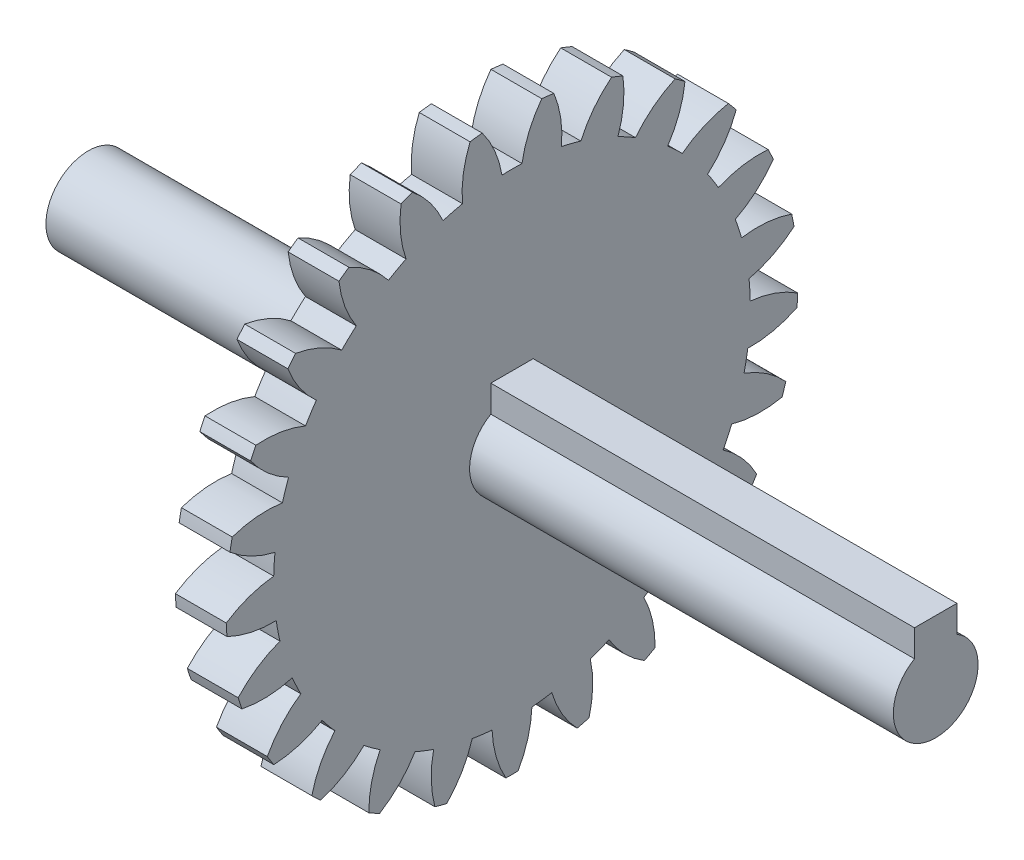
ISO-10303-21;
HEADER;
FILE_DESCRIPTION(('STEP AP214'),'2;1');
FILE_NAME('part.step','',(''),(''),'','','');
FILE_SCHEMA(('AUTOMOTIVE_DESIGN { 1 0 10303 214 1 1 1 1 }'));
ENDSEC;
DATA;
#1=APPLICATION_CONTEXT('core data for automotive mechanical design processes');
#2=APPLICATION_PROTOCOL_DEFINITION('international standard','automotive_design',2000,#1);
#3=PRODUCT_CONTEXT('',#1,'mechanical');
#4=PRODUCT('Part','Part','',(#3));
#5=PRODUCT_RELATED_PRODUCT_CATEGORY('part','',(#4));
#6=PRODUCT_DEFINITION_FORMATION('','',#4);
#7=PRODUCT_DEFINITION_CONTEXT('part definition',#1,'design');
#8=PRODUCT_DEFINITION('design','',#6,#7);
#9=PRODUCT_DEFINITION_SHAPE('','',#8);
#10=(LENGTH_UNIT() NAMED_UNIT(*) SI_UNIT(.MILLI.,.METRE.));
#11=(NAMED_UNIT(*) PLANE_ANGLE_UNIT() SI_UNIT($,.RADIAN.));
#12=(NAMED_UNIT(*) SI_UNIT($,.STERADIAN.) SOLID_ANGLE_UNIT());
#13=UNCERTAINTY_MEASURE_WITH_UNIT(LENGTH_MEASURE(1.E-05),#10,'distance_accuracy_value','');
#14=(GEOMETRIC_REPRESENTATION_CONTEXT(3) GLOBAL_UNCERTAINTY_ASSIGNED_CONTEXT((#13)) GLOBAL_UNIT_ASSIGNED_CONTEXT((#10,
#11,#12)) REPRESENTATION_CONTEXT('',''));
#15=CARTESIAN_POINT('',(0.,0.,0.));
#16=DIRECTION('',(0.,0.,1.));
#17=DIRECTION('',(1.,0.,0.));
#18=AXIS2_PLACEMENT_3D('',#15,#16,#17);
#19=CARTESIAN_POINT('',(12.,0.,0.));
#20=DIRECTION('',(-1.,0.,0.));
#21=DIRECTION('',(0.,0.,1.));
#22=AXIS2_PLACEMENT_3D('',#19,#20,#21);
#23=PLANE('',#22);
#24=CARTESIAN_POINT('',(12.,0.,0.));
#25=DIRECTION('',(1.,0.,0.));
#26=DIRECTION('',(0.,0.,-1.));
#27=AXIS2_PLACEMENT_3D('',#24,#25,#26);
#28=CIRCLE('',#27,10.);
#29=CARTESIAN_POINT('',(12.,8.66025403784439,5.));
#30=VERTEX_POINT('',#29);
#31=CARTESIAN_POINT('',(12.,8.66025403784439,-5.));
#32=VERTEX_POINT('',#31);
#33=EDGE_CURVE('E676',#30,#32,#28,.T.);
#34=ORIENTED_EDGE('',*,*,#33,.F.);
#35=DIRECTION('',(0.,-1.,0.));
#36=VECTOR('',#35,1.);
#37=CARTESIAN_POINT('',(12.0000000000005,0.,5.));
#38=LINE('',#37,#36);
#39=CARTESIAN_POINT('',(12.0000000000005,15.,5.));
#40=VERTEX_POINT('',#39);
#41=EDGE_CURVE('E1853',#40,#30,#38,.T.);
#42=ORIENTED_EDGE('',*,*,#41,.F.);
#43=DIRECTION('',(0.,0.,1.));
#44=VECTOR('',#43,1.);
#45=CARTESIAN_POINT('',(12.0000000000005,15.,-5.));
#46=LINE('',#45,#44);
#47=CARTESIAN_POINT('',(12.0000000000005,15.,-5.));
#48=VERTEX_POINT('',#47);
#49=EDGE_CURVE('E1854',#48,#40,#46,.T.);
#50=ORIENTED_EDGE('',*,*,#49,.F.);
#51=DIRECTION('',(0.,1.,0.));
#52=VECTOR('',#51,1.);
#53=CARTESIAN_POINT('',(12.0000000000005,0.,-5.));
#54=LINE('',#53,#52);
#55=EDGE_CURVE('E677',#32,#48,#54,.T.);
#56=ORIENTED_EDGE('',*,*,#55,.F.);
#57=EDGE_LOOP('',(#34,#42,#50,#56));
#58=FACE_BOUND('',#57,.T.);
#59=CARTESIAN_POINT('',(12.,43.7785616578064,-39.150263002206));
#60=DIRECTION('',(-1.,0.,0.));
#61=DIRECTION('',(0.,-0.248689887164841,-0.968583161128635));
#62=AXIS2_PLACEMENT_3D('',#59,#60,#61);
#63=CIRCLE('',#62,25.);
#64=CARTESIAN_POINT('',(12.,53.8455500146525,-16.2667373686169));
#65=VERTEX_POINT('',#64);
#66=CARTESIAN_POINT('',(12.,63.2761427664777,-23.5027606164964));
#67=VERTEX_POINT('',#66);
#68=EDGE_CURVE('E692',#65,#67,#63,.T.);
#69=ORIENTED_EDGE('',*,*,#68,.F.);
#70=CARTESIAN_POINT('',(12.,0.,0.));
#71=DIRECTION('',(-1.,0.,0.));
#72=DIRECTION('',(0.,-0.248689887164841,-0.968583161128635));
#73=AXIS2_PLACEMENT_3D('',#70,#71,#72);
#74=CIRCLE('',#73,56.249);
#75=CARTESIAN_POINT('',(12.,55.0217756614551,-11.6856409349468));
#76=VERTEX_POINT('',#75);
#77=EDGE_CURVE('E696',#76,#65,#74,.T.);
#78=ORIENTED_EDGE('',*,*,#77,.F.);
#79=CARTESIAN_POINT('',(12.,57.2242290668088,13.2171540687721));
#80=DIRECTION('',(-1.,0.,0.));
#81=DIRECTION('',(0.,-0.248689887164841,-0.968583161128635));
#82=AXIS2_PLACEMENT_3D('',#79,#80,#81);
#83=CIRCLE('',#82,25.);
#84=CARTESIAN_POINT('',(12.,66.7718478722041,-9.88788813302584));
#85=VERTEX_POINT('',#84);
#86=EDGE_CURVE('E694',#85,#76,#83,.T.);
#87=ORIENTED_EDGE('',*,*,#86,.F.);
#88=CARTESIAN_POINT('',(12.,0.,0.));
#89=DIRECTION('',(-1.,0.,0.));
#90=DIRECTION('',(0.,0.,1.));
#91=AXIS2_PLACEMENT_3D('',#88,#89,#90);
#92=CIRCLE('',#91,67.5);
#93=CARTESIAN_POINT('',(12.,67.1331052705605,-7.02824136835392));
#94=VERTEX_POINT('',#93);
#95=EDGE_CURVE('E1240',#94,#85,#92,.T.);
#96=ORIENTED_EDGE('',*,*,#95,.F.);
#97=CARTESIAN_POINT('',(12.,52.1394521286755,-27.0329999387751));
#98=DIRECTION('',(-1.,0.,0.));
#99=DIRECTION('',(0.,0.,-1.));
#100=AXIS2_PLACEMENT_3D('',#97,#98,#99);
#101=CIRCLE('',#100,25.);
#102=CARTESIAN_POINT('',(12.,56.1992661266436,-2.36484414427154));
#103=VERTEX_POINT('',#102);
#104=EDGE_CURVE('E1218',#103,#94,#101,.T.);
#105=ORIENTED_EDGE('',*,*,#104,.F.);
#106=CARTESIAN_POINT('',(12.,0.,0.));
#107=DIRECTION('',(-1.,0.,0.));
#108=DIRECTION('',(0.,0.,-1.));
#109=AXIS2_PLACEMENT_3D('',#106,#107,#108);
#110=CIRCLE('',#109,56.249);
#111=CARTESIAN_POINT('',(12.,56.1992661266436,2.36484414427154));
#112=VERTEX_POINT('',#111);
#113=EDGE_CURVE('E1222',#112,#103,#110,.T.);
#114=ORIENTED_EDGE('',*,*,#113,.F.);
#115=CARTESIAN_POINT('',(12.,52.1394521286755,27.0329999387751));
#116=DIRECTION('',(-1.,0.,0.));
#117=DIRECTION('',(0.,0.,-1.));
#118=AXIS2_PLACEMENT_3D('',#115,#116,#117);
#119=CIRCLE('',#118,25.);
#120=CARTESIAN_POINT('',(12.,67.1331052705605,7.02824136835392));
#121=VERTEX_POINT('',#120);
#122=EDGE_CURVE('E1220',#121,#112,#119,.T.);
#123=ORIENTED_EDGE('',*,*,#122,.F.);
#124=CARTESIAN_POINT('',(12.,66.771847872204,9.88788813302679));
#125=VERTEX_POINT('',#124);
#126=EDGE_CURVE('E1238',#125,#121,#92,.T.);
#127=ORIENTED_EDGE('',*,*,#126,.F.);
#128=CARTESIAN_POINT('',(12.,57.224229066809,-13.2171540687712));
#129=DIRECTION('',(-1.,0.,0.));
#130=DIRECTION('',(0.,0.248689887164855,-0.968583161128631));
#131=AXIS2_PLACEMENT_3D('',#128,#129,#130);
#132=CIRCLE('',#131,25.);
#133=CARTESIAN_POINT('',(12.,55.021775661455,11.6856409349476));
#134=VERTEX_POINT('',#133);
#135=EDGE_CURVE('E1196',#134,#125,#132,.T.);
#136=ORIENTED_EDGE('',*,*,#135,.F.);
#137=CARTESIAN_POINT('',(12.,0.,0.));
#138=DIRECTION('',(-1.,0.,0.));
#139=DIRECTION('',(0.,0.248689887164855,-0.968583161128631));
#140=AXIS2_PLACEMENT_3D('',#137,#138,#139);
#141=CIRCLE('',#140,56.249);
#142=CARTESIAN_POINT('',(12.,53.8455500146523,16.2667373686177));
#143=VERTEX_POINT('',#142);
#144=EDGE_CURVE('E1200',#143,#134,#141,.T.);
#145=ORIENTED_EDGE('',*,*,#144,.F.);
#146=CARTESIAN_POINT('',(12.,43.7785616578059,39.1502630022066));
#147=DIRECTION('',(-1.,0.,0.));
#148=DIRECTION('',(0.,0.248689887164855,-0.968583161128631));
#149=AXIS2_PLACEMENT_3D('',#146,#147,#148);
#150=CIRCLE('',#149,25.);
#151=CARTESIAN_POINT('',(12.,63.2761427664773,23.5027606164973));
#152=VERTEX_POINT('',#151);
#153=EDGE_CURVE('E1198',#152,#143,#150,.T.);
#154=ORIENTED_EDGE('',*,*,#153,.F.);
#155=CARTESIAN_POINT('',(12.,62.2150697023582,26.1827252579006));
#156=VERTEX_POINT('',#155);
#157=EDGE_CURVE('E1429',#156,#152,#92,.T.);
#158=ORIENTED_EDGE('',*,*,#157,.F.);
#159=CARTESIAN_POINT('',(12.,58.713397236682,1.42917420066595));
#160=DIRECTION('',(-1.,0.,0.));
#161=DIRECTION('',(0.,0.481753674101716,-0.876306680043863));
#162=AXIS2_PLACEMENT_3D('',#159,#160,#161);
#163=CIRCLE('',#162,25.);
#164=CARTESIAN_POINT('',(12.,50.3870646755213,25.0018742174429));
#165=VERTEX_POINT('',#164);
#166=EDGE_CURVE('E1174',#165,#156,#163,.T.);
#167=ORIENTED_EDGE('',*,*,#166,.F.);
#168=CARTESIAN_POINT('',(12.,0.,0.));
#169=DIRECTION('',(-1.,0.,0.));
#170=DIRECTION('',(0.,0.481753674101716,-0.876306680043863));
#171=AXIS2_PLACEMENT_3D('',#168,#169,#170);
#172=CIRCLE('',#171,56.249);
#173=CARTESIAN_POINT('',(12.,48.1085199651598,29.1465316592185));
#174=VERTEX_POINT('',#173);
#175=EDGE_CURVE('E1178',#174,#165,#172,.T.);
#176=ORIENTED_EDGE('',*,*,#175,.F.);
#177=CARTESIAN_POINT('',(12.,32.6669031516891,48.807571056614));
#178=DIRECTION('',(-1.,0.,0.));
#179=DIRECTION('',(0.,0.481753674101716,-0.876306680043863));
#180=AXIS2_PLACEMENT_3D('',#177,#178,#179);
#181=CIRCLE('',#180,25.);
#182=CARTESIAN_POINT('',(12.,55.4433074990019,38.500514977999));
#183=VERTEX_POINT('',#182);
#184=EDGE_CURVE('E1176',#183,#174,#181,.T.);
#185=ORIENTED_EDGE('',*,*,#184,.F.);
#186=CARTESIAN_POINT('',(12.,53.7490898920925,40.832405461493));
#187=VERTEX_POINT('',#186);
#188=EDGE_CURVE('E1424',#187,#183,#92,.T.);
#189=ORIENTED_EDGE('',*,*,#188,.F.);
#190=CARTESIAN_POINT('',(12.,56.5133867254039,15.9857021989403));
#191=DIRECTION('',(-1.,0.,0.));
#192=DIRECTION('',(0.,0.68454710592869,-0.72896862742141));
#193=AXIS2_PLACEMENT_3D('',#190,#191,#192);
#194=CIRCLE('',#193,25.);
#195=CARTESIAN_POINT('',(12.,42.5863491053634,36.7471477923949));
#196=VERTEX_POINT('',#195);
#197=EDGE_CURVE('E1152',#196,#187,#194,.T.);
#198=ORIENTED_EDGE('',*,*,#197,.F.);
#199=CARTESIAN_POINT('',(12.,0.,0.));
#200=DIRECTION('',(-1.,0.,0.));
#201=DIRECTION('',(0.,0.68454710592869,-0.72896862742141));
#202=AXIS2_PLACEMENT_3D('',#199,#200,#201);
#203=CIRCLE('',#202,56.249);
#204=CARTESIAN_POINT('',(12.,39.3486546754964,40.1949421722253));
#205=VERTEX_POINT('',#204);
#206=EDGE_CURVE('E1156',#205,#196,#203,.T.);
#207=ORIENTED_EDGE('',*,*,#206,.F.);
#208=CARTESIAN_POINT('',(12.,19.5026629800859,55.3981199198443));
#209=DIRECTION('',(-1.,0.,0.));
#210=DIRECTION('',(0.,0.68454710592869,-0.72896862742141));
#211=AXIS2_PLACEMENT_3D('',#208,#209,#210);
#212=CIRCLE('',#211,25.);
#213=CARTESIAN_POINT('',(12.,44.1267653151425,51.0791403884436));
#214=VERTEX_POINT('',#213);
#215=EDGE_CURVE('E1154',#214,#205,#212,.T.);
#216=ORIENTED_EDGE('',*,*,#215,.F.);
#217=CARTESIAN_POINT('',(12.,41.9058570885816,52.916435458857));
#218=VERTEX_POINT('',#217);
#219=EDGE_CURVE('E1419',#218,#214,#92,.T.);
#220=ORIENTED_EDGE('',*,*,#219,.F.);
#221=CARTESIAN_POINT('',(12.,50.7624322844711,29.5377897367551));
#222=DIRECTION('',(-1.,0.,0.));
#223=DIRECTION('',(0.,0.844327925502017,-0.535826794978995));
#224=AXIS2_PLACEMENT_3D('',#221,#222,#223);
#225=CIRCLE('',#224,25.);
#226=CARTESIAN_POINT('',(12.,32.1097765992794,46.1834629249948));
#227=VERTEX_POINT('',#226);
#228=EDGE_CURVE('E1130',#227,#218,#225,.T.);
#229=ORIENTED_EDGE('',*,*,#228,.F.);
#230=CARTESIAN_POINT('',(12.,0.,0.));
#231=DIRECTION('',(-1.,0.,0.));
#232=DIRECTION('',(0.,0.844327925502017,-0.535826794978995));
#233=AXIS2_PLACEMENT_3D('',#230,#231,#232);
#234=CIRCLE('',#233,56.249);
#235=CARTESIAN_POINT('',(12.,28.1163686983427,48.7177566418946));
#236=VERTEX_POINT('',#235);
#237=EDGE_CURVE('E1134',#236,#227,#234,.T.);
#238=ORIENTED_EDGE('',*,*,#237,.F.);
#239=CARTESIAN_POINT('',(12.,5.11299876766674,58.5078011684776));
#240=DIRECTION('',(-1.,0.,0.));
#241=DIRECTION('',(0.,0.844327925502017,-0.535826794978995));
#242=AXIS2_PLACEMENT_3D('',#239,#240,#241);
#243=CIRCLE('',#242,25.);
#244=CARTESIAN_POINT('',(12.,30.0375761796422,60.4482755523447));
#245=VERTEX_POINT('',#244);
#246=EDGE_CURVE('E1132',#245,#236,#243,.T.);
#247=ORIENTED_EDGE('',*,*,#246,.F.);
#248=CARTESIAN_POINT('',(12.,27.4295251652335,61.6755312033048));
#249=VERTEX_POINT('',#248);
#250=EDGE_CURVE('E1414',#249,#245,#92,.T.);
#251=ORIENTED_EDGE('',*,*,#250,.F.);
#252=CARTESIAN_POINT('',(12.,41.8218875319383,41.2339093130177));
#253=DIRECTION('',(-1.,0.,0.));
#254=DIRECTION('',(0.,0.951056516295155,-0.309016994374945));
#255=AXIS2_PLACEMENT_3D('',#252,#253,#254);
#256=CIRCLE('',#255,25.);
#257=CARTESIAN_POINT('',(12.,19.615628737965,52.7179012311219));
#258=VERTEX_POINT('',#257);
#259=EDGE_CURVE('E1108',#258,#249,#256,.T.);
#260=ORIENTED_EDGE('',*,*,#259,.F.);
#261=CARTESIAN_POINT('',(12.,0.,0.));
#262=DIRECTION('',(-1.,0.,0.));
#263=DIRECTION('',(0.,0.951056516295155,-0.309016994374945));
#264=AXIS2_PLACEMENT_3D('',#261,#262,#263);
#265=CIRCLE('',#264,56.249);
#266=CARTESIAN_POINT('',(12.,15.1174278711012,54.1794552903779));
#267=VERTEX_POINT('',#266);
#268=EDGE_CURVE('E1112',#267,#258,#265,.T.);
#269=ORIENTED_EDGE('',*,*,#268,.F.);
#270=CARTESIAN_POINT('',(12.,-9.59793396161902,57.9412220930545));
#271=DIRECTION('',(-1.,0.,0.));
#272=DIRECTION('',(0.,0.951056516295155,-0.309016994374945));
#273=AXIS2_PLACEMENT_3D('',#270,#271,#272);
#274=CIRCLE('',#273,25.);
#275=CARTESIAN_POINT('',(12.,14.0610156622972,66.0192232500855));
#276=VERTEX_POINT('',#275);
#277=EDGE_CURVE('E1110',#276,#267,#274,.T.);
#278=ORIENTED_EDGE('',*,*,#277,.F.);
#279=CARTESIAN_POINT('',(12.,11.2296952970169,66.559326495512));
#280=VERTEX_POINT('',#279);
#281=EDGE_CURVE('E1409',#280,#276,#92,.T.);
#282=ORIENTED_EDGE('',*,*,#281,.F.);
#283=CARTESIAN_POINT('',(12.,30.2535197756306,50.339150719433));
#284=DIRECTION('',(-1.,0.,0.));
#285=DIRECTION('',(0.,0.998026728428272,-0.06279051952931));
#286=AXIS2_PLACEMENT_3D('',#283,#284,#285);
#287=CIRCLE('',#286,25.);
#288=CARTESIAN_POINT('',(12.,5.88895878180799,55.9398799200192));
#289=VERTEX_POINT('',#288);
#290=EDGE_CURVE('E1086',#289,#280,#287,.T.);
#291=ORIENTED_EDGE('',*,*,#290,.F.);
#292=CARTESIAN_POINT('',(12.,0.,0.));
#293=DIRECTION('',(-1.,0.,0.));
#294=DIRECTION('',(0.,0.998026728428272,-0.06279051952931));
#295=AXIS2_PLACEMENT_3D('',#292,#293,#294);
#296=CIRCLE('',#295,56.249);
#297=CARTESIAN_POINT('',(12.,1.16860345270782,56.2368595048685));
#298=VERTEX_POINT('',#297);
#299=EDGE_CURVE('E1090',#298,#289,#296,.T.);
#300=ORIENTED_EDGE('',*,*,#299,.F.);
#301=CARTESIAN_POINT('',(12.,-23.7057932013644,53.733982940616));
#302=DIRECTION('',(-1.,0.,0.));
#303=DIRECTION('',(0.,0.998026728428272,-0.06279051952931));
#304=AXIS2_PLACEMENT_3D('',#301,#302,#303);
#305=CIRCLE('',#304,25.);
#306=CARTESIAN_POINT('',(12.,-2.79905018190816,67.4419403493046));
#307=VERTEX_POINT('',#306);
#308=EDGE_CURVE('E1088',#307,#298,#305,.T.);
#309=ORIENTED_EDGE('',*,*,#308,.F.);
#310=CARTESIAN_POINT('',(12.,-5.67573762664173,67.2609545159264));
#311=VERTEX_POINT('',#310);
#312=EDGE_CURVE('E1404',#311,#307,#92,.T.);
#313=ORIENTED_EDGE('',*,*,#312,.F.);
#314=CARTESIAN_POINT('',(12.,16.7842121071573,56.2813981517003));
#315=DIRECTION('',(-1.,0.,0.));
#316=DIRECTION('',(0.,0.982287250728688,0.187381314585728));
#317=AXIS2_PLACEMENT_3D('',#314,#315,#316);
#318=CIRCLE('',#317,25.);
#319=CARTESIAN_POINT('',(12.,-8.20773611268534,55.6469502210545));
#320=VERTEX_POINT('',#319);
#321=EDGE_CURVE('E1064',#320,#311,#318,.T.);
#322=ORIENTED_EDGE('',*,*,#321,.F.);
#323=CARTESIAN_POINT('',(12.,0.,0.));
#324=DIRECTION('',(-1.,0.,0.));
#325=DIRECTION('',(0.,0.982287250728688,0.187381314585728));
#326=AXIS2_PLACEMENT_3D('',#323,#324,#325);
#327=CIRCLE('',#326,56.249);
#328=CARTESIAN_POINT('',(12.,-12.853648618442,54.7606950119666));
#329=VERTEX_POINT('',#328);
#330=EDGE_CURVE('E1068',#329,#320,#327,.T.);
#331=ORIENTED_EDGE('',*,*,#330,.F.);
#332=CARTESIAN_POINT('',(12.,-36.3241302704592,46.1504400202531));
#333=DIRECTION('',(-1.,0.,0.));
#334=DIRECTION('',(0.,0.982287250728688,0.187381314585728));
#335=AXIS2_PLACEMENT_3D('',#332,#333,#334);
#336=CIRCLE('',#335,25.);
#337=CARTESIAN_POINT('',(12.,-19.4832414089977,64.6270323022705));
#338=VERTEX_POINT('',#337);
#339=EDGE_CURVE('E1066',#338,#329,#336,.T.);
#340=ORIENTED_EDGE('',*,*,#339,.F.);
#341=CARTESIAN_POINT('',(12.,-22.2245430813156,63.7363293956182));
#342=VERTEX_POINT('',#341);
#343=EDGE_CURVE('E1399',#342,#338,#92,.T.);
#344=ORIENTED_EDGE('',*,*,#343,.F.);
#345=CARTESIAN_POINT('',(12.,2.26029066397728,58.6872783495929));
#346=DIRECTION('',(-1.,0.,0.));
#347=DIRECTION('',(0.,0.904827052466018,0.425779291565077));
#348=AXIS2_PLACEMENT_3D('',#345,#346,#347);
#349=CIRCLE('',#348,25.);
#350=CARTESIAN_POINT('',(12.,-21.7887087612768,51.857517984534));
#351=VERTEX_POINT('',#350);
#352=EDGE_CURVE('E1042',#351,#342,#349,.T.);
#353=ORIENTED_EDGE('',*,*,#352,.F.);
#354=CARTESIAN_POINT('',(12.,0.,0.));
#355=DIRECTION('',(-1.,0.,0.));
#356=DIRECTION('',(0.,0.904827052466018,0.425779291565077));
#357=AXIS2_PLACEMENT_3D('',#354,#355,#356);
#358=CIRCLE('',#357,56.249);
#359=CARTESIAN_POINT('',(12.,-26.0682586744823,49.8437146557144));
#360=VERTEX_POINT('',#359);
#361=EDGE_CURVE('E1046',#360,#351,#358,.T.);
#362=ORIENTED_EDGE('',*,*,#361,.F.);
#363=CARTESIAN_POINT('',(12.,-46.6600886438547,35.6670952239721));
#364=DIRECTION('',(-1.,0.,0.));
#365=DIRECTION('',(0.,0.904827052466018,0.425779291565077));
#366=AXIS2_PLACEMENT_3D('',#363,#364,#365);
#367=CIRCLE('',#366,25.);
#368=CARTESIAN_POINT('',(12.,-34.9432289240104,57.751370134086));
#369=VERTEX_POINT('',#368);
#370=EDGE_CURVE('E1044',#369,#360,#367,.T.);
#371=ORIENTED_EDGE('',*,*,#370,.F.);
#372=CARTESIAN_POINT('',(12.,-37.3768987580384,56.2069162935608));
#373=VERTEX_POINT('',#372);
#374=EDGE_CURVE('E1394',#373,#369,#92,.T.);
#375=ORIENTED_EDGE('',*,*,#374,.F.);
#376=CARTESIAN_POINT('',(12.,-12.4056531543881,57.4056210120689));
#377=DIRECTION('',(-1.,0.,0.));
#378=DIRECTION('',(0.,0.770513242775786,0.637423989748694));
#379=AXIS2_PLACEMENT_3D('',#376,#377,#378);
#380=CIRCLE('',#379,25.);
#381=CARTESIAN_POINT('',(12.,-34.0006167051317,44.8096871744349));
#382=VERTEX_POINT('',#381);
#383=EDGE_CURVE('E1020',#382,#373,#380,.T.);
#384=ORIENTED_EDGE('',*,*,#383,.F.);
#385=CARTESIAN_POINT('',(12.,0.,0.));
#386=DIRECTION('',(-1.,0.,0.));
#387=DIRECTION('',(0.,0.770513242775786,0.637423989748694));
#388=AXIS2_PLACEMENT_3D('',#385,#386,#387);
#389=CIRCLE('',#388,56.249);
#390=CARTESIAN_POINT('',(12.,-37.6449041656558,41.7948703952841));
#391=VERTEX_POINT('',#390);
#392=EDGE_CURVE('E1024',#391,#382,#389,.T.);
#393=ORIENTED_EDGE('',*,*,#392,.F.);
#394=CARTESIAN_POINT('',(12.,-54.0642220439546,22.9426556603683));
#395=DIRECTION('',(-1.,0.,0.));
#396=DIRECTION('',(0.,0.770513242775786,0.637423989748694));
#397=AXIS2_PLACEMENT_3D('',#394,#395,#396);
#398=CIRCLE('',#397,25.);
#399=CARTESIAN_POINT('',(12.,-48.207604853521,47.2469769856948));
#400=VERTEX_POINT('',#399);
#401=EDGE_CURVE('E1022',#400,#391,#398,.T.);
#402=ORIENTED_EDGE('',*,*,#401,.F.);
#403=CARTESIAN_POINT('',(12.,-50.1807264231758,45.1458159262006));
#404=VERTEX_POINT('',#403);
#405=EDGE_CURVE('E1389',#404,#400,#92,.T.);
#406=ORIENTED_EDGE('',*,*,#405,.F.);
#407=CARTESIAN_POINT('',(12.,-26.2921041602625,52.5169573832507));
#408=DIRECTION('',(-1.,0.,0.));
#409=DIRECTION('',(0.,0.587785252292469,0.809016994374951));
#410=AXIS2_PLACEMENT_3D('',#407,#408,#409);
#411=CIRCLE('',#410,25.);
#412=CARTESIAN_POINT('',(12.,-44.0761408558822,34.9462989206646));
#413=VERTEX_POINT('',#412);
#414=EDGE_CURVE('E998',#413,#404,#411,.T.);
#415=ORIENTED_EDGE('',*,*,#414,.F.);
#416=CARTESIAN_POINT('',(12.,0.,0.));
#417=DIRECTION('',(-1.,0.,0.));
#418=DIRECTION('',(0.,0.587785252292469,0.809016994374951));
#419=AXIS2_PLACEMENT_3D('',#416,#417,#418);
#420=CIRCLE('',#419,56.249);
#421=CARTESIAN_POINT('',(12.,-46.8561818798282,31.119900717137));
#422=VERTEX_POINT('',#421);
#423=EDGE_CURVE('E1002',#422,#413,#420,.T.);
#424=ORIENTED_EDGE('',*,*,#423,.F.);
#425=CARTESIAN_POINT('',(12.,-58.0713015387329,8.7766446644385));
#426=DIRECTION('',(-1.,0.,0.));
#427=DIRECTION('',(0.,0.587785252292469,0.809016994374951));
#428=AXIS2_PLACEMENT_3D('',#425,#426,#427);
#429=CIRCLE('',#428,25.);
#430=CARTESIAN_POINT('',(12.,-58.4429196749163,33.7738825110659));
#431=VERTEX_POINT('',#430);
#432=EDGE_CURVE('E1000',#431,#422,#429,.T.);
#433=ORIENTED_EDGE('',*,*,#432,.F.);
#434=CARTESIAN_POINT('',(12.,-59.8315144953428,31.2480379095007));
#435=VERTEX_POINT('',#434);
#436=EDGE_CURVE('E1384',#435,#431,#92,.T.);
#437=ORIENTED_EDGE('',*,*,#436,.F.);
#438=CARTESIAN_POINT('',(12.,-38.5265255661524,44.3284601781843));
#439=DIRECTION('',(-1.,0.,0.));
#440=DIRECTION('',(0.,0.368124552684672,0.929776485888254));
#441=AXIS2_PLACEMENT_3D('',#438,#439,#440);
#442=CIRCLE('',#441,25.);
#443=CARTESIAN_POINT('',(12.,-51.3821989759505,22.8871061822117));
#444=VERTEX_POINT('',#443);
#445=EDGE_CURVE('E976',#444,#435,#442,.T.);
#446=ORIENTED_EDGE('',*,*,#445,.F.);
#447=CARTESIAN_POINT('',(12.,0.,0.));
#448=DIRECTION('',(-1.,0.,0.));
#449=DIRECTION('',(0.,0.368124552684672,0.929776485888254));
#450=AXIS2_PLACEMENT_3D('',#447,#448,#449);
#451=CIRCLE('',#450,56.249);
#452=CARTESIAN_POINT('',(12.,-53.1233133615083,18.4895532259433));
#453=VERTEX_POINT('',#452);
#454=EDGE_CURVE('E980',#453,#444,#451,.T.);
#455=ORIENTED_EDGE('',*,*,#454,.F.);
#456=CARTESIAN_POINT('',(12.,-58.4295475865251,-5.94083519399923));
#457=DIRECTION('',(-1.,0.,0.));
#458=DIRECTION('',(0.,0.368124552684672,0.929776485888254));
#459=AXIS2_PLACEMENT_3D('',#456,#457,#458);
#460=CIRCLE('',#459,25.);
#461=CARTESIAN_POINT('',(12.,-65.0060509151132,18.1786507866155));
#462=VERTEX_POINT('',#461);
#463=EDGE_CURVE('E978',#462,#453,#460,.T.);
#464=ORIENTED_EDGE('',*,*,#463,.F.);
#465=CARTESIAN_POINT('',(12.,-65.7228684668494,15.3868307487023));
#466=VERTEX_POINT('',#465);
#467=EDGE_CURVE('E1379',#466,#462,#92,.T.);
#468=ORIENTED_EDGE('',*,*,#467,.F.);
#469=CARTESIAN_POINT('',(12.,-48.3401836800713,33.35464279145));
#470=DIRECTION('',(-1.,0.,0.));
#471=DIRECTION('',(0.,0.125333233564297,0.992114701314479));
#472=AXIS2_PLACEMENT_3D('',#469,#470,#471);
#473=CIRCLE('',#472,25.);
#474=CARTESIAN_POINT('',(12.,-55.4597245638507,9.38983238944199));
#475=VERTEX_POINT('',#474);
#476=EDGE_CURVE('E954',#475,#466,#473,.T.);
#477=ORIENTED_EDGE('',*,*,#476,.F.);
#478=CARTESIAN_POINT('',(12.,0.,0.));
#479=DIRECTION('',(-1.,0.,0.));
#480=DIRECTION('',(0.,0.125333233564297,0.992114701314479));
#481=AXIS2_PLACEMENT_3D('',#478,#479,#480);
#482=CIRCLE('',#481,56.249);
#483=CARTESIAN_POINT('',(12.,-56.052511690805,4.69743910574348));
#484=VERTEX_POINT('',#483);
#485=EDGE_CURVE('E958',#484,#475,#482,.T.);
#486=ORIENTED_EDGE('',*,*,#485,.F.);
#487=CARTESIAN_POINT('',(12.,-55.1164502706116,-20.2850305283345));
#488=DIRECTION('',(-1.,0.,0.));
#489=DIRECTION('',(0.,0.125333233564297,0.992114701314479));
#490=AXIS2_PLACEMENT_3D('',#487,#488,#489);
#491=CIRCLE('',#490,25.);
#492=CARTESIAN_POINT('',(12.,-67.4846129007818,1.44118757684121));
#493=VERTEX_POINT('',#492);
#494=EDGE_CURVE('E956',#493,#484,#491,.T.);
#495=ORIENTED_EDGE('',*,*,#494,.F.);
#496=CARTESIAN_POINT('',(12.,-67.4846129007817,-1.44118757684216));
#497=VERTEX_POINT('',#496);
#498=EDGE_CURVE('E1374',#497,#493,#92,.T.);
#499=ORIENTED_EDGE('',*,*,#498,.F.);
#500=CARTESIAN_POINT('',(12.,-55.1164502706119,20.2850305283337));
#501=DIRECTION('',(-1.,0.,0.));
#502=DIRECTION('',(0.,-0.125333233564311,0.992114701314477));
#503=AXIS2_PLACEMENT_3D('',#500,#501,#502);
#504=CIRCLE('',#503,25.);
#505=CARTESIAN_POINT('',(12.,-56.052511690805,-4.69743910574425));
#506=VERTEX_POINT('',#505);
#507=EDGE_CURVE('E932',#506,#497,#504,.T.);
#508=ORIENTED_EDGE('',*,*,#507,.F.);
#509=CARTESIAN_POINT('',(12.,0.,0.));
#510=DIRECTION('',(-1.,0.,0.));
#511=DIRECTION('',(0.,-0.125333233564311,0.992114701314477));
#512=AXIS2_PLACEMENT_3D('',#509,#510,#511);
#513=CIRCLE('',#512,56.249);
#514=CARTESIAN_POINT('',(12.,-55.4597245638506,-9.38983238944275));
#515=VERTEX_POINT('',#514);
#516=EDGE_CURVE('E936',#515,#506,#513,.T.);
#517=ORIENTED_EDGE('',*,*,#516,.F.);
#518=CARTESIAN_POINT('',(12.,-48.3401836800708,-33.3546427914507));
#519=DIRECTION('',(-1.,0.,0.));
#520=DIRECTION('',(0.,-0.125333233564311,0.992114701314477));
#521=AXIS2_PLACEMENT_3D('',#518,#519,#520);
#522=CIRCLE('',#521,25.);
#523=CARTESIAN_POINT('',(12.,-65.7228684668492,-15.3868307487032));
#524=VERTEX_POINT('',#523);
#525=EDGE_CURVE('E934',#524,#515,#522,.T.);
#526=ORIENTED_EDGE('',*,*,#525,.F.);
#527=CARTESIAN_POINT('',(12.,-65.0060509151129,-18.1786507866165));
#528=VERTEX_POINT('',#527);
#529=EDGE_CURVE('E1369',#528,#524,#92,.T.);
#530=ORIENTED_EDGE('',*,*,#529,.F.);
#531=CARTESIAN_POINT('',(12.,-58.4295475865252,5.94083519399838));
#532=DIRECTION('',(-1.,0.,0.));
#533=DIRECTION('',(0.,-0.368124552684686,0.929776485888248));
#534=AXIS2_PLACEMENT_3D('',#531,#532,#533);
#535=CIRCLE('',#534,25.);
#536=CARTESIAN_POINT('',(12.,-53.1233133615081,-18.4895532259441));
#537=VERTEX_POINT('',#536);
#538=EDGE_CURVE('E910',#537,#528,#535,.T.);
#539=ORIENTED_EDGE('',*,*,#538,.F.);
#540=CARTESIAN_POINT('',(12.,0.,0.));
#541=DIRECTION('',(-1.,0.,0.));
#542=DIRECTION('',(0.,-0.368124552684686,0.929776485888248));
#543=AXIS2_PLACEMENT_3D('',#540,#541,#542);
#544=CIRCLE('',#543,56.249);
#545=CARTESIAN_POINT('',(12.,-51.3821989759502,-22.8871061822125));
#546=VERTEX_POINT('',#545);
#547=EDGE_CURVE('E914',#546,#537,#544,.T.);
#548=ORIENTED_EDGE('',*,*,#547,.F.);
#549=CARTESIAN_POINT('',(12.,-38.5265255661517,-44.3284601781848));
#550=DIRECTION('',(-1.,0.,0.));
#551=DIRECTION('',(0.,-0.368124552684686,0.929776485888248));
#552=AXIS2_PLACEMENT_3D('',#549,#550,#551);
#553=CIRCLE('',#552,25.);
#554=CARTESIAN_POINT('',(12.,-59.8315144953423,-31.2480379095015));
#555=VERTEX_POINT('',#554);
#556=EDGE_CURVE('E912',#555,#546,#553,.T.);
#557=ORIENTED_EDGE('',*,*,#556,.F.);
#558=CARTESIAN_POINT('',(12.,-58.4429196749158,-33.7738825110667));
#559=VERTEX_POINT('',#558);
#560=EDGE_CURVE('E1364',#559,#555,#92,.T.);
#561=ORIENTED_EDGE('',*,*,#560,.F.);
#562=CARTESIAN_POINT('',(12.,-58.0713015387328,-8.77664466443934));
#563=DIRECTION('',(-1.,0.,0.));
#564=DIRECTION('',(0.,-0.58778525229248,0.809016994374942));
#565=AXIS2_PLACEMENT_3D('',#562,#563,#564);
#566=CIRCLE('',#565,25.);
#567=CARTESIAN_POINT('',(12.,-46.8561818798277,-31.1199007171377));
#568=VERTEX_POINT('',#567);
#569=EDGE_CURVE('E888',#568,#559,#566,.T.);
#570=ORIENTED_EDGE('',*,*,#569,.F.);
#571=CARTESIAN_POINT('',(12.,0.,0.));
#572=DIRECTION('',(-1.,0.,0.));
#573=DIRECTION('',(0.,-0.58778525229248,0.809016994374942));
#574=AXIS2_PLACEMENT_3D('',#571,#572,#573);
#575=CIRCLE('',#574,56.249);
#576=CARTESIAN_POINT('',(12.,-44.0761408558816,-34.9462989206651));
#577=VERTEX_POINT('',#576);
#578=EDGE_CURVE('E892',#577,#568,#575,.T.);
#579=ORIENTED_EDGE('',*,*,#578,.F.);
#580=CARTESIAN_POINT('',(12.,-26.2921041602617,-52.5169573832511));
#581=DIRECTION('',(-1.,0.,0.));
#582=DIRECTION('',(0.,-0.58778525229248,0.809016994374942));
#583=AXIS2_PLACEMENT_3D('',#580,#581,#582);
#584=CIRCLE('',#583,25.);
#585=CARTESIAN_POINT('',(12.,-50.1807264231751,-45.1458159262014));
#586=VERTEX_POINT('',#585);
#587=EDGE_CURVE('E890',#586,#577,#584,.T.);
#588=ORIENTED_EDGE('',*,*,#587,.F.);
#589=CARTESIAN_POINT('',(12.,-48.2076048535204,-47.2469769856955));
#590=VERTEX_POINT('',#589);
#591=EDGE_CURVE('E1359',#590,#586,#92,.T.);
#592=ORIENTED_EDGE('',*,*,#591,.F.);
#593=CARTESIAN_POINT('',(12.,-54.0642220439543,-22.9426556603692));
#594=DIRECTION('',(-1.,0.,0.));
#595=DIRECTION('',(0.,-0.770513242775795,0.637423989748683));
#596=AXIS2_PLACEMENT_3D('',#593,#594,#595);
#597=CIRCLE('',#596,25.);
#598=CARTESIAN_POINT('',(12.,-37.6449041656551,-41.7948703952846));
#599=VERTEX_POINT('',#598);
#600=EDGE_CURVE('E866',#599,#590,#597,.T.);
#601=ORIENTED_EDGE('',*,*,#600,.F.);
#602=CARTESIAN_POINT('',(12.,0.,0.));
#603=DIRECTION('',(-1.,0.,0.));
#604=DIRECTION('',(0.,-0.770513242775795,0.637423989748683));
#605=AXIS2_PLACEMENT_3D('',#602,#603,#604);
#606=CIRCLE('',#605,56.249);
#607=CARTESIAN_POINT('',(12.,-34.0006167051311,-44.8096871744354));
#608=VERTEX_POINT('',#607);
#609=EDGE_CURVE('E870',#608,#599,#606,.T.);
#610=ORIENTED_EDGE('',*,*,#609,.F.);
#611=CARTESIAN_POINT('',(12.,-12.4056531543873,-57.4056210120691));
#612=DIRECTION('',(-1.,0.,0.));
#613=DIRECTION('',(0.,-0.770513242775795,0.637423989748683));
#614=AXIS2_PLACEMENT_3D('',#611,#612,#613);
#615=CIRCLE('',#614,25.);
#616=CARTESIAN_POINT('',(12.,-37.3768987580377,-56.2069162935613));
#617=VERTEX_POINT('',#616);
#618=EDGE_CURVE('E868',#617,#608,#615,.T.);
#619=ORIENTED_EDGE('',*,*,#618,.F.);
#620=CARTESIAN_POINT('',(12.,-34.9432289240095,-57.7513701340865));
#621=VERTEX_POINT('',#620);
#622=EDGE_CURVE('E1354',#621,#617,#92,.T.);
#623=ORIENTED_EDGE('',*,*,#622,.F.);
#624=CARTESIAN_POINT('',(12.,-46.6600886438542,-35.6670952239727));
#625=DIRECTION('',(-1.,0.,0.));
#626=DIRECTION('',(0.,-0.904827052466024,0.425779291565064));
#627=AXIS2_PLACEMENT_3D('',#624,#625,#626);
#628=CIRCLE('',#627,25.);
#629=CARTESIAN_POINT('',(12.,-26.0682586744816,-49.8437146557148));
#630=VERTEX_POINT('',#629);
#631=EDGE_CURVE('E844',#630,#621,#628,.T.);
#632=ORIENTED_EDGE('',*,*,#631,.F.);
#633=CARTESIAN_POINT('',(12.,0.,0.));
#634=DIRECTION('',(-1.,0.,0.));
#635=DIRECTION('',(0.,-0.904827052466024,0.425779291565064));
#636=AXIS2_PLACEMENT_3D('',#633,#634,#635);
#637=CIRCLE('',#636,56.249);
#638=CARTESIAN_POINT('',(12.,-21.788708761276,-51.8575179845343));
#639=VERTEX_POINT('',#638);
#640=EDGE_CURVE('E848',#639,#630,#637,.T.);
#641=ORIENTED_EDGE('',*,*,#640,.F.);
#642=CARTESIAN_POINT('',(12.,2.2602906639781,-58.6872783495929));
#643=DIRECTION('',(-1.,0.,0.));
#644=DIRECTION('',(0.,-0.904827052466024,0.425779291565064));
#645=AXIS2_PLACEMENT_3D('',#642,#643,#644);
#646=CIRCLE('',#645,25.);
#647=CARTESIAN_POINT('',(12.,-22.2245430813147,-63.7363293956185));
#648=VERTEX_POINT('',#647);
#649=EDGE_CURVE('E846',#648,#639,#646,.T.);
#650=ORIENTED_EDGE('',*,*,#649,.F.);
#651=CARTESIAN_POINT('',(12.,-19.4832414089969,-64.6270323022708));
#652=VERTEX_POINT('',#651);
#653=EDGE_CURVE('E1349',#652,#648,#92,.T.);
#654=ORIENTED_EDGE('',*,*,#653,.F.);
#655=CARTESIAN_POINT('',(12.,-36.3241302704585,-46.1504400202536));
#656=DIRECTION('',(-1.,0.,0.));
#657=DIRECTION('',(0.,-0.982287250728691,0.187381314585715));
#658=AXIS2_PLACEMENT_3D('',#655,#656,#657);
#659=CIRCLE('',#658,25.);
#660=CARTESIAN_POINT('',(12.,-12.8536486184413,-54.7606950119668));
#661=VERTEX_POINT('',#660);
#662=EDGE_CURVE('E822',#661,#652,#659,.T.);
#663=ORIENTED_EDGE('',*,*,#662,.F.);
#664=CARTESIAN_POINT('',(12.,0.,0.));
#665=DIRECTION('',(-1.,0.,0.));
#666=DIRECTION('',(0.,-0.982287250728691,0.187381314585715));
#667=AXIS2_PLACEMENT_3D('',#664,#665,#666);
#668=CIRCLE('',#667,56.249);
#669=CARTESIAN_POINT('',(12.,-8.20773611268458,-55.6469502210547));
#670=VERTEX_POINT('',#669);
#671=EDGE_CURVE('E826',#670,#661,#668,.T.);
#672=ORIENTED_EDGE('',*,*,#671,.F.);
#673=CARTESIAN_POINT('',(12.,16.7842121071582,-56.2813981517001));
#674=DIRECTION('',(-1.,0.,0.));
#675=DIRECTION('',(0.,-0.982287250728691,0.187381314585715));
#676=AXIS2_PLACEMENT_3D('',#673,#674,#675);
#677=CIRCLE('',#676,25.);
#678=CARTESIAN_POINT('',(12.,-5.6757376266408,-67.2609545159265));
#679=VERTEX_POINT('',#678);
#680=EDGE_CURVE('E824',#679,#670,#677,.T.);
#681=ORIENTED_EDGE('',*,*,#680,.F.);
#682=CARTESIAN_POINT('',(12.,-2.79905018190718,-67.4419403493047));
#683=VERTEX_POINT('',#682);
#684=EDGE_CURVE('E1344',#683,#679,#92,.T.);
#685=ORIENTED_EDGE('',*,*,#684,.F.);
#686=CARTESIAN_POINT('',(12.,-23.7057932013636,-53.7339829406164));
#687=DIRECTION('',(-1.,0.,0.));
#688=DIRECTION('',(0.,-0.998026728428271,-0.0627905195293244));
#689=AXIS2_PLACEMENT_3D('',#686,#687,#688);
#690=CIRCLE('',#689,25.);
#691=CARTESIAN_POINT('',(12.,1.16860345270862,-56.2368595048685));
#692=VERTEX_POINT('',#691);
#693=EDGE_CURVE('E800',#692,#683,#690,.T.);
#694=ORIENTED_EDGE('',*,*,#693,.F.);
#695=CARTESIAN_POINT('',(12.,0.,0.));
#696=DIRECTION('',(-1.,0.,0.));
#697=DIRECTION('',(0.,-0.998026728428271,-0.0627905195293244));
#698=AXIS2_PLACEMENT_3D('',#695,#696,#697);
#699=CIRCLE('',#698,56.249);
#700=CARTESIAN_POINT('',(12.,5.88895878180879,-55.9398799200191));
#701=VERTEX_POINT('',#700);
#702=EDGE_CURVE('E804',#701,#692,#699,.T.);
#703=ORIENTED_EDGE('',*,*,#702,.F.);
#704=CARTESIAN_POINT('',(12.,30.2535197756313,-50.3391507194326));
#705=DIRECTION('',(-1.,0.,0.));
#706=DIRECTION('',(0.,-0.998026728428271,-0.0627905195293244));
#707=AXIS2_PLACEMENT_3D('',#704,#705,#706);
#708=CIRCLE('',#707,25.);
#709=CARTESIAN_POINT('',(12.,11.2296952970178,-66.5593264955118));
#710=VERTEX_POINT('',#709);
#711=EDGE_CURVE('E802',#710,#701,#708,.T.);
#712=ORIENTED_EDGE('',*,*,#711,.F.);
#713=CARTESIAN_POINT('',(12.,14.0610156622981,-66.0192232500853));
#714=VERTEX_POINT('',#713);
#715=EDGE_CURVE('E1339',#714,#710,#92,.T.);
#716=ORIENTED_EDGE('',*,*,#715,.F.);
#717=CARTESIAN_POINT('',(12.,-9.5979339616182,-57.9412220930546));
#718=DIRECTION('',(-1.,0.,0.));
#719=DIRECTION('',(0.,-0.95105651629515,-0.309016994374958));
#720=AXIS2_PLACEMENT_3D('',#717,#718,#719);
#721=CIRCLE('',#720,25.);
#722=CARTESIAN_POINT('',(12.,15.1174278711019,-54.1794552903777));
#723=VERTEX_POINT('',#722);
#724=EDGE_CURVE('E778',#723,#714,#721,.T.);
#725=ORIENTED_EDGE('',*,*,#724,.F.);
#726=CARTESIAN_POINT('',(12.,0.,0.));
#727=DIRECTION('',(-1.,0.,0.));
#728=DIRECTION('',(0.,-0.95105651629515,-0.309016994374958));
#729=AXIS2_PLACEMENT_3D('',#726,#727,#728);
#730=CIRCLE('',#729,56.249);
#731=CARTESIAN_POINT('',(12.,19.6156287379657,-52.7179012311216));
#732=VERTEX_POINT('',#731);
#733=EDGE_CURVE('E782',#732,#723,#730,.T.);
#734=ORIENTED_EDGE('',*,*,#733,.F.);
#735=CARTESIAN_POINT('',(12.,41.8218875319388,-41.2339093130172));
#736=DIRECTION('',(-1.,0.,0.));
#737=DIRECTION('',(0.,-0.95105651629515,-0.309016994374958));
#738=AXIS2_PLACEMENT_3D('',#735,#736,#737);
#739=CIRCLE('',#738,25.);
#740=CARTESIAN_POINT('',(12.,27.4295251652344,-61.6755312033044));
#741=VERTEX_POINT('',#740);
#742=EDGE_CURVE('E780',#741,#732,#739,.T.);
#743=ORIENTED_EDGE('',*,*,#742,.F.);
#744=CARTESIAN_POINT('',(12.,30.037576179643,-60.4482755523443));
#745=VERTEX_POINT('',#744);
#746=EDGE_CURVE('E1334',#745,#741,#92,.T.);
#747=ORIENTED_EDGE('',*,*,#746,.F.);
#748=CARTESIAN_POINT('',(12.,5.11299876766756,-58.5078011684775));
#749=DIRECTION('',(-1.,0.,0.));
#750=DIRECTION('',(0.,-0.844327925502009,-0.535826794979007));
#751=AXIS2_PLACEMENT_3D('',#748,#749,#750);
#752=CIRCLE('',#751,25.);
#753=CARTESIAN_POINT('',(12.,28.1163686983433,-48.7177566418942));
#754=VERTEX_POINT('',#753);
#755=EDGE_CURVE('E756',#754,#745,#752,.T.);
#756=ORIENTED_EDGE('',*,*,#755,.F.);
#757=CARTESIAN_POINT('',(12.,0.,0.));
#758=DIRECTION('',(-1.,0.,0.));
#759=DIRECTION('',(0.,-0.844327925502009,-0.535826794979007));
#760=AXIS2_PLACEMENT_3D('',#757,#758,#759);
#761=CIRCLE('',#760,56.249);
#762=CARTESIAN_POINT('',(12.,32.10977659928,-46.1834629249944));
#763=VERTEX_POINT('',#762);
#764=EDGE_CURVE('E760',#763,#754,#761,.T.);
#765=ORIENTED_EDGE('',*,*,#764,.F.);
#766=CARTESIAN_POINT('',(12.,50.7624322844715,-29.5377897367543));
#767=DIRECTION('',(-1.,0.,0.));
#768=DIRECTION('',(0.,-0.844327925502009,-0.535826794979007));
#769=AXIS2_PLACEMENT_3D('',#766,#767,#768);
#770=CIRCLE('',#769,25.);
#771=CARTESIAN_POINT('',(12.,41.9058570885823,-52.9164354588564));
#772=VERTEX_POINT('',#771);
#773=EDGE_CURVE('E758',#772,#763,#770,.T.);
#774=ORIENTED_EDGE('',*,*,#773,.F.);
#775=CARTESIAN_POINT('',(12.,44.1267653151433,-51.079140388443));
#776=VERTEX_POINT('',#775);
#777=EDGE_CURVE('E1329',#776,#772,#92,.T.);
#778=ORIENTED_EDGE('',*,*,#777,.F.);
#779=CARTESIAN_POINT('',(12.,19.5026629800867,-55.398119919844));
#780=DIRECTION('',(-1.,0.,0.));
#781=DIRECTION('',(0.,-0.684547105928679,-0.72896862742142));
#782=AXIS2_PLACEMENT_3D('',#779,#780,#781);
#783=CIRCLE('',#782,25.);
#784=CARTESIAN_POINT('',(12.,39.348654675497,-40.1949421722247));
#785=VERTEX_POINT('',#784);
#786=EDGE_CURVE('E734',#785,#776,#783,.T.);
#787=ORIENTED_EDGE('',*,*,#786,.F.);
#788=CARTESIAN_POINT('',(12.,0.,0.));
#789=DIRECTION('',(-1.,0.,0.));
#790=DIRECTION('',(0.,-0.684547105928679,-0.72896862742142));
#791=AXIS2_PLACEMENT_3D('',#788,#789,#790);
#792=CIRCLE('',#791,56.249);
#793=CARTESIAN_POINT('',(12.,42.586349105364,-36.7471477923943));
#794=VERTEX_POINT('',#793);
#795=EDGE_CURVE('E738',#794,#785,#792,.T.);
#796=ORIENTED_EDGE('',*,*,#795,.F.);
#797=CARTESIAN_POINT('',(12.,56.5133867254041,-15.9857021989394));
#798=DIRECTION('',(-1.,0.,0.));
#799=DIRECTION('',(0.,-0.684547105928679,-0.72896862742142));
#800=AXIS2_PLACEMENT_3D('',#797,#798,#799);
#801=CIRCLE('',#800,25.);
#802=CARTESIAN_POINT('',(12.,53.7490898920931,-40.8324054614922));
#803=VERTEX_POINT('',#802);
#804=EDGE_CURVE('E736',#803,#794,#801,.T.);
#805=ORIENTED_EDGE('',*,*,#804,.F.);
#806=CARTESIAN_POINT('',(12.,55.4433074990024,-38.5005149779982));
#807=VERTEX_POINT('',#806);
#808=EDGE_CURVE('E1328',#807,#803,#92,.T.);
#809=ORIENTED_EDGE('',*,*,#808,.F.);
#810=CARTESIAN_POINT('',(12.,32.6669031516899,-48.8075710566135));
#811=DIRECTION('',(-1.,0.,0.));
#812=DIRECTION('',(0.,-0.481753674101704,-0.87630668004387));
#813=AXIS2_PLACEMENT_3D('',#810,#811,#812);
#814=CIRCLE('',#813,25.);
#815=CARTESIAN_POINT('',(12.,48.1085199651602,-29.1465316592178));
#816=VERTEX_POINT('',#815);
#817=EDGE_CURVE('E712',#816,#807,#814,.T.);
#818=ORIENTED_EDGE('',*,*,#817,.F.);
#819=CARTESIAN_POINT('',(12.,0.,0.));
#820=DIRECTION('',(-1.,0.,0.));
#821=DIRECTION('',(0.,-0.481753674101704,-0.87630668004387));
#822=AXIS2_PLACEMENT_3D('',#819,#820,#821);
#823=CIRCLE('',#822,56.249);
#824=CARTESIAN_POINT('',(12.,50.3870646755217,-25.0018742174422));
#825=VERTEX_POINT('',#824);
#826=EDGE_CURVE('E716',#825,#816,#823,.T.);
#827=ORIENTED_EDGE('',*,*,#826,.F.);
#828=CARTESIAN_POINT('',(12.,58.713397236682,-1.42917420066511));
#829=DIRECTION('',(-1.,0.,0.));
#830=DIRECTION('',(0.,-0.481753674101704,-0.87630668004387));
#831=AXIS2_PLACEMENT_3D('',#828,#829,#830);
#832=CIRCLE('',#831,25.);
#833=CARTESIAN_POINT('',(12.,62.2150697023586,-26.1827252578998));
#834=VERTEX_POINT('',#833);
#835=EDGE_CURVE('E714',#834,#825,#832,.T.);
#836=ORIENTED_EDGE('',*,*,#835,.F.);
#837=EDGE_CURVE('E1244',#67,#834,#92,.T.);
#838=ORIENTED_EDGE('',*,*,#837,.F.);
#839=EDGE_LOOP('',(#69,#78,#87,#96,#105,#114,#123,#127,#136,#145,#154,#158,#167,#176,#185,#189,
#198,#207,#216,#220,#229,#238,#247,#251,#260,#269,#278,#282,#291,#300,#309,#313,#322,#331,#340,
#344,#353,#362,#371,#375,#384,#393,#402,#406,#415,#424,#433,#437,#446,#455,#464,#468,#477,#486,
#495,#499,#508,#517,#526,#530,#539,#548,#557,#561,#570,#579,#588,#592,#601,#610,#619,#623,#632,
#641,#650,#654,#663,#672,#681,#685,#694,#703,#712,#716,#725,#734,#743,#747,#756,#765,#774,#778,
#787,#796,#805,#809,#818,#827,#836,#838));
#840=FACE_BOUND('',#839,.T.);
#841=ADVANCED_FACE('F17',(#58,#840),#23,.F.);
#842=CARTESIAN_POINT('',(0.,0.,0.));
#843=DIRECTION('',(1.,0.,0.));
#844=DIRECTION('',(0.,0.,-1.));
#845=AXIS2_PLACEMENT_3D('',#842,#843,#844);
#846=PLANE('',#845);
#847=CARTESIAN_POINT('',(0.,0.,0.));
#848=DIRECTION('',(1.,0.,0.));
#849=DIRECTION('',(0.,0.,-1.));
#850=AXIS2_PLACEMENT_3D('',#847,#848,#849);
#851=CIRCLE('',#850,10.);
#852=CARTESIAN_POINT('',(0.,0.,-10.));
#853=VERTEX_POINT('',#852);
#854=EDGE_CURVE('E680',#853,#853,#851,.F.);
#855=ORIENTED_EDGE('',*,*,#854,.F.);
#856=EDGE_LOOP('',(#855));
#857=FACE_BOUND('',#856,.T.);
#858=CARTESIAN_POINT('',(0.,43.7785616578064,-39.150263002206));
#859=DIRECTION('',(-1.,0.,0.));
#860=DIRECTION('',(0.,-0.248689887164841,-0.968583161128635));
#861=AXIS2_PLACEMENT_3D('',#858,#859,#860);
#862=CIRCLE('',#861,25.);
#863=CARTESIAN_POINT('',(0.,53.8455500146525,-16.2667373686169));
#864=VERTEX_POINT('',#863);
#865=CARTESIAN_POINT('',(0.,63.2761427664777,-23.5027606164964));
#866=VERTEX_POINT('',#865);
#867=EDGE_CURVE('E39',#864,#866,#862,.T.);
#868=ORIENTED_EDGE('',*,*,#867,.T.);
#869=CARTESIAN_POINT('',(0.,0.,0.));
#870=DIRECTION('',(-1.,0.,0.));
#871=DIRECTION('',(0.,0.,1.));
#872=AXIS2_PLACEMENT_3D('',#869,#870,#871);
#873=CIRCLE('',#872,67.5);
#874=CARTESIAN_POINT('',(0.,62.2150697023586,-26.1827252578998));
#875=VERTEX_POINT('',#874);
#876=EDGE_CURVE('E1239',#866,#875,#873,.T.);
#877=ORIENTED_EDGE('',*,*,#876,.T.);
#878=CARTESIAN_POINT('',(0.,58.713397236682,-1.42917420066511));
#879=DIRECTION('',(1.,0.,0.));
#880=DIRECTION('',(0.,0.,-1.));
#881=AXIS2_PLACEMENT_3D('',#878,#879,#880);
#882=CIRCLE('',#881,25.);
#883=CARTESIAN_POINT('',(0.,50.3870646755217,-25.0018742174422));
#884=VERTEX_POINT('',#883);
#885=EDGE_CURVE('E24',#884,#875,#882,.T.);
#886=ORIENTED_EDGE('',*,*,#885,.F.);
#887=CARTESIAN_POINT('',(0.,0.,0.));
#888=DIRECTION('',(-1.,0.,0.));
#889=DIRECTION('',(0.,-0.481753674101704,-0.87630668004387));
#890=AXIS2_PLACEMENT_3D('',#887,#888,#889);
#891=CIRCLE('',#890,56.249);
#892=CARTESIAN_POINT('',(0.,48.1085199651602,-29.1465316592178));
#893=VERTEX_POINT('',#892);
#894=EDGE_CURVE('E709',#884,#893,#891,.T.);
#895=ORIENTED_EDGE('',*,*,#894,.T.);
#896=CARTESIAN_POINT('',(0.,32.6669031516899,-48.8075710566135));
#897=DIRECTION('',(-1.,0.,0.));
#898=DIRECTION('',(0.,-0.481753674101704,-0.87630668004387));
#899=AXIS2_PLACEMENT_3D('',#896,#897,#898);
#900=CIRCLE('',#899,25.);
#901=CARTESIAN_POINT('',(0.,55.4433074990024,-38.5005149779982));
#902=VERTEX_POINT('',#901);
#903=EDGE_CURVE('E706',#893,#902,#900,.T.);
#904=ORIENTED_EDGE('',*,*,#903,.T.);
#905=CARTESIAN_POINT('',(0.,53.7490898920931,-40.8324054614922));
#906=VERTEX_POINT('',#905);
#907=EDGE_CURVE('E1475',#902,#906,#873,.T.);
#908=ORIENTED_EDGE('',*,*,#907,.T.);
#909=CARTESIAN_POINT('',(0.,56.5133867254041,-15.9857021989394));
#910=DIRECTION('',(1.,0.,0.));
#911=DIRECTION('',(0.,0.,-1.));
#912=AXIS2_PLACEMENT_3D('',#909,#910,#911);
#913=CIRCLE('',#912,25.);
#914=CARTESIAN_POINT('',(0.,42.586349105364,-36.7471477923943));
#915=VERTEX_POINT('',#914);
#916=EDGE_CURVE('E1310',#915,#906,#913,.T.);
#917=ORIENTED_EDGE('',*,*,#916,.F.);
#918=CARTESIAN_POINT('',(0.,0.,0.));
#919=DIRECTION('',(-1.,0.,0.));
#920=DIRECTION('',(0.,-0.684547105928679,-0.72896862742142));
#921=AXIS2_PLACEMENT_3D('',#918,#919,#920);
#922=CIRCLE('',#921,56.249);
#923=CARTESIAN_POINT('',(0.,39.348654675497,-40.1949421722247));
#924=VERTEX_POINT('',#923);
#925=EDGE_CURVE('E731',#915,#924,#922,.T.);
#926=ORIENTED_EDGE('',*,*,#925,.T.);
#927=CARTESIAN_POINT('',(0.,19.5026629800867,-55.398119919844));
#928=DIRECTION('',(-1.,0.,0.));
#929=DIRECTION('',(0.,-0.684547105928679,-0.72896862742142));
#930=AXIS2_PLACEMENT_3D('',#927,#928,#929);
#931=CIRCLE('',#930,25.);
#932=CARTESIAN_POINT('',(0.,44.1267653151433,-51.079140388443));
#933=VERTEX_POINT('',#932);
#934=EDGE_CURVE('E728',#924,#933,#931,.T.);
#935=ORIENTED_EDGE('',*,*,#934,.T.);
#936=CARTESIAN_POINT('',(0.,41.9058570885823,-52.9164354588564));
#937=VERTEX_POINT('',#936);
#938=EDGE_CURVE('E1476',#933,#937,#873,.T.);
#939=ORIENTED_EDGE('',*,*,#938,.T.);
#940=CARTESIAN_POINT('',(0.,50.7624322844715,-29.5377897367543));
#941=DIRECTION('',(1.,0.,0.));
#942=DIRECTION('',(0.,0.,-1.));
#943=AXIS2_PLACEMENT_3D('',#940,#941,#942);
#944=CIRCLE('',#943,25.);
#945=CARTESIAN_POINT('',(0.,32.10977659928,-46.1834629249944));
#946=VERTEX_POINT('',#945);
#947=EDGE_CURVE('E1307',#946,#937,#944,.T.);
#948=ORIENTED_EDGE('',*,*,#947,.F.);
#949=CARTESIAN_POINT('',(0.,0.,0.));
#950=DIRECTION('',(-1.,0.,0.));
#951=DIRECTION('',(0.,-0.844327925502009,-0.535826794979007));
#952=AXIS2_PLACEMENT_3D('',#949,#950,#951);
#953=CIRCLE('',#952,56.249);
#954=CARTESIAN_POINT('',(0.,28.1163686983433,-48.7177566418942));
#955=VERTEX_POINT('',#954);
#956=EDGE_CURVE('E753',#946,#955,#953,.T.);
#957=ORIENTED_EDGE('',*,*,#956,.T.);
#958=CARTESIAN_POINT('',(0.,5.11299876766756,-58.5078011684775));
#959=DIRECTION('',(-1.,0.,0.));
#960=DIRECTION('',(0.,-0.844327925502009,-0.535826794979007));
#961=AXIS2_PLACEMENT_3D('',#958,#959,#960);
#962=CIRCLE('',#961,25.);
#963=CARTESIAN_POINT('',(0.,30.037576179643,-60.4482755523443));
#964=VERTEX_POINT('',#963);
#965=EDGE_CURVE('E750',#955,#964,#962,.T.);
#966=ORIENTED_EDGE('',*,*,#965,.T.);
#967=CARTESIAN_POINT('',(0.,27.4295251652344,-61.6755312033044));
#968=VERTEX_POINT('',#967);
#969=EDGE_CURVE('E1479',#964,#968,#873,.T.);
#970=ORIENTED_EDGE('',*,*,#969,.T.);
#971=CARTESIAN_POINT('',(0.,41.8218875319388,-41.2339093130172));
#972=DIRECTION('',(1.,0.,0.));
#973=DIRECTION('',(0.,0.,-1.));
#974=AXIS2_PLACEMENT_3D('',#971,#972,#973);
#975=CIRCLE('',#974,25.);
#976=CARTESIAN_POINT('',(0.,19.6156287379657,-52.7179012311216));
#977=VERTEX_POINT('',#976);
#978=EDGE_CURVE('E1304',#977,#968,#975,.T.);
#979=ORIENTED_EDGE('',*,*,#978,.F.);
#980=CARTESIAN_POINT('',(0.,0.,0.));
#981=DIRECTION('',(-1.,0.,0.));
#982=DIRECTION('',(0.,-0.95105651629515,-0.309016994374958));
#983=AXIS2_PLACEMENT_3D('',#980,#981,#982);
#984=CIRCLE('',#983,56.249);
#985=CARTESIAN_POINT('',(0.,15.1174278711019,-54.1794552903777));
#986=VERTEX_POINT('',#985);
#987=EDGE_CURVE('E775',#977,#986,#984,.T.);
#988=ORIENTED_EDGE('',*,*,#987,.T.);
#989=CARTESIAN_POINT('',(0.,-9.5979339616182,-57.9412220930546));
#990=DIRECTION('',(-1.,0.,0.));
#991=DIRECTION('',(0.,-0.95105651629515,-0.309016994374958));
#992=AXIS2_PLACEMENT_3D('',#989,#990,#991);
#993=CIRCLE('',#992,25.);
#994=CARTESIAN_POINT('',(0.,14.0610156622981,-66.0192232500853));
#995=VERTEX_POINT('',#994);
#996=EDGE_CURVE('E772',#986,#995,#993,.T.);
#997=ORIENTED_EDGE('',*,*,#996,.T.);
#998=CARTESIAN_POINT('',(0.,11.2296952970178,-66.5593264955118));
#999=VERTEX_POINT('',#998);
#1000=EDGE_CURVE('E1482',#995,#999,#873,.T.);
#1001=ORIENTED_EDGE('',*,*,#1000,.T.);
#1002=CARTESIAN_POINT('',(0.,30.2535197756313,-50.3391507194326));
#1003=DIRECTION('',(1.,0.,0.));
#1004=DIRECTION('',(0.,0.,-1.));
#1005=AXIS2_PLACEMENT_3D('',#1002,#1003,#1004);
#1006=CIRCLE('',#1005,25.);
#1007=CARTESIAN_POINT('',(0.,5.88895878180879,-55.9398799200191));
#1008=VERTEX_POINT('',#1007);
#1009=EDGE_CURVE('E1301',#1008,#999,#1006,.T.);
#1010=ORIENTED_EDGE('',*,*,#1009,.F.);
#1011=CARTESIAN_POINT('',(0.,0.,0.));
#1012=DIRECTION('',(-1.,0.,0.));
#1013=DIRECTION('',(0.,-0.998026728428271,-0.0627905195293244));
#1014=AXIS2_PLACEMENT_3D('',#1011,#1012,#1013);
#1015=CIRCLE('',#1014,56.249);
#1016=CARTESIAN_POINT('',(0.,1.16860345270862,-56.2368595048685));
#1017=VERTEX_POINT('',#1016);
#1018=EDGE_CURVE('E797',#1008,#1017,#1015,.T.);
#1019=ORIENTED_EDGE('',*,*,#1018,.T.);
#1020=CARTESIAN_POINT('',(0.,-23.7057932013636,-53.7339829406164));
#1021=DIRECTION('',(-1.,0.,0.));
#1022=DIRECTION('',(0.,-0.998026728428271,-0.0627905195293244));
#1023=AXIS2_PLACEMENT_3D('',#1020,#1021,#1022);
#1024=CIRCLE('',#1023,25.);
#1025=CARTESIAN_POINT('',(0.,-2.79905018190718,-67.4419403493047));
#1026=VERTEX_POINT('',#1025);
#1027=EDGE_CURVE('E794',#1017,#1026,#1024,.T.);
#1028=ORIENTED_EDGE('',*,*,#1027,.T.);
#1029=CARTESIAN_POINT('',(0.,-5.6757376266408,-67.2609545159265));
#1030=VERTEX_POINT('',#1029);
#1031=EDGE_CURVE('E1485',#1026,#1030,#873,.T.);
#1032=ORIENTED_EDGE('',*,*,#1031,.T.);
#1033=CARTESIAN_POINT('',(0.,16.7842121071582,-56.2813981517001));
#1034=DIRECTION('',(1.,0.,0.));
#1035=DIRECTION('',(0.,0.,-1.));
#1036=AXIS2_PLACEMENT_3D('',#1033,#1034,#1035);
#1037=CIRCLE('',#1036,25.);
#1038=CARTESIAN_POINT('',(0.,-8.20773611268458,-55.6469502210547));
#1039=VERTEX_POINT('',#1038);
#1040=EDGE_CURVE('E1298',#1039,#1030,#1037,.T.);
#1041=ORIENTED_EDGE('',*,*,#1040,.F.);
#1042=CARTESIAN_POINT('',(0.,0.,0.));
#1043=DIRECTION('',(-1.,0.,0.));
#1044=DIRECTION('',(0.,-0.982287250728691,0.187381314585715));
#1045=AXIS2_PLACEMENT_3D('',#1042,#1043,#1044);
#1046=CIRCLE('',#1045,56.249);
#1047=CARTESIAN_POINT('',(0.,-12.8536486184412,-54.7606950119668));
#1048=VERTEX_POINT('',#1047);
#1049=EDGE_CURVE('E819',#1039,#1048,#1046,.T.);
#1050=ORIENTED_EDGE('',*,*,#1049,.T.);
#1051=CARTESIAN_POINT('',(0.,-36.3241302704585,-46.1504400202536));
#1052=DIRECTION('',(-1.,0.,0.));
#1053=DIRECTION('',(0.,-0.982287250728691,0.187381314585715));
#1054=AXIS2_PLACEMENT_3D('',#1051,#1052,#1053);
#1055=CIRCLE('',#1054,25.);
#1056=CARTESIAN_POINT('',(0.,-19.4832414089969,-64.6270323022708));
#1057=VERTEX_POINT('',#1056);
#1058=EDGE_CURVE('E816',#1048,#1057,#1055,.T.);
#1059=ORIENTED_EDGE('',*,*,#1058,.T.);
#1060=CARTESIAN_POINT('',(0.,-22.2245430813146,-63.7363293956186));
#1061=VERTEX_POINT('',#1060);
#1062=EDGE_CURVE('E1488',#1057,#1061,#873,.T.);
#1063=ORIENTED_EDGE('',*,*,#1062,.T.);
#1064=CARTESIAN_POINT('',(0.,2.2602906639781,-58.6872783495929));
#1065=DIRECTION('',(1.,0.,0.));
#1066=DIRECTION('',(0.,0.,-1.));
#1067=AXIS2_PLACEMENT_3D('',#1064,#1065,#1066);
#1068=CIRCLE('',#1067,25.);
#1069=CARTESIAN_POINT('',(0.,-21.788708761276,-51.8575179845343));
#1070=VERTEX_POINT('',#1069);
#1071=EDGE_CURVE('E1295',#1070,#1061,#1068,.T.);
#1072=ORIENTED_EDGE('',*,*,#1071,.F.);
#1073=CARTESIAN_POINT('',(0.,0.,0.));
#1074=DIRECTION('',(-1.,0.,0.));
#1075=DIRECTION('',(0.,-0.904827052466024,0.425779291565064));
#1076=AXIS2_PLACEMENT_3D('',#1073,#1074,#1075);
#1077=CIRCLE('',#1076,56.249);
#1078=CARTESIAN_POINT('',(0.,-26.0682586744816,-49.8437146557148));
#1079=VERTEX_POINT('',#1078);
#1080=EDGE_CURVE('E841',#1070,#1079,#1077,.T.);
#1081=ORIENTED_EDGE('',*,*,#1080,.T.);
#1082=CARTESIAN_POINT('',(0.,-46.6600886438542,-35.6670952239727));
#1083=DIRECTION('',(-1.,0.,0.));
#1084=DIRECTION('',(0.,-0.904827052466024,0.425779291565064));
#1085=AXIS2_PLACEMENT_3D('',#1082,#1083,#1084);
#1086=CIRCLE('',#1085,25.);
#1087=CARTESIAN_POINT('',(0.,-34.9432289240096,-57.7513701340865));
#1088=VERTEX_POINT('',#1087);
#1089=EDGE_CURVE('E838',#1079,#1088,#1086,.T.);
#1090=ORIENTED_EDGE('',*,*,#1089,.T.);
#1091=CARTESIAN_POINT('',(0.,-37.3768987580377,-56.2069162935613));
#1092=VERTEX_POINT('',#1091);
#1093=EDGE_CURVE('E1491',#1088,#1092,#873,.T.);
#1094=ORIENTED_EDGE('',*,*,#1093,.T.);
#1095=CARTESIAN_POINT('',(0.,-12.4056531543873,-57.4056210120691));
#1096=DIRECTION('',(1.,0.,0.));
#1097=DIRECTION('',(0.,0.,-1.));
#1098=AXIS2_PLACEMENT_3D('',#1095,#1096,#1097);
#1099=CIRCLE('',#1098,25.);
#1100=CARTESIAN_POINT('',(0.,-34.0006167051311,-44.8096871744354));
#1101=VERTEX_POINT('',#1100);
#1102=EDGE_CURVE('E1292',#1101,#1092,#1099,.T.);
#1103=ORIENTED_EDGE('',*,*,#1102,.F.);
#1104=CARTESIAN_POINT('',(0.,0.,0.));
#1105=DIRECTION('',(-1.,0.,0.));
#1106=DIRECTION('',(0.,-0.770513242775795,0.637423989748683));
#1107=AXIS2_PLACEMENT_3D('',#1104,#1105,#1106);
#1108=CIRCLE('',#1107,56.249);
#1109=CARTESIAN_POINT('',(0.,-37.6449041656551,-41.7948703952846));
#1110=VERTEX_POINT('',#1109);
#1111=EDGE_CURVE('E863',#1101,#1110,#1108,.T.);
#1112=ORIENTED_EDGE('',*,*,#1111,.T.);
#1113=CARTESIAN_POINT('',(0.,-54.0642220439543,-22.9426556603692));
#1114=DIRECTION('',(-1.,0.,0.));
#1115=DIRECTION('',(0.,-0.770513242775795,0.637423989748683));
#1116=AXIS2_PLACEMENT_3D('',#1113,#1114,#1115);
#1117=CIRCLE('',#1116,25.);
#1118=CARTESIAN_POINT('',(0.,-48.2076048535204,-47.2469769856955));
#1119=VERTEX_POINT('',#1118);
#1120=EDGE_CURVE('E860',#1110,#1119,#1117,.T.);
#1121=ORIENTED_EDGE('',*,*,#1120,.T.);
#1122=CARTESIAN_POINT('',(0.,-50.1807264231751,-45.1458159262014));
#1123=VERTEX_POINT('',#1122);
#1124=EDGE_CURVE('E1494',#1119,#1123,#873,.T.);
#1125=ORIENTED_EDGE('',*,*,#1124,.T.);
#1126=CARTESIAN_POINT('',(0.,-26.2921041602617,-52.5169573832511));
#1127=DIRECTION('',(1.,0.,0.));
#1128=DIRECTION('',(0.,0.,-1.));
#1129=AXIS2_PLACEMENT_3D('',#1126,#1127,#1128);
#1130=CIRCLE('',#1129,25.);
#1131=CARTESIAN_POINT('',(0.,-44.0761408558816,-34.9462989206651));
#1132=VERTEX_POINT('',#1131);
#1133=EDGE_CURVE('E1289',#1132,#1123,#1130,.T.);
#1134=ORIENTED_EDGE('',*,*,#1133,.F.);
#1135=CARTESIAN_POINT('',(0.,0.,0.));
#1136=DIRECTION('',(-1.,0.,0.));
#1137=DIRECTION('',(0.,-0.58778525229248,0.809016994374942));
#1138=AXIS2_PLACEMENT_3D('',#1135,#1136,#1137);
#1139=CIRCLE('',#1138,56.249);
#1140=CARTESIAN_POINT('',(0.,-46.8561818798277,-31.1199007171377));
#1141=VERTEX_POINT('',#1140);
#1142=EDGE_CURVE('E885',#1132,#1141,#1139,.T.);
#1143=ORIENTED_EDGE('',*,*,#1142,.T.);
#1144=CARTESIAN_POINT('',(0.,-58.0713015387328,-8.77664466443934));
#1145=DIRECTION('',(-1.,0.,0.));
#1146=DIRECTION('',(0.,-0.58778525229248,0.809016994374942));
#1147=AXIS2_PLACEMENT_3D('',#1144,#1145,#1146);
#1148=CIRCLE('',#1147,25.);
#1149=CARTESIAN_POINT('',(0.,-58.4429196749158,-33.7738825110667));
#1150=VERTEX_POINT('',#1149);
#1151=EDGE_CURVE('E882',#1141,#1150,#1148,.T.);
#1152=ORIENTED_EDGE('',*,*,#1151,.T.);
#1153=CARTESIAN_POINT('',(0.,-59.8315144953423,-31.2480379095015));
#1154=VERTEX_POINT('',#1153);
#1155=EDGE_CURVE('E1497',#1150,#1154,#873,.T.);
#1156=ORIENTED_EDGE('',*,*,#1155,.T.);
#1157=CARTESIAN_POINT('',(0.,-38.5265255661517,-44.3284601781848));
#1158=DIRECTION('',(1.,0.,0.));
#1159=DIRECTION('',(0.,0.,-1.));
#1160=AXIS2_PLACEMENT_3D('',#1157,#1158,#1159);
#1161=CIRCLE('',#1160,25.);
#1162=CARTESIAN_POINT('',(0.,-51.3821989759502,-22.8871061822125));
#1163=VERTEX_POINT('',#1162);
#1164=EDGE_CURVE('E1286',#1163,#1154,#1161,.T.);
#1165=ORIENTED_EDGE('',*,*,#1164,.F.);
#1166=CARTESIAN_POINT('',(0.,0.,0.));
#1167=DIRECTION('',(-1.,0.,0.));
#1168=DIRECTION('',(0.,-0.368124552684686,0.929776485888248));
#1169=AXIS2_PLACEMENT_3D('',#1166,#1167,#1168);
#1170=CIRCLE('',#1169,56.249);
#1171=CARTESIAN_POINT('',(0.,-53.1233133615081,-18.4895532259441));
#1172=VERTEX_POINT('',#1171);
#1173=EDGE_CURVE('E907',#1163,#1172,#1170,.T.);
#1174=ORIENTED_EDGE('',*,*,#1173,.T.);
#1175=CARTESIAN_POINT('',(0.,-58.4295475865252,5.94083519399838));
#1176=DIRECTION('',(-1.,0.,0.));
#1177=DIRECTION('',(0.,-0.368124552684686,0.929776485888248));
#1178=AXIS2_PLACEMENT_3D('',#1175,#1176,#1177);
#1179=CIRCLE('',#1178,25.);
#1180=CARTESIAN_POINT('',(0.,-65.0060509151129,-18.1786507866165));
#1181=VERTEX_POINT('',#1180);
#1182=EDGE_CURVE('E904',#1172,#1181,#1179,.T.);
#1183=ORIENTED_EDGE('',*,*,#1182,.T.);
#1184=CARTESIAN_POINT('',(0.,-65.7228684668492,-15.3868307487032));
#1185=VERTEX_POINT('',#1184);
#1186=EDGE_CURVE('E1500',#1181,#1185,#873,.T.);
#1187=ORIENTED_EDGE('',*,*,#1186,.T.);
#1188=CARTESIAN_POINT('',(0.,-48.3401836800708,-33.3546427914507));
#1189=DIRECTION('',(1.,0.,0.));
#1190=DIRECTION('',(0.,0.,-1.));
#1191=AXIS2_PLACEMENT_3D('',#1188,#1189,#1190);
#1192=CIRCLE('',#1191,25.);
#1193=CARTESIAN_POINT('',(0.,-55.4597245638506,-9.38983238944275));
#1194=VERTEX_POINT('',#1193);
#1195=EDGE_CURVE('E1283',#1194,#1185,#1192,.T.);
#1196=ORIENTED_EDGE('',*,*,#1195,.F.);
#1197=CARTESIAN_POINT('',(0.,0.,0.));
#1198=DIRECTION('',(-1.,0.,0.));
#1199=DIRECTION('',(0.,-0.125333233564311,0.992114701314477));
#1200=AXIS2_PLACEMENT_3D('',#1197,#1198,#1199);
#1201=CIRCLE('',#1200,56.249);
#1202=CARTESIAN_POINT('',(0.,-56.052511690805,-4.69743910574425));
#1203=VERTEX_POINT('',#1202);
#1204=EDGE_CURVE('E929',#1194,#1203,#1201,.T.);
#1205=ORIENTED_EDGE('',*,*,#1204,.T.);
#1206=CARTESIAN_POINT('',(0.,-55.1164502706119,20.2850305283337));
#1207=DIRECTION('',(-1.,0.,0.));
#1208=DIRECTION('',(0.,-0.125333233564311,0.992114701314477));
#1209=AXIS2_PLACEMENT_3D('',#1206,#1207,#1208);
#1210=CIRCLE('',#1209,25.);
#1211=CARTESIAN_POINT('',(0.,-67.4846129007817,-1.44118757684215));
#1212=VERTEX_POINT('',#1211);
#1213=EDGE_CURVE('E926',#1203,#1212,#1210,.T.);
#1214=ORIENTED_EDGE('',*,*,#1213,.T.);
#1215=CARTESIAN_POINT('',(0.,-67.4846129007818,1.44118757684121));
#1216=VERTEX_POINT('',#1215);
#1217=EDGE_CURVE('E1503',#1212,#1216,#873,.T.);
#1218=ORIENTED_EDGE('',*,*,#1217,.T.);
#1219=CARTESIAN_POINT('',(0.,-55.1164502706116,-20.2850305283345));
#1220=DIRECTION('',(1.,0.,0.));
#1221=DIRECTION('',(0.,0.,-1.));
#1222=AXIS2_PLACEMENT_3D('',#1219,#1220,#1221);
#1223=CIRCLE('',#1222,25.);
#1224=CARTESIAN_POINT('',(0.,-56.052511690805,4.69743910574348));
#1225=VERTEX_POINT('',#1224);
#1226=EDGE_CURVE('E1280',#1225,#1216,#1223,.T.);
#1227=ORIENTED_EDGE('',*,*,#1226,.F.);
#1228=CARTESIAN_POINT('',(0.,0.,0.));
#1229=DIRECTION('',(-1.,0.,0.));
#1230=DIRECTION('',(0.,0.125333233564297,0.992114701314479));
#1231=AXIS2_PLACEMENT_3D('',#1228,#1229,#1230);
#1232=CIRCLE('',#1231,56.249);
#1233=CARTESIAN_POINT('',(0.,-55.4597245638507,9.38983238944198));
#1234=VERTEX_POINT('',#1233);
#1235=EDGE_CURVE('E951',#1225,#1234,#1232,.T.);
#1236=ORIENTED_EDGE('',*,*,#1235,.T.);
#1237=CARTESIAN_POINT('',(0.,-48.3401836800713,33.35464279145));
#1238=DIRECTION('',(-1.,0.,0.));
#1239=DIRECTION('',(0.,0.125333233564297,0.992114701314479));
#1240=AXIS2_PLACEMENT_3D('',#1237,#1238,#1239);
#1241=CIRCLE('',#1240,25.);
#1242=CARTESIAN_POINT('',(0.,-65.7228684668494,15.3868307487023));
#1243=VERTEX_POINT('',#1242);
#1244=EDGE_CURVE('E948',#1234,#1243,#1241,.T.);
#1245=ORIENTED_EDGE('',*,*,#1244,.T.);
#1246=CARTESIAN_POINT('',(0.,-65.0060509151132,18.1786507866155));
#1247=VERTEX_POINT('',#1246);
#1248=EDGE_CURVE('E1506',#1243,#1247,#873,.T.);
#1249=ORIENTED_EDGE('',*,*,#1248,.T.);
#1250=CARTESIAN_POINT('',(0.,-58.4295475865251,-5.94083519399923));
#1251=DIRECTION('',(1.,0.,0.));
#1252=DIRECTION('',(0.,0.,-1.));
#1253=AXIS2_PLACEMENT_3D('',#1250,#1251,#1252);
#1254=CIRCLE('',#1253,25.);
#1255=CARTESIAN_POINT('',(0.,-53.1233133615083,18.4895532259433));
#1256=VERTEX_POINT('',#1255);
#1257=EDGE_CURVE('E1277',#1256,#1247,#1254,.T.);
#1258=ORIENTED_EDGE('',*,*,#1257,.F.);
#1259=CARTESIAN_POINT('',(0.,0.,0.));
#1260=DIRECTION('',(-1.,0.,0.));
#1261=DIRECTION('',(0.,0.368124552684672,0.929776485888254));
#1262=AXIS2_PLACEMENT_3D('',#1259,#1260,#1261);
#1263=CIRCLE('',#1262,56.249);
#1264=CARTESIAN_POINT('',(0.,-51.3821989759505,22.8871061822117));
#1265=VERTEX_POINT('',#1264);
#1266=EDGE_CURVE('E973',#1256,#1265,#1263,.T.);
#1267=ORIENTED_EDGE('',*,*,#1266,.T.);
#1268=CARTESIAN_POINT('',(0.,-38.5265255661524,44.3284601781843));
#1269=DIRECTION('',(-1.,0.,0.));
#1270=DIRECTION('',(0.,0.368124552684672,0.929776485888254));
#1271=AXIS2_PLACEMENT_3D('',#1268,#1269,#1270);
#1272=CIRCLE('',#1271,25.);
#1273=CARTESIAN_POINT('',(0.,-59.8315144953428,31.2480379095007));
#1274=VERTEX_POINT('',#1273);
#1275=EDGE_CURVE('E970',#1265,#1274,#1272,.T.);
#1276=ORIENTED_EDGE('',*,*,#1275,.T.);
#1277=CARTESIAN_POINT('',(0.,-58.4429196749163,33.7738825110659));
#1278=VERTEX_POINT('',#1277);
#1279=EDGE_CURVE('E1509',#1274,#1278,#873,.T.);
#1280=ORIENTED_EDGE('',*,*,#1279,.T.);
#1281=CARTESIAN_POINT('',(0.,-58.0713015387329,8.7766446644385));
#1282=DIRECTION('',(1.,0.,0.));
#1283=DIRECTION('',(0.,0.,-1.));
#1284=AXIS2_PLACEMENT_3D('',#1281,#1282,#1283);
#1285=CIRCLE('',#1284,25.);
#1286=CARTESIAN_POINT('',(0.,-46.8561818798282,31.119900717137));
#1287=VERTEX_POINT('',#1286);
#1288=EDGE_CURVE('E1274',#1287,#1278,#1285,.T.);
#1289=ORIENTED_EDGE('',*,*,#1288,.F.);
#1290=CARTESIAN_POINT('',(0.,0.,0.));
#1291=DIRECTION('',(-1.,0.,0.));
#1292=DIRECTION('',(0.,0.587785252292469,0.809016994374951));
#1293=AXIS2_PLACEMENT_3D('',#1290,#1291,#1292);
#1294=CIRCLE('',#1293,56.249);
#1295=CARTESIAN_POINT('',(0.,-44.0761408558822,34.9462989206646));
#1296=VERTEX_POINT('',#1295);
#1297=EDGE_CURVE('E995',#1287,#1296,#1294,.T.);
#1298=ORIENTED_EDGE('',*,*,#1297,.T.);
#1299=CARTESIAN_POINT('',(0.,-26.2921041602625,52.5169573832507));
#1300=DIRECTION('',(-1.,0.,0.));
#1301=DIRECTION('',(0.,0.587785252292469,0.809016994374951));
#1302=AXIS2_PLACEMENT_3D('',#1299,#1300,#1301);
#1303=CIRCLE('',#1302,25.);
#1304=CARTESIAN_POINT('',(0.,-50.1807264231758,45.1458159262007));
#1305=VERTEX_POINT('',#1304);
#1306=EDGE_CURVE('E992',#1296,#1305,#1303,.T.);
#1307=ORIENTED_EDGE('',*,*,#1306,.T.);
#1308=CARTESIAN_POINT('',(0.,-48.207604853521,47.2469769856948));
#1309=VERTEX_POINT('',#1308);
#1310=EDGE_CURVE('E1512',#1305,#1309,#873,.T.);
#1311=ORIENTED_EDGE('',*,*,#1310,.T.);
#1312=CARTESIAN_POINT('',(0.,-54.0642220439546,22.9426556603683));
#1313=DIRECTION('',(1.,0.,0.));
#1314=DIRECTION('',(0.,0.,-1.));
#1315=AXIS2_PLACEMENT_3D('',#1312,#1313,#1314);
#1316=CIRCLE('',#1315,25.);
#1317=CARTESIAN_POINT('',(0.,-37.6449041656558,41.7948703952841));
#1318=VERTEX_POINT('',#1317);
#1319=EDGE_CURVE('E1271',#1318,#1309,#1316,.T.);
#1320=ORIENTED_EDGE('',*,*,#1319,.F.);
#1321=CARTESIAN_POINT('',(0.,0.,0.));
#1322=DIRECTION('',(-1.,0.,0.));
#1323=DIRECTION('',(0.,0.770513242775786,0.637423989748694));
#1324=AXIS2_PLACEMENT_3D('',#1321,#1322,#1323);
#1325=CIRCLE('',#1324,56.249);
#1326=CARTESIAN_POINT('',(0.,-34.0006167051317,44.8096871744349));
#1327=VERTEX_POINT('',#1326);
#1328=EDGE_CURVE('E1017',#1318,#1327,#1325,.T.);
#1329=ORIENTED_EDGE('',*,*,#1328,.T.);
#1330=CARTESIAN_POINT('',(0.,-12.4056531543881,57.4056210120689));
#1331=DIRECTION('',(-1.,0.,0.));
#1332=DIRECTION('',(0.,0.770513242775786,0.637423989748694));
#1333=AXIS2_PLACEMENT_3D('',#1330,#1331,#1332);
#1334=CIRCLE('',#1333,25.);
#1335=CARTESIAN_POINT('',(0.,-37.3768987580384,56.2069162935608));
#1336=VERTEX_POINT('',#1335);
#1337=EDGE_CURVE('E1014',#1327,#1336,#1334,.T.);
#1338=ORIENTED_EDGE('',*,*,#1337,.T.);
#1339=CARTESIAN_POINT('',(0.,-34.9432289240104,57.751370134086));
#1340=VERTEX_POINT('',#1339);
#1341=EDGE_CURVE('E1515',#1336,#1340,#873,.T.);
#1342=ORIENTED_EDGE('',*,*,#1341,.T.);
#1343=CARTESIAN_POINT('',(0.,-46.6600886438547,35.6670952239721));
#1344=DIRECTION('',(1.,0.,0.));
#1345=DIRECTION('',(0.,0.,-1.));
#1346=AXIS2_PLACEMENT_3D('',#1343,#1344,#1345);
#1347=CIRCLE('',#1346,25.);
#1348=CARTESIAN_POINT('',(0.,-26.0682586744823,49.8437146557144));
#1349=VERTEX_POINT('',#1348);
#1350=EDGE_CURVE('E1268',#1349,#1340,#1347,.T.);
#1351=ORIENTED_EDGE('',*,*,#1350,.F.);
#1352=CARTESIAN_POINT('',(0.,0.,0.));
#1353=DIRECTION('',(-1.,0.,0.));
#1354=DIRECTION('',(0.,0.904827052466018,0.425779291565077));
#1355=AXIS2_PLACEMENT_3D('',#1352,#1353,#1354);
#1356=CIRCLE('',#1355,56.249);
#1357=CARTESIAN_POINT('',(0.,-21.7887087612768,51.857517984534));
#1358=VERTEX_POINT('',#1357);
#1359=EDGE_CURVE('E1039',#1349,#1358,#1356,.T.);
#1360=ORIENTED_EDGE('',*,*,#1359,.T.);
#1361=CARTESIAN_POINT('',(0.,2.26029066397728,58.6872783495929));
#1362=DIRECTION('',(-1.,0.,0.));
#1363=DIRECTION('',(0.,0.904827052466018,0.425779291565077));
#1364=AXIS2_PLACEMENT_3D('',#1361,#1362,#1363);
#1365=CIRCLE('',#1364,25.);
#1366=CARTESIAN_POINT('',(0.,-22.2245430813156,63.7363293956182));
#1367=VERTEX_POINT('',#1366);
#1368=EDGE_CURVE('E1036',#1358,#1367,#1365,.T.);
#1369=ORIENTED_EDGE('',*,*,#1368,.T.);
#1370=CARTESIAN_POINT('',(0.,-19.4832414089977,64.6270323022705));
#1371=VERTEX_POINT('',#1370);
#1372=EDGE_CURVE('E1518',#1367,#1371,#873,.T.);
#1373=ORIENTED_EDGE('',*,*,#1372,.T.);
#1374=CARTESIAN_POINT('',(0.,-36.3241302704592,46.1504400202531));
#1375=DIRECTION('',(1.,0.,0.));
#1376=DIRECTION('',(0.,0.,-1.));
#1377=AXIS2_PLACEMENT_3D('',#1374,#1375,#1376);
#1378=CIRCLE('',#1377,25.);
#1379=CARTESIAN_POINT('',(0.,-12.853648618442,54.7606950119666));
#1380=VERTEX_POINT('',#1379);
#1381=EDGE_CURVE('E1265',#1380,#1371,#1378,.T.);
#1382=ORIENTED_EDGE('',*,*,#1381,.F.);
#1383=CARTESIAN_POINT('',(0.,0.,0.));
#1384=DIRECTION('',(-1.,0.,0.));
#1385=DIRECTION('',(0.,0.982287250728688,0.187381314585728));
#1386=AXIS2_PLACEMENT_3D('',#1383,#1384,#1385);
#1387=CIRCLE('',#1386,56.249);
#1388=CARTESIAN_POINT('',(0.,-8.20773611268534,55.6469502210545));
#1389=VERTEX_POINT('',#1388);
#1390=EDGE_CURVE('E1061',#1380,#1389,#1387,.T.);
#1391=ORIENTED_EDGE('',*,*,#1390,.T.);
#1392=CARTESIAN_POINT('',(0.,16.7842121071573,56.2813981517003));
#1393=DIRECTION('',(-1.,0.,0.));
#1394=DIRECTION('',(0.,0.982287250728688,0.187381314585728));
#1395=AXIS2_PLACEMENT_3D('',#1392,#1393,#1394);
#1396=CIRCLE('',#1395,25.);
#1397=CARTESIAN_POINT('',(0.,-5.67573762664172,67.2609545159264));
#1398=VERTEX_POINT('',#1397);
#1399=EDGE_CURVE('E1058',#1389,#1398,#1396,.T.);
#1400=ORIENTED_EDGE('',*,*,#1399,.T.);
#1401=CARTESIAN_POINT('',(0.,-2.79905018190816,67.4419403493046));
#1402=VERTEX_POINT('',#1401);
#1403=EDGE_CURVE('E1521',#1398,#1402,#873,.T.);
#1404=ORIENTED_EDGE('',*,*,#1403,.T.);
#1405=CARTESIAN_POINT('',(0.,-23.7057932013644,53.733982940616));
#1406=DIRECTION('',(1.,0.,0.));
#1407=DIRECTION('',(0.,0.,-1.));
#1408=AXIS2_PLACEMENT_3D('',#1405,#1406,#1407);
#1409=CIRCLE('',#1408,25.);
#1410=CARTESIAN_POINT('',(0.,1.16860345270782,56.2368595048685));
#1411=VERTEX_POINT('',#1410);
#1412=EDGE_CURVE('E1262',#1411,#1402,#1409,.T.);
#1413=ORIENTED_EDGE('',*,*,#1412,.F.);
#1414=CARTESIAN_POINT('',(0.,0.,0.));
#1415=DIRECTION('',(-1.,0.,0.));
#1416=DIRECTION('',(0.,0.998026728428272,-0.06279051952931));
#1417=AXIS2_PLACEMENT_3D('',#1414,#1415,#1416);
#1418=CIRCLE('',#1417,56.249);
#1419=CARTESIAN_POINT('',(0.,5.88895878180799,55.9398799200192));
#1420=VERTEX_POINT('',#1419);
#1421=EDGE_CURVE('E1083',#1411,#1420,#1418,.T.);
#1422=ORIENTED_EDGE('',*,*,#1421,.T.);
#1423=CARTESIAN_POINT('',(0.,30.2535197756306,50.339150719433));
#1424=DIRECTION('',(-1.,0.,0.));
#1425=DIRECTION('',(0.,0.998026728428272,-0.06279051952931));
#1426=AXIS2_PLACEMENT_3D('',#1423,#1424,#1425);
#1427=CIRCLE('',#1426,25.);
#1428=CARTESIAN_POINT('',(0.,11.2296952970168,66.5593264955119));
#1429=VERTEX_POINT('',#1428);
#1430=EDGE_CURVE('E1080',#1420,#1429,#1427,.T.);
#1431=ORIENTED_EDGE('',*,*,#1430,.T.);
#1432=CARTESIAN_POINT('',(0.,14.0610156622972,66.0192232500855));
#1433=VERTEX_POINT('',#1432);
#1434=EDGE_CURVE('E1524',#1429,#1433,#873,.T.);
#1435=ORIENTED_EDGE('',*,*,#1434,.T.);
#1436=CARTESIAN_POINT('',(0.,-9.59793396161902,57.9412220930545));
#1437=DIRECTION('',(1.,0.,0.));
#1438=DIRECTION('',(0.,0.,-1.));
#1439=AXIS2_PLACEMENT_3D('',#1436,#1437,#1438);
#1440=CIRCLE('',#1439,25.);
#1441=CARTESIAN_POINT('',(0.,15.1174278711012,54.1794552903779));
#1442=VERTEX_POINT('',#1441);
#1443=EDGE_CURVE('E1259',#1442,#1433,#1440,.T.);
#1444=ORIENTED_EDGE('',*,*,#1443,.F.);
#1445=CARTESIAN_POINT('',(0.,0.,0.));
#1446=DIRECTION('',(-1.,0.,0.));
#1447=DIRECTION('',(0.,0.951056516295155,-0.309016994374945));
#1448=AXIS2_PLACEMENT_3D('',#1445,#1446,#1447);
#1449=CIRCLE('',#1448,56.249);
#1450=CARTESIAN_POINT('',(0.,19.615628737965,52.7179012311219));
#1451=VERTEX_POINT('',#1450);
#1452=EDGE_CURVE('E1105',#1442,#1451,#1449,.T.);
#1453=ORIENTED_EDGE('',*,*,#1452,.T.);
#1454=CARTESIAN_POINT('',(0.,41.8218875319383,41.2339093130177));
#1455=DIRECTION('',(-1.,0.,0.));
#1456=DIRECTION('',(0.,0.951056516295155,-0.309016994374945));
#1457=AXIS2_PLACEMENT_3D('',#1454,#1455,#1456);
#1458=CIRCLE('',#1457,25.);
#1459=CARTESIAN_POINT('',(0.,27.4295251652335,61.6755312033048));
#1460=VERTEX_POINT('',#1459);
#1461=EDGE_CURVE('E1102',#1451,#1460,#1458,.T.);
#1462=ORIENTED_EDGE('',*,*,#1461,.T.);
#1463=CARTESIAN_POINT('',(0.,30.0375761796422,60.4482755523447));
#1464=VERTEX_POINT('',#1463);
#1465=EDGE_CURVE('E1527',#1460,#1464,#873,.T.);
#1466=ORIENTED_EDGE('',*,*,#1465,.T.);
#1467=CARTESIAN_POINT('',(0.,5.11299876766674,58.5078011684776));
#1468=DIRECTION('',(1.,0.,0.));
#1469=DIRECTION('',(0.,0.,-1.));
#1470=AXIS2_PLACEMENT_3D('',#1467,#1468,#1469);
#1471=CIRCLE('',#1470,25.);
#1472=CARTESIAN_POINT('',(0.,28.1163686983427,48.7177566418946));
#1473=VERTEX_POINT('',#1472);
#1474=EDGE_CURVE('E1256',#1473,#1464,#1471,.T.);
#1475=ORIENTED_EDGE('',*,*,#1474,.F.);
#1476=CARTESIAN_POINT('',(0.,0.,0.));
#1477=DIRECTION('',(-1.,0.,0.));
#1478=DIRECTION('',(0.,0.844327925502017,-0.535826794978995));
#1479=AXIS2_PLACEMENT_3D('',#1476,#1477,#1478);
#1480=CIRCLE('',#1479,56.249);
#1481=CARTESIAN_POINT('',(0.,32.1097765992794,46.1834629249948));
#1482=VERTEX_POINT('',#1481);
#1483=EDGE_CURVE('E1127',#1473,#1482,#1480,.T.);
#1484=ORIENTED_EDGE('',*,*,#1483,.T.);
#1485=CARTESIAN_POINT('',(0.,50.7624322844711,29.5377897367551));
#1486=DIRECTION('',(-1.,0.,0.));
#1487=DIRECTION('',(0.,0.844327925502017,-0.535826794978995));
#1488=AXIS2_PLACEMENT_3D('',#1485,#1486,#1487);
#1489=CIRCLE('',#1488,25.);
#1490=CARTESIAN_POINT('',(0.,41.9058570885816,52.916435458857));
#1491=VERTEX_POINT('',#1490);
#1492=EDGE_CURVE('E1124',#1482,#1491,#1489,.T.);
#1493=ORIENTED_EDGE('',*,*,#1492,.T.);
#1494=CARTESIAN_POINT('',(0.,44.1267653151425,51.0791403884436));
#1495=VERTEX_POINT('',#1494);
#1496=EDGE_CURVE('E1530',#1491,#1495,#873,.T.);
#1497=ORIENTED_EDGE('',*,*,#1496,.T.);
#1498=CARTESIAN_POINT('',(0.,19.5026629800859,55.3981199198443));
#1499=DIRECTION('',(1.,0.,0.));
#1500=DIRECTION('',(0.,0.,-1.));
#1501=AXIS2_PLACEMENT_3D('',#1498,#1499,#1500);
#1502=CIRCLE('',#1501,25.);
#1503=CARTESIAN_POINT('',(0.,39.3486546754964,40.1949421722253));
#1504=VERTEX_POINT('',#1503);
#1505=EDGE_CURVE('E1253',#1504,#1495,#1502,.T.);
#1506=ORIENTED_EDGE('',*,*,#1505,.F.);
#1507=CARTESIAN_POINT('',(0.,0.,0.));
#1508=DIRECTION('',(-1.,0.,0.));
#1509=DIRECTION('',(0.,0.68454710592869,-0.72896862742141));
#1510=AXIS2_PLACEMENT_3D('',#1507,#1508,#1509);
#1511=CIRCLE('',#1510,56.249);
#1512=CARTESIAN_POINT('',(0.,42.5863491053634,36.7471477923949));
#1513=VERTEX_POINT('',#1512);
#1514=EDGE_CURVE('E1149',#1504,#1513,#1511,.T.);
#1515=ORIENTED_EDGE('',*,*,#1514,.T.);
#1516=CARTESIAN_POINT('',(0.,56.5133867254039,15.9857021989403));
#1517=DIRECTION('',(-1.,0.,0.));
#1518=DIRECTION('',(0.,0.68454710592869,-0.72896862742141));
#1519=AXIS2_PLACEMENT_3D('',#1516,#1517,#1518);
#1520=CIRCLE('',#1519,25.);
#1521=CARTESIAN_POINT('',(0.,53.7490898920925,40.832405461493));
#1522=VERTEX_POINT('',#1521);
#1523=EDGE_CURVE('E1146',#1513,#1522,#1520,.T.);
#1524=ORIENTED_EDGE('',*,*,#1523,.T.);
#1525=CARTESIAN_POINT('',(0.,55.4433074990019,38.500514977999));
#1526=VERTEX_POINT('',#1525);
#1527=EDGE_CURVE('E1533',#1522,#1526,#873,.T.);
#1528=ORIENTED_EDGE('',*,*,#1527,.T.);
#1529=CARTESIAN_POINT('',(0.,32.6669031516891,48.807571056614));
#1530=DIRECTION('',(1.,0.,0.));
#1531=DIRECTION('',(0.,0.,-1.));
#1532=AXIS2_PLACEMENT_3D('',#1529,#1530,#1531);
#1533=CIRCLE('',#1532,25.);
#1534=CARTESIAN_POINT('',(0.,48.1085199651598,29.1465316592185));
#1535=VERTEX_POINT('',#1534);
#1536=EDGE_CURVE('E1250',#1535,#1526,#1533,.T.);
#1537=ORIENTED_EDGE('',*,*,#1536,.F.);
#1538=CARTESIAN_POINT('',(0.,0.,0.));
#1539=DIRECTION('',(-1.,0.,0.));
#1540=DIRECTION('',(0.,0.481753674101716,-0.876306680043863));
#1541=AXIS2_PLACEMENT_3D('',#1538,#1539,#1540);
#1542=CIRCLE('',#1541,56.249);
#1543=CARTESIAN_POINT('',(0.,50.3870646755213,25.0018742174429));
#1544=VERTEX_POINT('',#1543);
#1545=EDGE_CURVE('E1171',#1535,#1544,#1542,.T.);
#1546=ORIENTED_EDGE('',*,*,#1545,.T.);
#1547=CARTESIAN_POINT('',(0.,58.713397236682,1.42917420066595));
#1548=DIRECTION('',(-1.,0.,0.));
#1549=DIRECTION('',(0.,0.481753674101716,-0.876306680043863));
#1550=AXIS2_PLACEMENT_3D('',#1547,#1548,#1549);
#1551=CIRCLE('',#1550,25.);
#1552=CARTESIAN_POINT('',(0.,62.2150697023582,26.1827252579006));
#1553=VERTEX_POINT('',#1552);
#1554=EDGE_CURVE('E1168',#1544,#1553,#1551,.T.);
#1555=ORIENTED_EDGE('',*,*,#1554,.T.);
#1556=CARTESIAN_POINT('',(0.,63.2761427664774,23.5027606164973));
#1557=VERTEX_POINT('',#1556);
#1558=EDGE_CURVE('E1536',#1553,#1557,#873,.T.);
#1559=ORIENTED_EDGE('',*,*,#1558,.T.);
#1560=CARTESIAN_POINT('',(0.,43.7785616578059,39.1502630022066));
#1561=DIRECTION('',(1.,0.,0.));
#1562=DIRECTION('',(0.,0.,-1.));
#1563=AXIS2_PLACEMENT_3D('',#1560,#1561,#1562);
#1564=CIRCLE('',#1563,25.);
#1565=CARTESIAN_POINT('',(0.,53.8455500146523,16.2667373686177));
#1566=VERTEX_POINT('',#1565);
#1567=EDGE_CURVE('E1247',#1566,#1557,#1564,.T.);
#1568=ORIENTED_EDGE('',*,*,#1567,.F.);
#1569=CARTESIAN_POINT('',(0.,0.,0.));
#1570=DIRECTION('',(-1.,0.,0.));
#1571=DIRECTION('',(0.,0.248689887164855,-0.968583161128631));
#1572=AXIS2_PLACEMENT_3D('',#1569,#1570,#1571);
#1573=CIRCLE('',#1572,56.249);
#1574=CARTESIAN_POINT('',(0.,55.021775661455,11.6856409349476));
#1575=VERTEX_POINT('',#1574);
#1576=EDGE_CURVE('E1193',#1566,#1575,#1573,.T.);
#1577=ORIENTED_EDGE('',*,*,#1576,.T.);
#1578=CARTESIAN_POINT('',(0.,57.224229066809,-13.2171540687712));
#1579=DIRECTION('',(-1.,0.,0.));
#1580=DIRECTION('',(0.,0.248689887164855,-0.968583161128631));
#1581=AXIS2_PLACEMENT_3D('',#1578,#1579,#1580);
#1582=CIRCLE('',#1581,25.);
#1583=CARTESIAN_POINT('',(0.,66.771847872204,9.88788813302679));
#1584=VERTEX_POINT('',#1583);
#1585=EDGE_CURVE('E1190',#1575,#1584,#1582,.T.);
#1586=ORIENTED_EDGE('',*,*,#1585,.T.);
#1587=CARTESIAN_POINT('',(0.,67.1331052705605,7.02824136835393));
#1588=VERTEX_POINT('',#1587);
#1589=EDGE_CURVE('E1234',#1584,#1588,#873,.T.);
#1590=ORIENTED_EDGE('',*,*,#1589,.T.);
#1591=CARTESIAN_POINT('',(0.,52.1394521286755,27.0329999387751));
#1592=DIRECTION('',(1.,0.,0.));
#1593=DIRECTION('',(0.,0.,-1.));
#1594=AXIS2_PLACEMENT_3D('',#1591,#1592,#1593);
#1595=CIRCLE('',#1594,25.);
#1596=CARTESIAN_POINT('',(0.,56.1992661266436,2.36484414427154));
#1597=VERTEX_POINT('',#1596);
#1598=EDGE_CURVE('E1243',#1597,#1588,#1595,.T.);
#1599=ORIENTED_EDGE('',*,*,#1598,.F.);
#1600=CARTESIAN_POINT('',(0.,0.,0.));
#1601=DIRECTION('',(-1.,0.,0.));
#1602=DIRECTION('',(0.,0.,-1.));
#1603=AXIS2_PLACEMENT_3D('',#1600,#1601,#1602);
#1604=CIRCLE('',#1603,56.249);
#1605=CARTESIAN_POINT('',(0.,56.1992661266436,-2.36484414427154));
#1606=VERTEX_POINT('',#1605);
#1607=EDGE_CURVE('E1215',#1597,#1606,#1604,.T.);
#1608=ORIENTED_EDGE('',*,*,#1607,.T.);
#1609=CARTESIAN_POINT('',(0.,52.1394521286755,-27.0329999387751));
#1610=DIRECTION('',(-1.,0.,0.));
#1611=DIRECTION('',(0.,0.,-1.));
#1612=AXIS2_PLACEMENT_3D('',#1609,#1610,#1611);
#1613=CIRCLE('',#1612,25.);
#1614=CARTESIAN_POINT('',(0.,67.1331052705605,-7.02824136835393));
#1615=VERTEX_POINT('',#1614);
#1616=EDGE_CURVE('E1212',#1606,#1615,#1613,.T.);
#1617=ORIENTED_EDGE('',*,*,#1616,.T.);
#1618=CARTESIAN_POINT('',(0.,66.7718478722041,-9.88788813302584));
#1619=VERTEX_POINT('',#1618);
#1620=EDGE_CURVE('E1235',#1615,#1619,#873,.T.);
#1621=ORIENTED_EDGE('',*,*,#1620,.T.);
#1622=CARTESIAN_POINT('',(0.,57.2242290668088,13.2171540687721));
#1623=DIRECTION('',(1.,0.,0.));
#1624=DIRECTION('',(0.,0.,-1.));
#1625=AXIS2_PLACEMENT_3D('',#1622,#1623,#1624);
#1626=CIRCLE('',#1625,25.);
#1627=CARTESIAN_POINT('',(0.,55.0217756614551,-11.6856409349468));
#1628=VERTEX_POINT('',#1627);
#1629=EDGE_CURVE('E11',#1628,#1619,#1626,.T.);
#1630=ORIENTED_EDGE('',*,*,#1629,.F.);
#1631=CARTESIAN_POINT('',(0.,0.,0.));
#1632=DIRECTION('',(-1.,0.,0.));
#1633=DIRECTION('',(0.,-0.248689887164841,-0.968583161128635));
#1634=AXIS2_PLACEMENT_3D('',#1631,#1632,#1633);
#1635=CIRCLE('',#1634,56.249);
#1636=EDGE_CURVE('E689',#1628,#864,#1635,.T.);
#1637=ORIENTED_EDGE('',*,*,#1636,.T.);
#1638=EDGE_LOOP('',(#868,#877,#886,#895,#904,#908,#917,#926,#935,#939,#948,#957,#966,#970,#979,
#988,#997,#1001,#1010,#1019,#1028,#1032,#1041,#1050,#1059,#1063,#1072,#1081,#1090,#1094,#1103,
#1112,#1121,#1125,#1134,#1143,#1152,#1156,#1165,#1174,#1183,#1187,#1196,#1205,#1214,#1218,#1227,
#1236,#1245,#1249,#1258,#1267,#1276,#1280,#1289,#1298,#1307,#1311,#1320,#1329,#1338,#1342,#1351,
#1360,#1369,#1373,#1382,#1391,#1400,#1404,#1413,#1422,#1431,#1435,#1444,#1453,#1462,#1466,#1475,
#1484,#1493,#1497,#1506,#1515,#1524,#1528,#1537,#1546,#1555,#1559,#1568,#1577,#1586,#1590,#1599,
#1608,#1617,#1621,#1630,#1637));
#1639=FACE_BOUND('',#1638,.T.);
#1640=ADVANCED_FACE('F1461',(#857,#1639),#846,.F.);
#1641=CARTESIAN_POINT('',(-10.,0.,0.));
#1642=DIRECTION('',(-1.,0.,0.));
#1643=DIRECTION('',(0.,0.,1.));
#1644=AXIS2_PLACEMENT_3D('',#1641,#1642,#1643);
#1645=CYLINDRICAL_SURFACE('',#1644,67.5);
#1646=DIRECTION('',(-1.,0.,0.));
#1647=VECTOR('',#1646,1.);
#1648=CARTESIAN_POINT('',(6.,63.2761427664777,-23.5027606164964));
#1649=LINE('',#1648,#1647);
#1650=EDGE_CURVE('E704',#67,#866,#1649,.T.);
#1651=ORIENTED_EDGE('',*,*,#1650,.F.);
#1652=ORIENTED_EDGE('',*,*,#837,.T.);
#1653=DIRECTION('',(-1.,0.,0.));
#1654=VECTOR('',#1653,1.);
#1655=CARTESIAN_POINT('',(6.,62.2150697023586,-26.1827252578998));
#1656=LINE('',#1655,#1654);
#1657=EDGE_CURVE('E723',#875,#834,#1656,.F.);
#1658=ORIENTED_EDGE('',*,*,#1657,.F.);
#1659=ORIENTED_EDGE('',*,*,#876,.F.);
#1660=EDGE_LOOP('',(#1651,#1652,#1658,#1659));
#1661=FACE_BOUND('',#1660,.T.);
#1662=ADVANCED_FACE('F1324',(#1661),#1645,.T.);
#1663=DIRECTION('',(-1.,0.,0.));
#1664=VECTOR('',#1663,1.);
#1665=CARTESIAN_POINT('',(6.,66.7718478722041,-9.88788813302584));
#1666=LINE('',#1665,#1664);
#1667=EDGE_CURVE('E702',#1619,#85,#1666,.F.);
#1668=ORIENTED_EDGE('',*,*,#1667,.F.);
#1669=ORIENTED_EDGE('',*,*,#1620,.F.);
#1670=DIRECTION('',(-1.,0.,0.));
#1671=VECTOR('',#1670,1.);
#1672=CARTESIAN_POINT('',(6.,67.1331052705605,-7.02824136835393));
#1673=LINE('',#1672,#1671);
#1674=EDGE_CURVE('E1232',#94,#1615,#1673,.T.);
#1675=ORIENTED_EDGE('',*,*,#1674,.F.);
#1676=ORIENTED_EDGE('',*,*,#95,.T.);
#1677=EDGE_LOOP('',(#1668,#1669,#1675,#1676));
#1678=FACE_BOUND('',#1677,.T.);
#1679=ADVANCED_FACE('F1465',(#1678),#1645,.T.);
#1680=DIRECTION('',(-1.,0.,0.));
#1681=VECTOR('',#1680,1.);
#1682=CARTESIAN_POINT('',(6.,55.4433074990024,-38.5005149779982));
#1683=LINE('',#1682,#1681);
#1684=EDGE_CURVE('E726',#807,#902,#1683,.T.);
#1685=ORIENTED_EDGE('',*,*,#1684,.F.);
#1686=ORIENTED_EDGE('',*,*,#808,.T.);
#1687=DIRECTION('',(-1.,0.,0.));
#1688=VECTOR('',#1687,1.);
#1689=CARTESIAN_POINT('',(6.,53.7490898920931,-40.8324054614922));
#1690=LINE('',#1689,#1688);
#1691=EDGE_CURVE('E745',#906,#803,#1690,.F.);
#1692=ORIENTED_EDGE('',*,*,#1691,.F.);
#1693=ORIENTED_EDGE('',*,*,#907,.F.);
#1694=EDGE_LOOP('',(#1685,#1686,#1692,#1693));
#1695=FACE_BOUND('',#1694,.T.);
#1696=ADVANCED_FACE('F1826',(#1695),#1645,.T.);
#1697=DIRECTION('',(-1.,0.,0.));
#1698=VECTOR('',#1697,1.);
#1699=CARTESIAN_POINT('',(6.,44.1267653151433,-51.079140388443));
#1700=LINE('',#1699,#1698);
#1701=EDGE_CURVE('E748',#776,#933,#1700,.T.);
#1702=ORIENTED_EDGE('',*,*,#1701,.F.);
#1703=ORIENTED_EDGE('',*,*,#777,.T.);
#1704=DIRECTION('',(-1.,0.,0.));
#1705=VECTOR('',#1704,1.);
#1706=CARTESIAN_POINT('',(6.,41.9058570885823,-52.9164354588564));
#1707=LINE('',#1706,#1705);
#1708=EDGE_CURVE('E767',#937,#772,#1707,.F.);
#1709=ORIENTED_EDGE('',*,*,#1708,.F.);
#1710=ORIENTED_EDGE('',*,*,#938,.F.);
#1711=EDGE_LOOP('',(#1702,#1703,#1709,#1710));
#1712=FACE_BOUND('',#1711,.T.);
#1713=ADVANCED_FACE('F1813',(#1712),#1645,.T.);
#1714=DIRECTION('',(-1.,0.,0.));
#1715=VECTOR('',#1714,1.);
#1716=CARTESIAN_POINT('',(6.,30.037576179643,-60.4482755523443));
#1717=LINE('',#1716,#1715);
#1718=EDGE_CURVE('E770',#745,#964,#1717,.T.);
#1719=ORIENTED_EDGE('',*,*,#1718,.F.);
#1720=ORIENTED_EDGE('',*,*,#746,.T.);
#1721=DIRECTION('',(-1.,0.,0.));
#1722=VECTOR('',#1721,1.);
#1723=CARTESIAN_POINT('',(6.,27.4295251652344,-61.6755312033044));
#1724=LINE('',#1723,#1722);
#1725=EDGE_CURVE('E789',#968,#741,#1724,.F.);
#1726=ORIENTED_EDGE('',*,*,#1725,.F.);
#1727=ORIENTED_EDGE('',*,*,#969,.F.);
#1728=EDGE_LOOP('',(#1719,#1720,#1726,#1727));
#1729=FACE_BOUND('',#1728,.T.);
#1730=ADVANCED_FACE('F1800',(#1729),#1645,.T.);
#1731=DIRECTION('',(-1.,0.,0.));
#1732=VECTOR('',#1731,1.);
#1733=CARTESIAN_POINT('',(6.,14.0610156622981,-66.0192232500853));
#1734=LINE('',#1733,#1732);
#1735=EDGE_CURVE('E792',#714,#995,#1734,.T.);
#1736=ORIENTED_EDGE('',*,*,#1735,.F.);
#1737=ORIENTED_EDGE('',*,*,#715,.T.);
#1738=DIRECTION('',(-1.,0.,0.));
#1739=VECTOR('',#1738,1.);
#1740=CARTESIAN_POINT('',(6.,11.2296952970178,-66.5593264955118));
#1741=LINE('',#1740,#1739);
#1742=EDGE_CURVE('E811',#999,#710,#1741,.F.);
#1743=ORIENTED_EDGE('',*,*,#1742,.F.);
#1744=ORIENTED_EDGE('',*,*,#1000,.F.);
#1745=EDGE_LOOP('',(#1736,#1737,#1743,#1744));
#1746=FACE_BOUND('',#1745,.T.);
#1747=ADVANCED_FACE('F1787',(#1746),#1645,.T.);
#1748=DIRECTION('',(-1.,0.,0.));
#1749=VECTOR('',#1748,1.);
#1750=CARTESIAN_POINT('',(6.,-2.79905018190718,-67.4419403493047));
#1751=LINE('',#1750,#1749);
#1752=EDGE_CURVE('E814',#683,#1026,#1751,.T.);
#1753=ORIENTED_EDGE('',*,*,#1752,.F.);
#1754=ORIENTED_EDGE('',*,*,#684,.T.);
#1755=DIRECTION('',(-1.,0.,0.));
#1756=VECTOR('',#1755,1.);
#1757=CARTESIAN_POINT('',(6.,-5.6757376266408,-67.2609545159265));
#1758=LINE('',#1757,#1756);
#1759=EDGE_CURVE('E833',#1030,#679,#1758,.F.);
#1760=ORIENTED_EDGE('',*,*,#1759,.F.);
#1761=ORIENTED_EDGE('',*,*,#1031,.F.);
#1762=EDGE_LOOP('',(#1753,#1754,#1760,#1761));
#1763=FACE_BOUND('',#1762,.T.);
#1764=ADVANCED_FACE('F1774',(#1763),#1645,.T.);
#1765=DIRECTION('',(-1.,0.,0.));
#1766=VECTOR('',#1765,1.);
#1767=CARTESIAN_POINT('',(6.,-19.4832414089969,-64.6270323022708));
#1768=LINE('',#1767,#1766);
#1769=EDGE_CURVE('E836',#652,#1057,#1768,.T.);
#1770=ORIENTED_EDGE('',*,*,#1769,.F.);
#1771=ORIENTED_EDGE('',*,*,#653,.T.);
#1772=DIRECTION('',(-1.,0.,0.));
#1773=VECTOR('',#1772,1.);
#1774=CARTESIAN_POINT('',(6.,-22.2245430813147,-63.7363293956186));
#1775=LINE('',#1774,#1773);
#1776=EDGE_CURVE('E855',#1061,#648,#1775,.F.);
#1777=ORIENTED_EDGE('',*,*,#1776,.F.);
#1778=ORIENTED_EDGE('',*,*,#1062,.F.);
#1779=EDGE_LOOP('',(#1770,#1771,#1777,#1778));
#1780=FACE_BOUND('',#1779,.T.);
#1781=ADVANCED_FACE('F1761',(#1780),#1645,.T.);
#1782=DIRECTION('',(-1.,0.,0.));
#1783=VECTOR('',#1782,1.);
#1784=CARTESIAN_POINT('',(6.,-34.9432289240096,-57.7513701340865));
#1785=LINE('',#1784,#1783);
#1786=EDGE_CURVE('E858',#621,#1088,#1785,.T.);
#1787=ORIENTED_EDGE('',*,*,#1786,.F.);
#1788=ORIENTED_EDGE('',*,*,#622,.T.);
#1789=DIRECTION('',(-1.,0.,0.));
#1790=VECTOR('',#1789,1.);
#1791=CARTESIAN_POINT('',(6.,-37.3768987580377,-56.2069162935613));
#1792=LINE('',#1791,#1790);
#1793=EDGE_CURVE('E877',#1092,#617,#1792,.F.);
#1794=ORIENTED_EDGE('',*,*,#1793,.F.);
#1795=ORIENTED_EDGE('',*,*,#1093,.F.);
#1796=EDGE_LOOP('',(#1787,#1788,#1794,#1795));
#1797=FACE_BOUND('',#1796,.T.);
#1798=ADVANCED_FACE('F1748',(#1797),#1645,.T.);
#1799=DIRECTION('',(-1.,0.,0.));
#1800=VECTOR('',#1799,1.);
#1801=CARTESIAN_POINT('',(6.,-48.2076048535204,-47.2469769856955));
#1802=LINE('',#1801,#1800);
#1803=EDGE_CURVE('E880',#590,#1119,#1802,.T.);
#1804=ORIENTED_EDGE('',*,*,#1803,.F.);
#1805=ORIENTED_EDGE('',*,*,#591,.T.);
#1806=DIRECTION('',(-1.,0.,0.));
#1807=VECTOR('',#1806,1.);
#1808=CARTESIAN_POINT('',(6.,-50.1807264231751,-45.1458159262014));
#1809=LINE('',#1808,#1807);
#1810=EDGE_CURVE('E899',#1123,#586,#1809,.F.);
#1811=ORIENTED_EDGE('',*,*,#1810,.F.);
#1812=ORIENTED_EDGE('',*,*,#1124,.F.);
#1813=EDGE_LOOP('',(#1804,#1805,#1811,#1812));
#1814=FACE_BOUND('',#1813,.T.);
#1815=ADVANCED_FACE('F1735',(#1814),#1645,.T.);
#1816=DIRECTION('',(-1.,0.,0.));
#1817=VECTOR('',#1816,1.);
#1818=CARTESIAN_POINT('',(6.,-58.4429196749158,-33.7738825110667));
#1819=LINE('',#1818,#1817);
#1820=EDGE_CURVE('E902',#559,#1150,#1819,.T.);
#1821=ORIENTED_EDGE('',*,*,#1820,.F.);
#1822=ORIENTED_EDGE('',*,*,#560,.T.);
#1823=DIRECTION('',(-1.,0.,0.));
#1824=VECTOR('',#1823,1.);
#1825=CARTESIAN_POINT('',(6.,-59.8315144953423,-31.2480379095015));
#1826=LINE('',#1825,#1824);
#1827=EDGE_CURVE('E921',#1154,#555,#1826,.F.);
#1828=ORIENTED_EDGE('',*,*,#1827,.F.);
#1829=ORIENTED_EDGE('',*,*,#1155,.F.);
#1830=EDGE_LOOP('',(#1821,#1822,#1828,#1829));
#1831=FACE_BOUND('',#1830,.T.);
#1832=ADVANCED_FACE('F1722',(#1831),#1645,.T.);
#1833=DIRECTION('',(-1.,0.,0.));
#1834=VECTOR('',#1833,1.);
#1835=CARTESIAN_POINT('',(6.,-65.0060509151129,-18.1786507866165));
#1836=LINE('',#1835,#1834);
#1837=EDGE_CURVE('E924',#528,#1181,#1836,.T.);
#1838=ORIENTED_EDGE('',*,*,#1837,.F.);
#1839=ORIENTED_EDGE('',*,*,#529,.T.);
#1840=DIRECTION('',(-1.,0.,0.));
#1841=VECTOR('',#1840,1.);
#1842=CARTESIAN_POINT('',(6.,-65.7228684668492,-15.3868307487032));
#1843=LINE('',#1842,#1841);
#1844=EDGE_CURVE('E943',#1185,#524,#1843,.F.);
#1845=ORIENTED_EDGE('',*,*,#1844,.F.);
#1846=ORIENTED_EDGE('',*,*,#1186,.F.);
#1847=EDGE_LOOP('',(#1838,#1839,#1845,#1846));
#1848=FACE_BOUND('',#1847,.T.);
#1849=ADVANCED_FACE('F1709',(#1848),#1645,.T.);
#1850=DIRECTION('',(-1.,0.,0.));
#1851=VECTOR('',#1850,1.);
#1852=CARTESIAN_POINT('',(6.,-67.4846129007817,-1.44118757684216));
#1853=LINE('',#1852,#1851);
#1854=EDGE_CURVE('E946',#497,#1212,#1853,.T.);
#1855=ORIENTED_EDGE('',*,*,#1854,.F.);
#1856=ORIENTED_EDGE('',*,*,#498,.T.);
#1857=DIRECTION('',(-1.,0.,0.));
#1858=VECTOR('',#1857,1.);
#1859=CARTESIAN_POINT('',(6.,-67.4846129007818,1.44118757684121));
#1860=LINE('',#1859,#1858);
#1861=EDGE_CURVE('E965',#1216,#493,#1860,.F.);
#1862=ORIENTED_EDGE('',*,*,#1861,.F.);
#1863=ORIENTED_EDGE('',*,*,#1217,.F.);
#1864=EDGE_LOOP('',(#1855,#1856,#1862,#1863));
#1865=FACE_BOUND('',#1864,.T.);
#1866=ADVANCED_FACE('F1696',(#1865),#1645,.T.);
#1867=DIRECTION('',(-1.,0.,0.));
#1868=VECTOR('',#1867,1.);
#1869=CARTESIAN_POINT('',(6.,-65.7228684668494,15.3868307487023));
#1870=LINE('',#1869,#1868);
#1871=EDGE_CURVE('E968',#466,#1243,#1870,.T.);
#1872=ORIENTED_EDGE('',*,*,#1871,.F.);
#1873=ORIENTED_EDGE('',*,*,#467,.T.);
#1874=DIRECTION('',(-1.,0.,0.));
#1875=VECTOR('',#1874,1.);
#1876=CARTESIAN_POINT('',(6.,-65.0060509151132,18.1786507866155));
#1877=LINE('',#1876,#1875);
#1878=EDGE_CURVE('E987',#1247,#462,#1877,.F.);
#1879=ORIENTED_EDGE('',*,*,#1878,.F.);
#1880=ORIENTED_EDGE('',*,*,#1248,.F.);
#1881=EDGE_LOOP('',(#1872,#1873,#1879,#1880));
#1882=FACE_BOUND('',#1881,.T.);
#1883=ADVANCED_FACE('F1683',(#1882),#1645,.T.);
#1884=DIRECTION('',(-1.,0.,0.));
#1885=VECTOR('',#1884,1.);
#1886=CARTESIAN_POINT('',(6.,-59.8315144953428,31.2480379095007));
#1887=LINE('',#1886,#1885);
#1888=EDGE_CURVE('E990',#435,#1274,#1887,.T.);
#1889=ORIENTED_EDGE('',*,*,#1888,.F.);
#1890=ORIENTED_EDGE('',*,*,#436,.T.);
#1891=DIRECTION('',(-1.,0.,0.));
#1892=VECTOR('',#1891,1.);
#1893=CARTESIAN_POINT('',(6.,-58.4429196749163,33.7738825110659));
#1894=LINE('',#1893,#1892);
#1895=EDGE_CURVE('E1009',#1278,#431,#1894,.F.);
#1896=ORIENTED_EDGE('',*,*,#1895,.F.);
#1897=ORIENTED_EDGE('',*,*,#1279,.F.);
#1898=EDGE_LOOP('',(#1889,#1890,#1896,#1897));
#1899=FACE_BOUND('',#1898,.T.);
#1900=ADVANCED_FACE('F1670',(#1899),#1645,.T.);
#1901=DIRECTION('',(-1.,0.,0.));
#1902=VECTOR('',#1901,1.);
#1903=CARTESIAN_POINT('',(6.,-50.1807264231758,45.1458159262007));
#1904=LINE('',#1903,#1902);
#1905=EDGE_CURVE('E1012',#404,#1305,#1904,.T.);
#1906=ORIENTED_EDGE('',*,*,#1905,.F.);
#1907=ORIENTED_EDGE('',*,*,#405,.T.);
#1908=DIRECTION('',(-1.,0.,0.));
#1909=VECTOR('',#1908,1.);
#1910=CARTESIAN_POINT('',(6.,-48.207604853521,47.2469769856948));
#1911=LINE('',#1910,#1909);
#1912=EDGE_CURVE('E1031',#1309,#400,#1911,.F.);
#1913=ORIENTED_EDGE('',*,*,#1912,.F.);
#1914=ORIENTED_EDGE('',*,*,#1310,.F.);
#1915=EDGE_LOOP('',(#1906,#1907,#1913,#1914));
#1916=FACE_BOUND('',#1915,.T.);
#1917=ADVANCED_FACE('F1657',(#1916),#1645,.T.);
#1918=DIRECTION('',(-1.,0.,0.));
#1919=VECTOR('',#1918,1.);
#1920=CARTESIAN_POINT('',(6.,-37.3768987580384,56.2069162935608));
#1921=LINE('',#1920,#1919);
#1922=EDGE_CURVE('E1034',#373,#1336,#1921,.T.);
#1923=ORIENTED_EDGE('',*,*,#1922,.F.);
#1924=ORIENTED_EDGE('',*,*,#374,.T.);
#1925=DIRECTION('',(-1.,0.,0.));
#1926=VECTOR('',#1925,1.);
#1927=CARTESIAN_POINT('',(6.,-34.9432289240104,57.751370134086));
#1928=LINE('',#1927,#1926);
#1929=EDGE_CURVE('E1053',#1340,#369,#1928,.F.);
#1930=ORIENTED_EDGE('',*,*,#1929,.F.);
#1931=ORIENTED_EDGE('',*,*,#1341,.F.);
#1932=EDGE_LOOP('',(#1923,#1924,#1930,#1931));
#1933=FACE_BOUND('',#1932,.T.);
#1934=ADVANCED_FACE('F1644',(#1933),#1645,.T.);
#1935=DIRECTION('',(-1.,0.,0.));
#1936=VECTOR('',#1935,1.);
#1937=CARTESIAN_POINT('',(6.,-22.2245430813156,63.7363293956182));
#1938=LINE('',#1937,#1936);
#1939=EDGE_CURVE('E1056',#342,#1367,#1938,.T.);
#1940=ORIENTED_EDGE('',*,*,#1939,.F.);
#1941=ORIENTED_EDGE('',*,*,#343,.T.);
#1942=DIRECTION('',(-1.,0.,0.));
#1943=VECTOR('',#1942,1.);
#1944=CARTESIAN_POINT('',(6.,-19.4832414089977,64.6270323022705));
#1945=LINE('',#1944,#1943);
#1946=EDGE_CURVE('E1075',#1371,#338,#1945,.F.);
#1947=ORIENTED_EDGE('',*,*,#1946,.F.);
#1948=ORIENTED_EDGE('',*,*,#1372,.F.);
#1949=EDGE_LOOP('',(#1940,#1941,#1947,#1948));
#1950=FACE_BOUND('',#1949,.T.);
#1951=ADVANCED_FACE('F1631',(#1950),#1645,.T.);
#1952=DIRECTION('',(-1.,0.,0.));
#1953=VECTOR('',#1952,1.);
#1954=CARTESIAN_POINT('',(6.,-5.67573762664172,67.2609545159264));
#1955=LINE('',#1954,#1953);
#1956=EDGE_CURVE('E1078',#311,#1398,#1955,.T.);
#1957=ORIENTED_EDGE('',*,*,#1956,.F.);
#1958=ORIENTED_EDGE('',*,*,#312,.T.);
#1959=DIRECTION('',(-1.,0.,0.));
#1960=VECTOR('',#1959,1.);
#1961=CARTESIAN_POINT('',(6.,-2.79905018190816,67.4419403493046));
#1962=LINE('',#1961,#1960);
#1963=EDGE_CURVE('E1097',#1402,#307,#1962,.F.);
#1964=ORIENTED_EDGE('',*,*,#1963,.F.);
#1965=ORIENTED_EDGE('',*,*,#1403,.F.);
#1966=EDGE_LOOP('',(#1957,#1958,#1964,#1965));
#1967=FACE_BOUND('',#1966,.T.);
#1968=ADVANCED_FACE('F1618',(#1967),#1645,.T.);
#1969=DIRECTION('',(-1.,0.,0.));
#1970=VECTOR('',#1969,1.);
#1971=CARTESIAN_POINT('',(6.,11.2296952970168,66.5593264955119));
#1972=LINE('',#1971,#1970);
#1973=EDGE_CURVE('E1100',#280,#1429,#1972,.T.);
#1974=ORIENTED_EDGE('',*,*,#1973,.F.);
#1975=ORIENTED_EDGE('',*,*,#281,.T.);
#1976=DIRECTION('',(-1.,0.,0.));
#1977=VECTOR('',#1976,1.);
#1978=CARTESIAN_POINT('',(6.,14.0610156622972,66.0192232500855));
#1979=LINE('',#1978,#1977);
#1980=EDGE_CURVE('E1119',#1433,#276,#1979,.F.);
#1981=ORIENTED_EDGE('',*,*,#1980,.F.);
#1982=ORIENTED_EDGE('',*,*,#1434,.F.);
#1983=EDGE_LOOP('',(#1974,#1975,#1981,#1982));
#1984=FACE_BOUND('',#1983,.T.);
#1985=ADVANCED_FACE('F1605',(#1984),#1645,.T.);
#1986=DIRECTION('',(-1.,0.,0.));
#1987=VECTOR('',#1986,1.);
#1988=CARTESIAN_POINT('',(6.,27.4295251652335,61.6755312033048));
#1989=LINE('',#1988,#1987);
#1990=EDGE_CURVE('E1122',#249,#1460,#1989,.T.);
#1991=ORIENTED_EDGE('',*,*,#1990,.F.);
#1992=ORIENTED_EDGE('',*,*,#250,.T.);
#1993=DIRECTION('',(-1.,0.,0.));
#1994=VECTOR('',#1993,1.);
#1995=CARTESIAN_POINT('',(6.,30.0375761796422,60.4482755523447));
#1996=LINE('',#1995,#1994);
#1997=EDGE_CURVE('E1141',#1464,#245,#1996,.F.);
#1998=ORIENTED_EDGE('',*,*,#1997,.F.);
#1999=ORIENTED_EDGE('',*,*,#1465,.F.);
#2000=EDGE_LOOP('',(#1991,#1992,#1998,#1999));
#2001=FACE_BOUND('',#2000,.T.);
#2002=ADVANCED_FACE('F1592',(#2001),#1645,.T.);
#2003=DIRECTION('',(-1.,0.,0.));
#2004=VECTOR('',#2003,1.);
#2005=CARTESIAN_POINT('',(6.,41.9058570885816,52.916435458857));
#2006=LINE('',#2005,#2004);
#2007=EDGE_CURVE('E1144',#218,#1491,#2006,.T.);
#2008=ORIENTED_EDGE('',*,*,#2007,.F.);
#2009=ORIENTED_EDGE('',*,*,#219,.T.);
#2010=DIRECTION('',(-1.,0.,0.));
#2011=VECTOR('',#2010,1.);
#2012=CARTESIAN_POINT('',(6.,44.1267653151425,51.0791403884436));
#2013=LINE('',#2012,#2011);
#2014=EDGE_CURVE('E1163',#1495,#214,#2013,.F.);
#2015=ORIENTED_EDGE('',*,*,#2014,.F.);
#2016=ORIENTED_EDGE('',*,*,#1496,.F.);
#2017=EDGE_LOOP('',(#2008,#2009,#2015,#2016));
#2018=FACE_BOUND('',#2017,.T.);
#2019=ADVANCED_FACE('F1579',(#2018),#1645,.T.);
#2020=DIRECTION('',(-1.,0.,0.));
#2021=VECTOR('',#2020,1.);
#2022=CARTESIAN_POINT('',(6.,53.7490898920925,40.832405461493));
#2023=LINE('',#2022,#2021);
#2024=EDGE_CURVE('E1166',#187,#1522,#2023,.T.);
#2025=ORIENTED_EDGE('',*,*,#2024,.F.);
#2026=ORIENTED_EDGE('',*,*,#188,.T.);
#2027=DIRECTION('',(-1.,0.,0.));
#2028=VECTOR('',#2027,1.);
#2029=CARTESIAN_POINT('',(6.,55.4433074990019,38.500514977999));
#2030=LINE('',#2029,#2028);
#2031=EDGE_CURVE('E1185',#1526,#183,#2030,.F.);
#2032=ORIENTED_EDGE('',*,*,#2031,.F.);
#2033=ORIENTED_EDGE('',*,*,#1527,.F.);
#2034=EDGE_LOOP('',(#2025,#2026,#2032,#2033));
#2035=FACE_BOUND('',#2034,.T.);
#2036=ADVANCED_FACE('F1566',(#2035),#1645,.T.);
#2037=DIRECTION('',(-1.,0.,0.));
#2038=VECTOR('',#2037,1.);
#2039=CARTESIAN_POINT('',(6.,62.2150697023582,26.1827252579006));
#2040=LINE('',#2039,#2038);
#2041=EDGE_CURVE('E1188',#156,#1553,#2040,.T.);
#2042=ORIENTED_EDGE('',*,*,#2041,.F.);
#2043=ORIENTED_EDGE('',*,*,#157,.T.);
#2044=DIRECTION('',(-1.,0.,0.));
#2045=VECTOR('',#2044,1.);
#2046=CARTESIAN_POINT('',(6.,63.2761427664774,23.5027606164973));
#2047=LINE('',#2046,#2045);
#2048=EDGE_CURVE('E1207',#1557,#152,#2047,.F.);
#2049=ORIENTED_EDGE('',*,*,#2048,.F.);
#2050=ORIENTED_EDGE('',*,*,#1558,.F.);
#2051=EDGE_LOOP('',(#2042,#2043,#2049,#2050));
#2052=FACE_BOUND('',#2051,.T.);
#2053=ADVANCED_FACE('F1553',(#2052),#1645,.T.);
#2054=DIRECTION('',(-1.,0.,0.));
#2055=VECTOR('',#2054,1.);
#2056=CARTESIAN_POINT('',(6.,66.771847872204,9.88788813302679));
#2057=LINE('',#2056,#2055);
#2058=EDGE_CURVE('E1210',#125,#1584,#2057,.T.);
#2059=ORIENTED_EDGE('',*,*,#2058,.F.);
#2060=ORIENTED_EDGE('',*,*,#126,.T.);
#2061=DIRECTION('',(-1.,0.,0.));
#2062=VECTOR('',#2061,1.);
#2063=CARTESIAN_POINT('',(6.,67.1331052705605,7.02824136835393));
#2064=LINE('',#2063,#2062);
#2065=EDGE_CURVE('E1229',#1588,#121,#2064,.F.);
#2066=ORIENTED_EDGE('',*,*,#2065,.F.);
#2067=ORIENTED_EDGE('',*,*,#1589,.F.);
#2068=EDGE_LOOP('',(#2059,#2060,#2066,#2067));
#2069=FACE_BOUND('',#2068,.T.);
#2070=ADVANCED_FACE('F1442',(#2069),#1645,.T.);
#2071=CARTESIAN_POINT('',(12.,52.1394521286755,-27.0329999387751));
#2072=DIRECTION('',(-1.,0.,0.));
#2073=DIRECTION('',(0.,0.,1.));
#2074=AXIS2_PLACEMENT_3D('',#2071,#2072,#2073);
#2075=CYLINDRICAL_SURFACE('',#2074,25.);
#2076=ORIENTED_EDGE('',*,*,#1674,.T.);
#2077=ORIENTED_EDGE('',*,*,#1616,.F.);
#2078=DIRECTION('',(-1.,0.,0.));
#2079=VECTOR('',#2078,1.);
#2080=CARTESIAN_POINT('',(12.,56.1992661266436,-2.36484414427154));
#2081=LINE('',#2080,#2079);
#2082=EDGE_CURVE('E1224',#103,#1606,#2081,.T.);
#2083=ORIENTED_EDGE('',*,*,#2082,.F.);
#2084=ORIENTED_EDGE('',*,*,#104,.T.);
#2085=EDGE_LOOP('',(#2076,#2077,#2083,#2084));
#2086=FACE_BOUND('',#2085,.T.);
#2087=ADVANCED_FACE('F1458',(#2086),#2075,.T.);
#2088=CARTESIAN_POINT('',(12.,52.1394521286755,27.0329999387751));
#2089=DIRECTION('',(-1.,0.,0.));
#2090=DIRECTION('',(0.,0.,1.));
#2091=AXIS2_PLACEMENT_3D('',#2088,#2089,#2090);
#2092=CYLINDRICAL_SURFACE('',#2091,25.);
#2093=ORIENTED_EDGE('',*,*,#2065,.T.);
#2094=ORIENTED_EDGE('',*,*,#122,.T.);
#2095=DIRECTION('',(-1.,0.,0.));
#2096=VECTOR('',#2095,1.);
#2097=CARTESIAN_POINT('',(12.,56.1992661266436,2.36484414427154));
#2098=LINE('',#2097,#2096);
#2099=EDGE_CURVE('E1227',#112,#1597,#2098,.T.);
#2100=ORIENTED_EDGE('',*,*,#2099,.T.);
#2101=ORIENTED_EDGE('',*,*,#1598,.T.);
#2102=EDGE_LOOP('',(#2093,#2094,#2100,#2101));
#2103=FACE_BOUND('',#2102,.T.);
#2104=ADVANCED_FACE('F1447',(#2103),#2092,.T.);
#2105=CARTESIAN_POINT('',(12.,0.,0.));
#2106=DIRECTION('',(-1.,0.,0.));
#2107=DIRECTION('',(0.,0.,1.));
#2108=AXIS2_PLACEMENT_3D('',#2105,#2106,#2107);
#2109=CYLINDRICAL_SURFACE('',#2108,56.249);
#2110=ORIENTED_EDGE('',*,*,#1607,.F.);
#2111=ORIENTED_EDGE('',*,*,#2099,.F.);
#2112=ORIENTED_EDGE('',*,*,#113,.T.);
#2113=ORIENTED_EDGE('',*,*,#2082,.T.);
#2114=EDGE_LOOP('',(#2110,#2111,#2112,#2113));
#2115=FACE_BOUND('',#2114,.T.);
#2116=ADVANCED_FACE('F1456',(#2115),#2109,.T.);
#2117=CARTESIAN_POINT('',(12.,57.224229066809,-13.2171540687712));
#2118=DIRECTION('',(-1.,0.,0.));
#2119=DIRECTION('',(0.,0.,1.));
#2120=AXIS2_PLACEMENT_3D('',#2117,#2118,#2119);
#2121=CYLINDRICAL_SURFACE('',#2120,25.);
#2122=ORIENTED_EDGE('',*,*,#2058,.T.);
#2123=ORIENTED_EDGE('',*,*,#1585,.F.);
#2124=DIRECTION('',(-1.,0.,0.));
#2125=VECTOR('',#2124,1.);
#2126=CARTESIAN_POINT('',(12.,55.021775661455,11.6856409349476));
#2127=LINE('',#2126,#2125);
#2128=EDGE_CURVE('E1202',#134,#1575,#2127,.T.);
#2129=ORIENTED_EDGE('',*,*,#2128,.F.);
#2130=ORIENTED_EDGE('',*,*,#135,.T.);
#2131=EDGE_LOOP('',(#2122,#2123,#2129,#2130));
#2132=FACE_BOUND('',#2131,.T.);
#2133=ADVANCED_FACE('F1544',(#2132),#2121,.T.);
#2134=CARTESIAN_POINT('',(12.,43.7785616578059,39.1502630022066));
#2135=DIRECTION('',(-1.,0.,0.));
#2136=DIRECTION('',(0.,0.,1.));
#2137=AXIS2_PLACEMENT_3D('',#2134,#2135,#2136);
#2138=CYLINDRICAL_SURFACE('',#2137,25.);
#2139=ORIENTED_EDGE('',*,*,#2048,.T.);
#2140=ORIENTED_EDGE('',*,*,#153,.T.);
#2141=DIRECTION('',(-1.,0.,0.));
#2142=VECTOR('',#2141,1.);
#2143=CARTESIAN_POINT('',(12.,53.8455500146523,16.2667373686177));
#2144=LINE('',#2143,#2142);
#2145=EDGE_CURVE('E1205',#143,#1566,#2144,.T.);
#2146=ORIENTED_EDGE('',*,*,#2145,.T.);
#2147=ORIENTED_EDGE('',*,*,#1567,.T.);
#2148=EDGE_LOOP('',(#2139,#2140,#2146,#2147));
#2149=FACE_BOUND('',#2148,.T.);
#2150=ADVANCED_FACE('F1552',(#2149),#2138,.T.);
#2151=CARTESIAN_POINT('',(12.,0.,0.));
#2152=DIRECTION('',(-1.,0.,0.));
#2153=DIRECTION('',(0.,0.,1.));
#2154=AXIS2_PLACEMENT_3D('',#2151,#2152,#2153);
#2155=CYLINDRICAL_SURFACE('',#2154,56.249);
#2156=ORIENTED_EDGE('',*,*,#1576,.F.);
#2157=ORIENTED_EDGE('',*,*,#2145,.F.);
#2158=ORIENTED_EDGE('',*,*,#144,.T.);
#2159=ORIENTED_EDGE('',*,*,#2128,.T.);
#2160=EDGE_LOOP('',(#2156,#2157,#2158,#2159));
#2161=FACE_BOUND('',#2160,.T.);
#2162=ADVANCED_FACE('F1546',(#2161),#2155,.T.);
#2163=CARTESIAN_POINT('',(12.,58.713397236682,1.42917420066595));
#2164=DIRECTION('',(-1.,0.,0.));
#2165=DIRECTION('',(0.,0.,1.));
#2166=AXIS2_PLACEMENT_3D('',#2163,#2164,#2165);
#2167=CYLINDRICAL_SURFACE('',#2166,25.);
#2168=ORIENTED_EDGE('',*,*,#2041,.T.);
#2169=ORIENTED_EDGE('',*,*,#1554,.F.);
#2170=DIRECTION('',(-1.,0.,0.));
#2171=VECTOR('',#2170,1.);
#2172=CARTESIAN_POINT('',(12.,50.3870646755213,25.0018742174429));
#2173=LINE('',#2172,#2171);
#2174=EDGE_CURVE('E1180',#165,#1544,#2173,.T.);
#2175=ORIENTED_EDGE('',*,*,#2174,.F.);
#2176=ORIENTED_EDGE('',*,*,#166,.T.);
#2177=EDGE_LOOP('',(#2168,#2169,#2175,#2176));
#2178=FACE_BOUND('',#2177,.T.);
#2179=ADVANCED_FACE('F1555',(#2178),#2167,.T.);
#2180=CARTESIAN_POINT('',(12.,32.6669031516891,48.807571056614));
#2181=DIRECTION('',(-1.,0.,0.));
#2182=DIRECTION('',(0.,0.,1.));
#2183=AXIS2_PLACEMENT_3D('',#2180,#2181,#2182);
#2184=CYLINDRICAL_SURFACE('',#2183,25.);
#2185=ORIENTED_EDGE('',*,*,#2031,.T.);
#2186=ORIENTED_EDGE('',*,*,#184,.T.);
#2187=DIRECTION('',(-1.,0.,0.));
#2188=VECTOR('',#2187,1.);
#2189=CARTESIAN_POINT('',(12.,48.1085199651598,29.1465316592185));
#2190=LINE('',#2189,#2188);
#2191=EDGE_CURVE('E1183',#174,#1535,#2190,.T.);
#2192=ORIENTED_EDGE('',*,*,#2191,.T.);
#2193=ORIENTED_EDGE('',*,*,#1536,.T.);
#2194=EDGE_LOOP('',(#2185,#2186,#2192,#2193));
#2195=FACE_BOUND('',#2194,.T.);
#2196=ADVANCED_FACE('F1565',(#2195),#2184,.T.);
#2197=CARTESIAN_POINT('',(12.,0.,0.));
#2198=DIRECTION('',(-1.,0.,0.));
#2199=DIRECTION('',(0.,0.,1.));
#2200=AXIS2_PLACEMENT_3D('',#2197,#2198,#2199);
#2201=CYLINDRICAL_SURFACE('',#2200,56.249);
#2202=ORIENTED_EDGE('',*,*,#1545,.F.);
#2203=ORIENTED_EDGE('',*,*,#2191,.F.);
#2204=ORIENTED_EDGE('',*,*,#175,.T.);
#2205=ORIENTED_EDGE('',*,*,#2174,.T.);
#2206=EDGE_LOOP('',(#2202,#2203,#2204,#2205));
#2207=FACE_BOUND('',#2206,.T.);
#2208=ADVANCED_FACE('F1560',(#2207),#2201,.T.);
#2209=CARTESIAN_POINT('',(12.,56.5133867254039,15.9857021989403));
#2210=DIRECTION('',(-1.,0.,0.));
#2211=DIRECTION('',(0.,0.,1.));
#2212=AXIS2_PLACEMENT_3D('',#2209,#2210,#2211);
#2213=CYLINDRICAL_SURFACE('',#2212,25.);
#2214=ORIENTED_EDGE('',*,*,#2024,.T.);
#2215=ORIENTED_EDGE('',*,*,#1523,.F.);
#2216=DIRECTION('',(-1.,0.,0.));
#2217=VECTOR('',#2216,1.);
#2218=CARTESIAN_POINT('',(12.,42.5863491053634,36.7471477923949));
#2219=LINE('',#2218,#2217);
#2220=EDGE_CURVE('E1158',#196,#1513,#2219,.T.);
#2221=ORIENTED_EDGE('',*,*,#2220,.F.);
#2222=ORIENTED_EDGE('',*,*,#197,.T.);
#2223=EDGE_LOOP('',(#2214,#2215,#2221,#2222));
#2224=FACE_BOUND('',#2223,.T.);
#2225=ADVANCED_FACE('F1568',(#2224),#2213,.T.);
#2226=CARTESIAN_POINT('',(12.,19.5026629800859,55.3981199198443));
#2227=DIRECTION('',(-1.,0.,0.));
#2228=DIRECTION('',(0.,0.,1.));
#2229=AXIS2_PLACEMENT_3D('',#2226,#2227,#2228);
#2230=CYLINDRICAL_SURFACE('',#2229,25.);
#2231=ORIENTED_EDGE('',*,*,#2014,.T.);
#2232=ORIENTED_EDGE('',*,*,#215,.T.);
#2233=DIRECTION('',(-1.,0.,0.));
#2234=VECTOR('',#2233,1.);
#2235=CARTESIAN_POINT('',(12.,39.3486546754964,40.1949421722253));
#2236=LINE('',#2235,#2234);
#2237=EDGE_CURVE('E1161',#205,#1504,#2236,.T.);
#2238=ORIENTED_EDGE('',*,*,#2237,.T.);
#2239=ORIENTED_EDGE('',*,*,#1505,.T.);
#2240=EDGE_LOOP('',(#2231,#2232,#2238,#2239));
#2241=FACE_BOUND('',#2240,.T.);
#2242=ADVANCED_FACE('F1578',(#2241),#2230,.T.);
#2243=CARTESIAN_POINT('',(12.,0.,0.));
#2244=DIRECTION('',(-1.,0.,0.));
#2245=DIRECTION('',(0.,0.,1.));
#2246=AXIS2_PLACEMENT_3D('',#2243,#2244,#2245);
#2247=CYLINDRICAL_SURFACE('',#2246,56.249);
#2248=ORIENTED_EDGE('',*,*,#1514,.F.);
#2249=ORIENTED_EDGE('',*,*,#2237,.F.);
#2250=ORIENTED_EDGE('',*,*,#206,.T.);
#2251=ORIENTED_EDGE('',*,*,#2220,.T.);
#2252=EDGE_LOOP('',(#2248,#2249,#2250,#2251));
#2253=FACE_BOUND('',#2252,.T.);
#2254=ADVANCED_FACE('F1573',(#2253),#2247,.T.);
#2255=CARTESIAN_POINT('',(12.,50.7624322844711,29.5377897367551));
#2256=DIRECTION('',(-1.,0.,0.));
#2257=DIRECTION('',(0.,0.,1.));
#2258=AXIS2_PLACEMENT_3D('',#2255,#2256,#2257);
#2259=CYLINDRICAL_SURFACE('',#2258,25.);
#2260=ORIENTED_EDGE('',*,*,#2007,.T.);
#2261=ORIENTED_EDGE('',*,*,#1492,.F.);
#2262=DIRECTION('',(-1.,0.,0.));
#2263=VECTOR('',#2262,1.);
#2264=CARTESIAN_POINT('',(12.,32.1097765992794,46.1834629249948));
#2265=LINE('',#2264,#2263);
#2266=EDGE_CURVE('E1136',#227,#1482,#2265,.T.);
#2267=ORIENTED_EDGE('',*,*,#2266,.F.);
#2268=ORIENTED_EDGE('',*,*,#228,.T.);
#2269=EDGE_LOOP('',(#2260,#2261,#2267,#2268));
#2270=FACE_BOUND('',#2269,.T.);
#2271=ADVANCED_FACE('F1581',(#2270),#2259,.T.);
#2272=CARTESIAN_POINT('',(12.,5.11299876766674,58.5078011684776));
#2273=DIRECTION('',(-1.,0.,0.));
#2274=DIRECTION('',(0.,0.,1.));
#2275=AXIS2_PLACEMENT_3D('',#2272,#2273,#2274);
#2276=CYLINDRICAL_SURFACE('',#2275,25.);
#2277=ORIENTED_EDGE('',*,*,#1997,.T.);
#2278=ORIENTED_EDGE('',*,*,#246,.T.);
#2279=DIRECTION('',(-1.,0.,0.));
#2280=VECTOR('',#2279,1.);
#2281=CARTESIAN_POINT('',(12.,28.1163686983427,48.7177566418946));
#2282=LINE('',#2281,#2280);
#2283=EDGE_CURVE('E1139',#236,#1473,#2282,.T.);
#2284=ORIENTED_EDGE('',*,*,#2283,.T.);
#2285=ORIENTED_EDGE('',*,*,#1474,.T.);
#2286=EDGE_LOOP('',(#2277,#2278,#2284,#2285));
#2287=FACE_BOUND('',#2286,.T.);
#2288=ADVANCED_FACE('F1591',(#2287),#2276,.T.);
#2289=CARTESIAN_POINT('',(12.,0.,0.));
#2290=DIRECTION('',(-1.,0.,0.));
#2291=DIRECTION('',(0.,0.,1.));
#2292=AXIS2_PLACEMENT_3D('',#2289,#2290,#2291);
#2293=CYLINDRICAL_SURFACE('',#2292,56.249);
#2294=ORIENTED_EDGE('',*,*,#1483,.F.);
#2295=ORIENTED_EDGE('',*,*,#2283,.F.);
#2296=ORIENTED_EDGE('',*,*,#237,.T.);
#2297=ORIENTED_EDGE('',*,*,#2266,.T.);
#2298=EDGE_LOOP('',(#2294,#2295,#2296,#2297));
#2299=FACE_BOUND('',#2298,.T.);
#2300=ADVANCED_FACE('F1586',(#2299),#2293,.T.);
#2301=CARTESIAN_POINT('',(12.,41.8218875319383,41.2339093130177));
#2302=DIRECTION('',(-1.,0.,0.));
#2303=DIRECTION('',(0.,0.,1.));
#2304=AXIS2_PLACEMENT_3D('',#2301,#2302,#2303);
#2305=CYLINDRICAL_SURFACE('',#2304,25.);
#2306=ORIENTED_EDGE('',*,*,#1990,.T.);
#2307=ORIENTED_EDGE('',*,*,#1461,.F.);
#2308=DIRECTION('',(-1.,0.,0.));
#2309=VECTOR('',#2308,1.);
#2310=CARTESIAN_POINT('',(12.,19.615628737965,52.7179012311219));
#2311=LINE('',#2310,#2309);
#2312=EDGE_CURVE('E1114',#258,#1451,#2311,.T.);
#2313=ORIENTED_EDGE('',*,*,#2312,.F.);
#2314=ORIENTED_EDGE('',*,*,#259,.T.);
#2315=EDGE_LOOP('',(#2306,#2307,#2313,#2314));
#2316=FACE_BOUND('',#2315,.T.);
#2317=ADVANCED_FACE('F1594',(#2316),#2305,.T.);
#2318=CARTESIAN_POINT('',(12.,-9.59793396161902,57.9412220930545));
#2319=DIRECTION('',(-1.,0.,0.));
#2320=DIRECTION('',(0.,0.,1.));
#2321=AXIS2_PLACEMENT_3D('',#2318,#2319,#2320);
#2322=CYLINDRICAL_SURFACE('',#2321,25.);
#2323=ORIENTED_EDGE('',*,*,#1980,.T.);
#2324=ORIENTED_EDGE('',*,*,#277,.T.);
#2325=DIRECTION('',(-1.,0.,0.));
#2326=VECTOR('',#2325,1.);
#2327=CARTESIAN_POINT('',(12.,15.1174278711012,54.1794552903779));
#2328=LINE('',#2327,#2326);
#2329=EDGE_CURVE('E1117',#267,#1442,#2328,.T.);
#2330=ORIENTED_EDGE('',*,*,#2329,.T.);
#2331=ORIENTED_EDGE('',*,*,#1443,.T.);
#2332=EDGE_LOOP('',(#2323,#2324,#2330,#2331));
#2333=FACE_BOUND('',#2332,.T.);
#2334=ADVANCED_FACE('F1604',(#2333),#2322,.T.);
#2335=CARTESIAN_POINT('',(12.,0.,0.));
#2336=DIRECTION('',(-1.,0.,0.));
#2337=DIRECTION('',(0.,0.,1.));
#2338=AXIS2_PLACEMENT_3D('',#2335,#2336,#2337);
#2339=CYLINDRICAL_SURFACE('',#2338,56.249);
#2340=ORIENTED_EDGE('',*,*,#1452,.F.);
#2341=ORIENTED_EDGE('',*,*,#2329,.F.);
#2342=ORIENTED_EDGE('',*,*,#268,.T.);
#2343=ORIENTED_EDGE('',*,*,#2312,.T.);
#2344=EDGE_LOOP('',(#2340,#2341,#2342,#2343));
#2345=FACE_BOUND('',#2344,.T.);
#2346=ADVANCED_FACE('F1599',(#2345),#2339,.T.);
#2347=CARTESIAN_POINT('',(12.,30.2535197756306,50.339150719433));
#2348=DIRECTION('',(-1.,0.,0.));
#2349=DIRECTION('',(0.,0.,1.));
#2350=AXIS2_PLACEMENT_3D('',#2347,#2348,#2349);
#2351=CYLINDRICAL_SURFACE('',#2350,25.);
#2352=ORIENTED_EDGE('',*,*,#1973,.T.);
#2353=ORIENTED_EDGE('',*,*,#1430,.F.);
#2354=DIRECTION('',(-1.,0.,0.));
#2355=VECTOR('',#2354,1.);
#2356=CARTESIAN_POINT('',(12.,5.88895878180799,55.9398799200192));
#2357=LINE('',#2356,#2355);
#2358=EDGE_CURVE('E1092',#289,#1420,#2357,.T.);
#2359=ORIENTED_EDGE('',*,*,#2358,.F.);
#2360=ORIENTED_EDGE('',*,*,#290,.T.);
#2361=EDGE_LOOP('',(#2352,#2353,#2359,#2360));
#2362=FACE_BOUND('',#2361,.T.);
#2363=ADVANCED_FACE('F1607',(#2362),#2351,.T.);
#2364=CARTESIAN_POINT('',(12.,-23.7057932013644,53.733982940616));
#2365=DIRECTION('',(-1.,0.,0.));
#2366=DIRECTION('',(0.,0.,1.));
#2367=AXIS2_PLACEMENT_3D('',#2364,#2365,#2366);
#2368=CYLINDRICAL_SURFACE('',#2367,25.);
#2369=ORIENTED_EDGE('',*,*,#1963,.T.);
#2370=ORIENTED_EDGE('',*,*,#308,.T.);
#2371=DIRECTION('',(-1.,0.,0.));
#2372=VECTOR('',#2371,1.);
#2373=CARTESIAN_POINT('',(12.,1.16860345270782,56.2368595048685));
#2374=LINE('',#2373,#2372);
#2375=EDGE_CURVE('E1095',#298,#1411,#2374,.T.);
#2376=ORIENTED_EDGE('',*,*,#2375,.T.);
#2377=ORIENTED_EDGE('',*,*,#1412,.T.);
#2378=EDGE_LOOP('',(#2369,#2370,#2376,#2377));
#2379=FACE_BOUND('',#2378,.T.);
#2380=ADVANCED_FACE('F1617',(#2379),#2368,.T.);
#2381=CARTESIAN_POINT('',(12.,0.,0.));
#2382=DIRECTION('',(-1.,0.,0.));
#2383=DIRECTION('',(0.,0.,1.));
#2384=AXIS2_PLACEMENT_3D('',#2381,#2382,#2383);
#2385=CYLINDRICAL_SURFACE('',#2384,56.249);
#2386=ORIENTED_EDGE('',*,*,#1421,.F.);
#2387=ORIENTED_EDGE('',*,*,#2375,.F.);
#2388=ORIENTED_EDGE('',*,*,#299,.T.);
#2389=ORIENTED_EDGE('',*,*,#2358,.T.);
#2390=EDGE_LOOP('',(#2386,#2387,#2388,#2389));
#2391=FACE_BOUND('',#2390,.T.);
#2392=ADVANCED_FACE('F1612',(#2391),#2385,.T.);
#2393=CARTESIAN_POINT('',(12.,16.7842121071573,56.2813981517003));
#2394=DIRECTION('',(-1.,0.,0.));
#2395=DIRECTION('',(0.,0.,1.));
#2396=AXIS2_PLACEMENT_3D('',#2393,#2394,#2395);
#2397=CYLINDRICAL_SURFACE('',#2396,25.);
#2398=ORIENTED_EDGE('',*,*,#1956,.T.);
#2399=ORIENTED_EDGE('',*,*,#1399,.F.);
#2400=DIRECTION('',(-1.,0.,0.));
#2401=VECTOR('',#2400,1.);
#2402=CARTESIAN_POINT('',(12.,-8.20773611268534,55.6469502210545));
#2403=LINE('',#2402,#2401);
#2404=EDGE_CURVE('E1070',#320,#1389,#2403,.T.);
#2405=ORIENTED_EDGE('',*,*,#2404,.F.);
#2406=ORIENTED_EDGE('',*,*,#321,.T.);
#2407=EDGE_LOOP('',(#2398,#2399,#2405,#2406));
#2408=FACE_BOUND('',#2407,.T.);
#2409=ADVANCED_FACE('F1620',(#2408),#2397,.T.);
#2410=CARTESIAN_POINT('',(12.,-36.3241302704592,46.1504400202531));
#2411=DIRECTION('',(-1.,0.,0.));
#2412=DIRECTION('',(0.,0.,1.));
#2413=AXIS2_PLACEMENT_3D('',#2410,#2411,#2412);
#2414=CYLINDRICAL_SURFACE('',#2413,25.);
#2415=ORIENTED_EDGE('',*,*,#1946,.T.);
#2416=ORIENTED_EDGE('',*,*,#339,.T.);
#2417=DIRECTION('',(-1.,0.,0.));
#2418=VECTOR('',#2417,1.);
#2419=CARTESIAN_POINT('',(12.,-12.853648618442,54.7606950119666));
#2420=LINE('',#2419,#2418);
#2421=EDGE_CURVE('E1073',#329,#1380,#2420,.T.);
#2422=ORIENTED_EDGE('',*,*,#2421,.T.);
#2423=ORIENTED_EDGE('',*,*,#1381,.T.);
#2424=EDGE_LOOP('',(#2415,#2416,#2422,#2423));
#2425=FACE_BOUND('',#2424,.T.);
#2426=ADVANCED_FACE('F1630',(#2425),#2414,.T.);
#2427=CARTESIAN_POINT('',(12.,0.,0.));
#2428=DIRECTION('',(-1.,0.,0.));
#2429=DIRECTION('',(0.,0.,1.));
#2430=AXIS2_PLACEMENT_3D('',#2427,#2428,#2429);
#2431=CYLINDRICAL_SURFACE('',#2430,56.249);
#2432=ORIENTED_EDGE('',*,*,#1390,.F.);
#2433=ORIENTED_EDGE('',*,*,#2421,.F.);
#2434=ORIENTED_EDGE('',*,*,#330,.T.);
#2435=ORIENTED_EDGE('',*,*,#2404,.T.);
#2436=EDGE_LOOP('',(#2432,#2433,#2434,#2435));
#2437=FACE_BOUND('',#2436,.T.);
#2438=ADVANCED_FACE('F1625',(#2437),#2431,.T.);
#2439=CARTESIAN_POINT('',(12.,2.26029066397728,58.6872783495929));
#2440=DIRECTION('',(-1.,0.,0.));
#2441=DIRECTION('',(0.,0.,1.));
#2442=AXIS2_PLACEMENT_3D('',#2439,#2440,#2441);
#2443=CYLINDRICAL_SURFACE('',#2442,25.);
#2444=ORIENTED_EDGE('',*,*,#1939,.T.);
#2445=ORIENTED_EDGE('',*,*,#1368,.F.);
#2446=DIRECTION('',(-1.,0.,0.));
#2447=VECTOR('',#2446,1.);
#2448=CARTESIAN_POINT('',(12.,-21.7887087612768,51.857517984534));
#2449=LINE('',#2448,#2447);
#2450=EDGE_CURVE('E1048',#351,#1358,#2449,.T.);
#2451=ORIENTED_EDGE('',*,*,#2450,.F.);
#2452=ORIENTED_EDGE('',*,*,#352,.T.);
#2453=EDGE_LOOP('',(#2444,#2445,#2451,#2452));
#2454=FACE_BOUND('',#2453,.T.);
#2455=ADVANCED_FACE('F1633',(#2454),#2443,.T.);
#2456=CARTESIAN_POINT('',(12.,-46.6600886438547,35.6670952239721));
#2457=DIRECTION('',(-1.,0.,0.));
#2458=DIRECTION('',(0.,0.,1.));
#2459=AXIS2_PLACEMENT_3D('',#2456,#2457,#2458);
#2460=CYLINDRICAL_SURFACE('',#2459,25.);
#2461=ORIENTED_EDGE('',*,*,#1929,.T.);
#2462=ORIENTED_EDGE('',*,*,#370,.T.);
#2463=DIRECTION('',(-1.,0.,0.));
#2464=VECTOR('',#2463,1.);
#2465=CARTESIAN_POINT('',(12.,-26.0682586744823,49.8437146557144));
#2466=LINE('',#2465,#2464);
#2467=EDGE_CURVE('E1051',#360,#1349,#2466,.T.);
#2468=ORIENTED_EDGE('',*,*,#2467,.T.);
#2469=ORIENTED_EDGE('',*,*,#1350,.T.);
#2470=EDGE_LOOP('',(#2461,#2462,#2468,#2469));
#2471=FACE_BOUND('',#2470,.T.);
#2472=ADVANCED_FACE('F1643',(#2471),#2460,.T.);
#2473=CARTESIAN_POINT('',(12.,0.,0.));
#2474=DIRECTION('',(-1.,0.,0.));
#2475=DIRECTION('',(0.,0.,1.));
#2476=AXIS2_PLACEMENT_3D('',#2473,#2474,#2475);
#2477=CYLINDRICAL_SURFACE('',#2476,56.249);
#2478=ORIENTED_EDGE('',*,*,#1359,.F.);
#2479=ORIENTED_EDGE('',*,*,#2467,.F.);
#2480=ORIENTED_EDGE('',*,*,#361,.T.);
#2481=ORIENTED_EDGE('',*,*,#2450,.T.);
#2482=EDGE_LOOP('',(#2478,#2479,#2480,#2481));
#2483=FACE_BOUND('',#2482,.T.);
#2484=ADVANCED_FACE('F1638',(#2483),#2477,.T.);
#2485=CARTESIAN_POINT('',(12.,-12.4056531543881,57.4056210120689));
#2486=DIRECTION('',(-1.,0.,0.));
#2487=DIRECTION('',(0.,0.,1.));
#2488=AXIS2_PLACEMENT_3D('',#2485,#2486,#2487);
#2489=CYLINDRICAL_SURFACE('',#2488,25.);
#2490=ORIENTED_EDGE('',*,*,#1922,.T.);
#2491=ORIENTED_EDGE('',*,*,#1337,.F.);
#2492=DIRECTION('',(-1.,0.,0.));
#2493=VECTOR('',#2492,1.);
#2494=CARTESIAN_POINT('',(12.,-34.0006167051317,44.8096871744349));
#2495=LINE('',#2494,#2493);
#2496=EDGE_CURVE('E1026',#382,#1327,#2495,.T.);
#2497=ORIENTED_EDGE('',*,*,#2496,.F.);
#2498=ORIENTED_EDGE('',*,*,#383,.T.);
#2499=EDGE_LOOP('',(#2490,#2491,#2497,#2498));
#2500=FACE_BOUND('',#2499,.T.);
#2501=ADVANCED_FACE('F1646',(#2500),#2489,.T.);
#2502=CARTESIAN_POINT('',(12.,-54.0642220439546,22.9426556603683));
#2503=DIRECTION('',(-1.,0.,0.));
#2504=DIRECTION('',(0.,0.,1.));
#2505=AXIS2_PLACEMENT_3D('',#2502,#2503,#2504);
#2506=CYLINDRICAL_SURFACE('',#2505,25.);
#2507=ORIENTED_EDGE('',*,*,#1912,.T.);
#2508=ORIENTED_EDGE('',*,*,#401,.T.);
#2509=DIRECTION('',(-1.,0.,0.));
#2510=VECTOR('',#2509,1.);
#2511=CARTESIAN_POINT('',(12.,-37.6449041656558,41.7948703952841));
#2512=LINE('',#2511,#2510);
#2513=EDGE_CURVE('E1029',#391,#1318,#2512,.T.);
#2514=ORIENTED_EDGE('',*,*,#2513,.T.);
#2515=ORIENTED_EDGE('',*,*,#1319,.T.);
#2516=EDGE_LOOP('',(#2507,#2508,#2514,#2515));
#2517=FACE_BOUND('',#2516,.T.);
#2518=ADVANCED_FACE('F1656',(#2517),#2506,.T.);
#2519=CARTESIAN_POINT('',(12.,0.,0.));
#2520=DIRECTION('',(-1.,0.,0.));
#2521=DIRECTION('',(0.,0.,1.));
#2522=AXIS2_PLACEMENT_3D('',#2519,#2520,#2521);
#2523=CYLINDRICAL_SURFACE('',#2522,56.249);
#2524=ORIENTED_EDGE('',*,*,#1328,.F.);
#2525=ORIENTED_EDGE('',*,*,#2513,.F.);
#2526=ORIENTED_EDGE('',*,*,#392,.T.);
#2527=ORIENTED_EDGE('',*,*,#2496,.T.);
#2528=EDGE_LOOP('',(#2524,#2525,#2526,#2527));
#2529=FACE_BOUND('',#2528,.T.);
#2530=ADVANCED_FACE('F1651',(#2529),#2523,.T.);
#2531=CARTESIAN_POINT('',(12.,-26.2921041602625,52.5169573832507));
#2532=DIRECTION('',(-1.,0.,0.));
#2533=DIRECTION('',(0.,0.,1.));
#2534=AXIS2_PLACEMENT_3D('',#2531,#2532,#2533);
#2535=CYLINDRICAL_SURFACE('',#2534,25.);
#2536=ORIENTED_EDGE('',*,*,#1905,.T.);
#2537=ORIENTED_EDGE('',*,*,#1306,.F.);
#2538=DIRECTION('',(-1.,0.,0.));
#2539=VECTOR('',#2538,1.);
#2540=CARTESIAN_POINT('',(12.,-44.0761408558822,34.9462989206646));
#2541=LINE('',#2540,#2539);
#2542=EDGE_CURVE('E1004',#413,#1296,#2541,.T.);
#2543=ORIENTED_EDGE('',*,*,#2542,.F.);
#2544=ORIENTED_EDGE('',*,*,#414,.T.);
#2545=EDGE_LOOP('',(#2536,#2537,#2543,#2544));
#2546=FACE_BOUND('',#2545,.T.);
#2547=ADVANCED_FACE('F1659',(#2546),#2535,.T.);
#2548=CARTESIAN_POINT('',(12.,-58.0713015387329,8.7766446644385));
#2549=DIRECTION('',(-1.,0.,0.));
#2550=DIRECTION('',(0.,0.,1.));
#2551=AXIS2_PLACEMENT_3D('',#2548,#2549,#2550);
#2552=CYLINDRICAL_SURFACE('',#2551,25.);
#2553=ORIENTED_EDGE('',*,*,#1895,.T.);
#2554=ORIENTED_EDGE('',*,*,#432,.T.);
#2555=DIRECTION('',(-1.,0.,0.));
#2556=VECTOR('',#2555,1.);
#2557=CARTESIAN_POINT('',(12.,-46.8561818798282,31.119900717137));
#2558=LINE('',#2557,#2556);
#2559=EDGE_CURVE('E1007',#422,#1287,#2558,.T.);
#2560=ORIENTED_EDGE('',*,*,#2559,.T.);
#2561=ORIENTED_EDGE('',*,*,#1288,.T.);
#2562=EDGE_LOOP('',(#2553,#2554,#2560,#2561));
#2563=FACE_BOUND('',#2562,.T.);
#2564=ADVANCED_FACE('F1669',(#2563),#2552,.T.);
#2565=CARTESIAN_POINT('',(12.,0.,0.));
#2566=DIRECTION('',(-1.,0.,0.));
#2567=DIRECTION('',(0.,0.,1.));
#2568=AXIS2_PLACEMENT_3D('',#2565,#2566,#2567);
#2569=CYLINDRICAL_SURFACE('',#2568,56.249);
#2570=ORIENTED_EDGE('',*,*,#1297,.F.);
#2571=ORIENTED_EDGE('',*,*,#2559,.F.);
#2572=ORIENTED_EDGE('',*,*,#423,.T.);
#2573=ORIENTED_EDGE('',*,*,#2542,.T.);
#2574=EDGE_LOOP('',(#2570,#2571,#2572,#2573));
#2575=FACE_BOUND('',#2574,.T.);
#2576=ADVANCED_FACE('F1664',(#2575),#2569,.T.);
#2577=CARTESIAN_POINT('',(12.,-38.5265255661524,44.3284601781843));
#2578=DIRECTION('',(-1.,0.,0.));
#2579=DIRECTION('',(0.,0.,1.));
#2580=AXIS2_PLACEMENT_3D('',#2577,#2578,#2579);
#2581=CYLINDRICAL_SURFACE('',#2580,25.);
#2582=ORIENTED_EDGE('',*,*,#1888,.T.);
#2583=ORIENTED_EDGE('',*,*,#1275,.F.);
#2584=DIRECTION('',(-1.,0.,0.));
#2585=VECTOR('',#2584,1.);
#2586=CARTESIAN_POINT('',(12.,-51.3821989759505,22.8871061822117));
#2587=LINE('',#2586,#2585);
#2588=EDGE_CURVE('E982',#444,#1265,#2587,.T.);
#2589=ORIENTED_EDGE('',*,*,#2588,.F.);
#2590=ORIENTED_EDGE('',*,*,#445,.T.);
#2591=EDGE_LOOP('',(#2582,#2583,#2589,#2590));
#2592=FACE_BOUND('',#2591,.T.);
#2593=ADVANCED_FACE('F1672',(#2592),#2581,.T.);
#2594=CARTESIAN_POINT('',(12.,-58.4295475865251,-5.94083519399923));
#2595=DIRECTION('',(-1.,0.,0.));
#2596=DIRECTION('',(0.,0.,1.));
#2597=AXIS2_PLACEMENT_3D('',#2594,#2595,#2596);
#2598=CYLINDRICAL_SURFACE('',#2597,25.);
#2599=ORIENTED_EDGE('',*,*,#1878,.T.);
#2600=ORIENTED_EDGE('',*,*,#463,.T.);
#2601=DIRECTION('',(-1.,0.,0.));
#2602=VECTOR('',#2601,1.);
#2603=CARTESIAN_POINT('',(12.,-53.1233133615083,18.4895532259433));
#2604=LINE('',#2603,#2602);
#2605=EDGE_CURVE('E985',#453,#1256,#2604,.T.);
#2606=ORIENTED_EDGE('',*,*,#2605,.T.);
#2607=ORIENTED_EDGE('',*,*,#1257,.T.);
#2608=EDGE_LOOP('',(#2599,#2600,#2606,#2607));
#2609=FACE_BOUND('',#2608,.T.);
#2610=ADVANCED_FACE('F1682',(#2609),#2598,.T.);
#2611=CARTESIAN_POINT('',(12.,0.,0.));
#2612=DIRECTION('',(-1.,0.,0.));
#2613=DIRECTION('',(0.,0.,1.));
#2614=AXIS2_PLACEMENT_3D('',#2611,#2612,#2613);
#2615=CYLINDRICAL_SURFACE('',#2614,56.249);
#2616=ORIENTED_EDGE('',*,*,#1266,.F.);
#2617=ORIENTED_EDGE('',*,*,#2605,.F.);
#2618=ORIENTED_EDGE('',*,*,#454,.T.);
#2619=ORIENTED_EDGE('',*,*,#2588,.T.);
#2620=EDGE_LOOP('',(#2616,#2617,#2618,#2619));
#2621=FACE_BOUND('',#2620,.T.);
#2622=ADVANCED_FACE('F1677',(#2621),#2615,.T.);
#2623=CARTESIAN_POINT('',(12.,-48.3401836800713,33.35464279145));
#2624=DIRECTION('',(-1.,0.,0.));
#2625=DIRECTION('',(0.,0.,1.));
#2626=AXIS2_PLACEMENT_3D('',#2623,#2624,#2625);
#2627=CYLINDRICAL_SURFACE('',#2626,25.);
#2628=ORIENTED_EDGE('',*,*,#1871,.T.);
#2629=ORIENTED_EDGE('',*,*,#1244,.F.);
#2630=DIRECTION('',(-1.,0.,0.));
#2631=VECTOR('',#2630,1.);
#2632=CARTESIAN_POINT('',(12.,-55.4597245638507,9.38983238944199));
#2633=LINE('',#2632,#2631);
#2634=EDGE_CURVE('E960',#475,#1234,#2633,.T.);
#2635=ORIENTED_EDGE('',*,*,#2634,.F.);
#2636=ORIENTED_EDGE('',*,*,#476,.T.);
#2637=EDGE_LOOP('',(#2628,#2629,#2635,#2636));
#2638=FACE_BOUND('',#2637,.T.);
#2639=ADVANCED_FACE('F1685',(#2638),#2627,.T.);
#2640=CARTESIAN_POINT('',(12.,-55.1164502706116,-20.2850305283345));
#2641=DIRECTION('',(-1.,0.,0.));
#2642=DIRECTION('',(0.,0.,1.));
#2643=AXIS2_PLACEMENT_3D('',#2640,#2641,#2642);
#2644=CYLINDRICAL_SURFACE('',#2643,25.);
#2645=ORIENTED_EDGE('',*,*,#1861,.T.);
#2646=ORIENTED_EDGE('',*,*,#494,.T.);
#2647=DIRECTION('',(-1.,0.,0.));
#2648=VECTOR('',#2647,1.);
#2649=CARTESIAN_POINT('',(12.,-56.052511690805,4.69743910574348));
#2650=LINE('',#2649,#2648);
#2651=EDGE_CURVE('E963',#484,#1225,#2650,.T.);
#2652=ORIENTED_EDGE('',*,*,#2651,.T.);
#2653=ORIENTED_EDGE('',*,*,#1226,.T.);
#2654=EDGE_LOOP('',(#2645,#2646,#2652,#2653));
#2655=FACE_BOUND('',#2654,.T.);
#2656=ADVANCED_FACE('F1695',(#2655),#2644,.T.);
#2657=CARTESIAN_POINT('',(12.,0.,0.));
#2658=DIRECTION('',(-1.,0.,0.));
#2659=DIRECTION('',(0.,0.,1.));
#2660=AXIS2_PLACEMENT_3D('',#2657,#2658,#2659);
#2661=CYLINDRICAL_SURFACE('',#2660,56.249);
#2662=ORIENTED_EDGE('',*,*,#1235,.F.);
#2663=ORIENTED_EDGE('',*,*,#2651,.F.);
#2664=ORIENTED_EDGE('',*,*,#485,.T.);
#2665=ORIENTED_EDGE('',*,*,#2634,.T.);
#2666=EDGE_LOOP('',(#2662,#2663,#2664,#2665));
#2667=FACE_BOUND('',#2666,.T.);
#2668=ADVANCED_FACE('F1690',(#2667),#2661,.T.);
#2669=CARTESIAN_POINT('',(12.,-55.1164502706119,20.2850305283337));
#2670=DIRECTION('',(-1.,0.,0.));
#2671=DIRECTION('',(0.,0.,1.));
#2672=AXIS2_PLACEMENT_3D('',#2669,#2670,#2671);
#2673=CYLINDRICAL_SURFACE('',#2672,25.);
#2674=ORIENTED_EDGE('',*,*,#1854,.T.);
#2675=ORIENTED_EDGE('',*,*,#1213,.F.);
#2676=DIRECTION('',(-1.,0.,0.));
#2677=VECTOR('',#2676,1.);
#2678=CARTESIAN_POINT('',(12.,-56.052511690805,-4.69743910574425));
#2679=LINE('',#2678,#2677);
#2680=EDGE_CURVE('E938',#506,#1203,#2679,.T.);
#2681=ORIENTED_EDGE('',*,*,#2680,.F.);
#2682=ORIENTED_EDGE('',*,*,#507,.T.);
#2683=EDGE_LOOP('',(#2674,#2675,#2681,#2682));
#2684=FACE_BOUND('',#2683,.T.);
#2685=ADVANCED_FACE('F1698',(#2684),#2673,.T.);
#2686=CARTESIAN_POINT('',(12.,-48.3401836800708,-33.3546427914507));
#2687=DIRECTION('',(-1.,0.,0.));
#2688=DIRECTION('',(0.,0.,1.));
#2689=AXIS2_PLACEMENT_3D('',#2686,#2687,#2688);
#2690=CYLINDRICAL_SURFACE('',#2689,25.);
#2691=ORIENTED_EDGE('',*,*,#1844,.T.);
#2692=ORIENTED_EDGE('',*,*,#525,.T.);
#2693=DIRECTION('',(-1.,0.,0.));
#2694=VECTOR('',#2693,1.);
#2695=CARTESIAN_POINT('',(12.,-55.4597245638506,-9.38983238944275));
#2696=LINE('',#2695,#2694);
#2697=EDGE_CURVE('E941',#515,#1194,#2696,.T.);
#2698=ORIENTED_EDGE('',*,*,#2697,.T.);
#2699=ORIENTED_EDGE('',*,*,#1195,.T.);
#2700=EDGE_LOOP('',(#2691,#2692,#2698,#2699));
#2701=FACE_BOUND('',#2700,.T.);
#2702=ADVANCED_FACE('F1708',(#2701),#2690,.T.);
#2703=CARTESIAN_POINT('',(12.,0.,0.));
#2704=DIRECTION('',(-1.,0.,0.));
#2705=DIRECTION('',(0.,0.,1.));
#2706=AXIS2_PLACEMENT_3D('',#2703,#2704,#2705);
#2707=CYLINDRICAL_SURFACE('',#2706,56.249);
#2708=ORIENTED_EDGE('',*,*,#1204,.F.);
#2709=ORIENTED_EDGE('',*,*,#2697,.F.);
#2710=ORIENTED_EDGE('',*,*,#516,.T.);
#2711=ORIENTED_EDGE('',*,*,#2680,.T.);
#2712=EDGE_LOOP('',(#2708,#2709,#2710,#2711));
#2713=FACE_BOUND('',#2712,.T.);
#2714=ADVANCED_FACE('F1703',(#2713),#2707,.T.);
#2715=CARTESIAN_POINT('',(12.,-58.4295475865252,5.94083519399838));
#2716=DIRECTION('',(-1.,0.,0.));
#2717=DIRECTION('',(0.,0.,1.));
#2718=AXIS2_PLACEMENT_3D('',#2715,#2716,#2717);
#2719=CYLINDRICAL_SURFACE('',#2718,25.);
#2720=ORIENTED_EDGE('',*,*,#1837,.T.);
#2721=ORIENTED_EDGE('',*,*,#1182,.F.);
#2722=DIRECTION('',(-1.,0.,0.));
#2723=VECTOR('',#2722,1.);
#2724=CARTESIAN_POINT('',(12.,-53.1233133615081,-18.4895532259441));
#2725=LINE('',#2724,#2723);
#2726=EDGE_CURVE('E916',#537,#1172,#2725,.T.);
#2727=ORIENTED_EDGE('',*,*,#2726,.F.);
#2728=ORIENTED_EDGE('',*,*,#538,.T.);
#2729=EDGE_LOOP('',(#2720,#2721,#2727,#2728));
#2730=FACE_BOUND('',#2729,.T.);
#2731=ADVANCED_FACE('F1711',(#2730),#2719,.T.);
#2732=CARTESIAN_POINT('',(12.,-38.5265255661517,-44.3284601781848));
#2733=DIRECTION('',(-1.,0.,0.));
#2734=DIRECTION('',(0.,0.,1.));
#2735=AXIS2_PLACEMENT_3D('',#2732,#2733,#2734);
#2736=CYLINDRICAL_SURFACE('',#2735,25.);
#2737=ORIENTED_EDGE('',*,*,#1827,.T.);
#2738=ORIENTED_EDGE('',*,*,#556,.T.);
#2739=DIRECTION('',(-1.,0.,0.));
#2740=VECTOR('',#2739,1.);
#2741=CARTESIAN_POINT('',(12.,-51.3821989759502,-22.8871061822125));
#2742=LINE('',#2741,#2740);
#2743=EDGE_CURVE('E919',#546,#1163,#2742,.T.);
#2744=ORIENTED_EDGE('',*,*,#2743,.T.);
#2745=ORIENTED_EDGE('',*,*,#1164,.T.);
#2746=EDGE_LOOP('',(#2737,#2738,#2744,#2745));
#2747=FACE_BOUND('',#2746,.T.);
#2748=ADVANCED_FACE('F1721',(#2747),#2736,.T.);
#2749=CARTESIAN_POINT('',(12.,0.,0.));
#2750=DIRECTION('',(-1.,0.,0.));
#2751=DIRECTION('',(0.,0.,1.));
#2752=AXIS2_PLACEMENT_3D('',#2749,#2750,#2751);
#2753=CYLINDRICAL_SURFACE('',#2752,56.249);
#2754=ORIENTED_EDGE('',*,*,#1173,.F.);
#2755=ORIENTED_EDGE('',*,*,#2743,.F.);
#2756=ORIENTED_EDGE('',*,*,#547,.T.);
#2757=ORIENTED_EDGE('',*,*,#2726,.T.);
#2758=EDGE_LOOP('',(#2754,#2755,#2756,#2757));
#2759=FACE_BOUND('',#2758,.T.);
#2760=ADVANCED_FACE('F1716',(#2759),#2753,.T.);
#2761=CARTESIAN_POINT('',(12.,-58.0713015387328,-8.77664466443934));
#2762=DIRECTION('',(-1.,0.,0.));
#2763=DIRECTION('',(0.,0.,1.));
#2764=AXIS2_PLACEMENT_3D('',#2761,#2762,#2763);
#2765=CYLINDRICAL_SURFACE('',#2764,25.);
#2766=ORIENTED_EDGE('',*,*,#1820,.T.);
#2767=ORIENTED_EDGE('',*,*,#1151,.F.);
#2768=DIRECTION('',(-1.,0.,0.));
#2769=VECTOR('',#2768,1.);
#2770=CARTESIAN_POINT('',(12.,-46.8561818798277,-31.1199007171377));
#2771=LINE('',#2770,#2769);
#2772=EDGE_CURVE('E894',#568,#1141,#2771,.T.);
#2773=ORIENTED_EDGE('',*,*,#2772,.F.);
#2774=ORIENTED_EDGE('',*,*,#569,.T.);
#2775=EDGE_LOOP('',(#2766,#2767,#2773,#2774));
#2776=FACE_BOUND('',#2775,.T.);
#2777=ADVANCED_FACE('F1724',(#2776),#2765,.T.);
#2778=CARTESIAN_POINT('',(12.,-26.2921041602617,-52.5169573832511));
#2779=DIRECTION('',(-1.,0.,0.));
#2780=DIRECTION('',(0.,0.,1.));
#2781=AXIS2_PLACEMENT_3D('',#2778,#2779,#2780);
#2782=CYLINDRICAL_SURFACE('',#2781,25.);
#2783=ORIENTED_EDGE('',*,*,#1810,.T.);
#2784=ORIENTED_EDGE('',*,*,#587,.T.);
#2785=DIRECTION('',(-1.,0.,0.));
#2786=VECTOR('',#2785,1.);
#2787=CARTESIAN_POINT('',(12.,-44.0761408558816,-34.9462989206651));
#2788=LINE('',#2787,#2786);
#2789=EDGE_CURVE('E897',#577,#1132,#2788,.T.);
#2790=ORIENTED_EDGE('',*,*,#2789,.T.);
#2791=ORIENTED_EDGE('',*,*,#1133,.T.);
#2792=EDGE_LOOP('',(#2783,#2784,#2790,#2791));
#2793=FACE_BOUND('',#2792,.T.);
#2794=ADVANCED_FACE('F1734',(#2793),#2782,.T.);
#2795=CARTESIAN_POINT('',(12.,0.,0.));
#2796=DIRECTION('',(-1.,0.,0.));
#2797=DIRECTION('',(0.,0.,1.));
#2798=AXIS2_PLACEMENT_3D('',#2795,#2796,#2797);
#2799=CYLINDRICAL_SURFACE('',#2798,56.249);
#2800=ORIENTED_EDGE('',*,*,#1142,.F.);
#2801=ORIENTED_EDGE('',*,*,#2789,.F.);
#2802=ORIENTED_EDGE('',*,*,#578,.T.);
#2803=ORIENTED_EDGE('',*,*,#2772,.T.);
#2804=EDGE_LOOP('',(#2800,#2801,#2802,#2803));
#2805=FACE_BOUND('',#2804,.T.);
#2806=ADVANCED_FACE('F1729',(#2805),#2799,.T.);
#2807=CARTESIAN_POINT('',(12.,-54.0642220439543,-22.9426556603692));
#2808=DIRECTION('',(-1.,0.,0.));
#2809=DIRECTION('',(0.,0.,1.));
#2810=AXIS2_PLACEMENT_3D('',#2807,#2808,#2809);
#2811=CYLINDRICAL_SURFACE('',#2810,25.);
#2812=ORIENTED_EDGE('',*,*,#1803,.T.);
#2813=ORIENTED_EDGE('',*,*,#1120,.F.);
#2814=DIRECTION('',(-1.,0.,0.));
#2815=VECTOR('',#2814,1.);
#2816=CARTESIAN_POINT('',(12.,-37.6449041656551,-41.7948703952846));
#2817=LINE('',#2816,#2815);
#2818=EDGE_CURVE('E872',#599,#1110,#2817,.T.);
#2819=ORIENTED_EDGE('',*,*,#2818,.F.);
#2820=ORIENTED_EDGE('',*,*,#600,.T.);
#2821=EDGE_LOOP('',(#2812,#2813,#2819,#2820));
#2822=FACE_BOUND('',#2821,.T.);
#2823=ADVANCED_FACE('F1737',(#2822),#2811,.T.);
#2824=CARTESIAN_POINT('',(12.,-12.4056531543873,-57.4056210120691));
#2825=DIRECTION('',(-1.,0.,0.));
#2826=DIRECTION('',(0.,0.,1.));
#2827=AXIS2_PLACEMENT_3D('',#2824,#2825,#2826);
#2828=CYLINDRICAL_SURFACE('',#2827,25.);
#2829=ORIENTED_EDGE('',*,*,#1793,.T.);
#2830=ORIENTED_EDGE('',*,*,#618,.T.);
#2831=DIRECTION('',(-1.,0.,0.));
#2832=VECTOR('',#2831,1.);
#2833=CARTESIAN_POINT('',(12.,-34.0006167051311,-44.8096871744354));
#2834=LINE('',#2833,#2832);
#2835=EDGE_CURVE('E875',#608,#1101,#2834,.T.);
#2836=ORIENTED_EDGE('',*,*,#2835,.T.);
#2837=ORIENTED_EDGE('',*,*,#1102,.T.);
#2838=EDGE_LOOP('',(#2829,#2830,#2836,#2837));
#2839=FACE_BOUND('',#2838,.T.);
#2840=ADVANCED_FACE('F1747',(#2839),#2828,.T.);
#2841=CARTESIAN_POINT('',(12.,0.,0.));
#2842=DIRECTION('',(-1.,0.,0.));
#2843=DIRECTION('',(0.,0.,1.));
#2844=AXIS2_PLACEMENT_3D('',#2841,#2842,#2843);
#2845=CYLINDRICAL_SURFACE('',#2844,56.249);
#2846=ORIENTED_EDGE('',*,*,#1111,.F.);
#2847=ORIENTED_EDGE('',*,*,#2835,.F.);
#2848=ORIENTED_EDGE('',*,*,#609,.T.);
#2849=ORIENTED_EDGE('',*,*,#2818,.T.);
#2850=EDGE_LOOP('',(#2846,#2847,#2848,#2849));
#2851=FACE_BOUND('',#2850,.T.);
#2852=ADVANCED_FACE('F1742',(#2851),#2845,.T.);
#2853=CARTESIAN_POINT('',(12.,-46.6600886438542,-35.6670952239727));
#2854=DIRECTION('',(-1.,0.,0.));
#2855=DIRECTION('',(0.,0.,1.));
#2856=AXIS2_PLACEMENT_3D('',#2853,#2854,#2855);
#2857=CYLINDRICAL_SURFACE('',#2856,25.);
#2858=ORIENTED_EDGE('',*,*,#1786,.T.);
#2859=ORIENTED_EDGE('',*,*,#1089,.F.);
#2860=DIRECTION('',(-1.,0.,0.));
#2861=VECTOR('',#2860,1.);
#2862=CARTESIAN_POINT('',(12.,-26.0682586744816,-49.8437146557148));
#2863=LINE('',#2862,#2861);
#2864=EDGE_CURVE('E850',#630,#1079,#2863,.T.);
#2865=ORIENTED_EDGE('',*,*,#2864,.F.);
#2866=ORIENTED_EDGE('',*,*,#631,.T.);
#2867=EDGE_LOOP('',(#2858,#2859,#2865,#2866));
#2868=FACE_BOUND('',#2867,.T.);
#2869=ADVANCED_FACE('F1750',(#2868),#2857,.T.);
#2870=CARTESIAN_POINT('',(12.,2.2602906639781,-58.6872783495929));
#2871=DIRECTION('',(-1.,0.,0.));
#2872=DIRECTION('',(0.,0.,1.));
#2873=AXIS2_PLACEMENT_3D('',#2870,#2871,#2872);
#2874=CYLINDRICAL_SURFACE('',#2873,25.);
#2875=ORIENTED_EDGE('',*,*,#1776,.T.);
#2876=ORIENTED_EDGE('',*,*,#649,.T.);
#2877=DIRECTION('',(-1.,0.,0.));
#2878=VECTOR('',#2877,1.);
#2879=CARTESIAN_POINT('',(12.,-21.788708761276,-51.8575179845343));
#2880=LINE('',#2879,#2878);
#2881=EDGE_CURVE('E853',#639,#1070,#2880,.T.);
#2882=ORIENTED_EDGE('',*,*,#2881,.T.);
#2883=ORIENTED_EDGE('',*,*,#1071,.T.);
#2884=EDGE_LOOP('',(#2875,#2876,#2882,#2883));
#2885=FACE_BOUND('',#2884,.T.);
#2886=ADVANCED_FACE('F1760',(#2885),#2874,.T.);
#2887=CARTESIAN_POINT('',(12.,0.,0.));
#2888=DIRECTION('',(-1.,0.,0.));
#2889=DIRECTION('',(0.,0.,1.));
#2890=AXIS2_PLACEMENT_3D('',#2887,#2888,#2889);
#2891=CYLINDRICAL_SURFACE('',#2890,56.249);
#2892=ORIENTED_EDGE('',*,*,#1080,.F.);
#2893=ORIENTED_EDGE('',*,*,#2881,.F.);
#2894=ORIENTED_EDGE('',*,*,#640,.T.);
#2895=ORIENTED_EDGE('',*,*,#2864,.T.);
#2896=EDGE_LOOP('',(#2892,#2893,#2894,#2895));
#2897=FACE_BOUND('',#2896,.T.);
#2898=ADVANCED_FACE('F1755',(#2897),#2891,.T.);
#2899=CARTESIAN_POINT('',(12.,-36.3241302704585,-46.1504400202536));
#2900=DIRECTION('',(-1.,0.,0.));
#2901=DIRECTION('',(0.,0.,1.));
#2902=AXIS2_PLACEMENT_3D('',#2899,#2900,#2901);
#2903=CYLINDRICAL_SURFACE('',#2902,25.);
#2904=ORIENTED_EDGE('',*,*,#1769,.T.);
#2905=ORIENTED_EDGE('',*,*,#1058,.F.);
#2906=DIRECTION('',(-1.,0.,0.));
#2907=VECTOR('',#2906,1.);
#2908=CARTESIAN_POINT('',(12.,-12.8536486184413,-54.7606950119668));
#2909=LINE('',#2908,#2907);
#2910=EDGE_CURVE('E828',#661,#1048,#2909,.T.);
#2911=ORIENTED_EDGE('',*,*,#2910,.F.);
#2912=ORIENTED_EDGE('',*,*,#662,.T.);
#2913=EDGE_LOOP('',(#2904,#2905,#2911,#2912));
#2914=FACE_BOUND('',#2913,.T.);
#2915=ADVANCED_FACE('F1763',(#2914),#2903,.T.);
#2916=CARTESIAN_POINT('',(12.,16.7842121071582,-56.2813981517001));
#2917=DIRECTION('',(-1.,0.,0.));
#2918=DIRECTION('',(0.,0.,1.));
#2919=AXIS2_PLACEMENT_3D('',#2916,#2917,#2918);
#2920=CYLINDRICAL_SURFACE('',#2919,25.);
#2921=ORIENTED_EDGE('',*,*,#1759,.T.);
#2922=ORIENTED_EDGE('',*,*,#680,.T.);
#2923=DIRECTION('',(-1.,0.,0.));
#2924=VECTOR('',#2923,1.);
#2925=CARTESIAN_POINT('',(12.,-8.20773611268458,-55.6469502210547));
#2926=LINE('',#2925,#2924);
#2927=EDGE_CURVE('E831',#670,#1039,#2926,.T.);
#2928=ORIENTED_EDGE('',*,*,#2927,.T.);
#2929=ORIENTED_EDGE('',*,*,#1040,.T.);
#2930=EDGE_LOOP('',(#2921,#2922,#2928,#2929));
#2931=FACE_BOUND('',#2930,.T.);
#2932=ADVANCED_FACE('F1773',(#2931),#2920,.T.);
#2933=CARTESIAN_POINT('',(12.,0.,0.));
#2934=DIRECTION('',(-1.,0.,0.));
#2935=DIRECTION('',(0.,0.,1.));
#2936=AXIS2_PLACEMENT_3D('',#2933,#2934,#2935);
#2937=CYLINDRICAL_SURFACE('',#2936,56.249);
#2938=ORIENTED_EDGE('',*,*,#1049,.F.);
#2939=ORIENTED_EDGE('',*,*,#2927,.F.);
#2940=ORIENTED_EDGE('',*,*,#671,.T.);
#2941=ORIENTED_EDGE('',*,*,#2910,.T.);
#2942=EDGE_LOOP('',(#2938,#2939,#2940,#2941));
#2943=FACE_BOUND('',#2942,.T.);
#2944=ADVANCED_FACE('F1768',(#2943),#2937,.T.);
#2945=CARTESIAN_POINT('',(12.,-23.7057932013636,-53.7339829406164));
#2946=DIRECTION('',(-1.,0.,0.));
#2947=DIRECTION('',(0.,0.,1.));
#2948=AXIS2_PLACEMENT_3D('',#2945,#2946,#2947);
#2949=CYLINDRICAL_SURFACE('',#2948,25.);
#2950=ORIENTED_EDGE('',*,*,#1752,.T.);
#2951=ORIENTED_EDGE('',*,*,#1027,.F.);
#2952=DIRECTION('',(-1.,0.,0.));
#2953=VECTOR('',#2952,1.);
#2954=CARTESIAN_POINT('',(12.,1.16860345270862,-56.2368595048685));
#2955=LINE('',#2954,#2953);
#2956=EDGE_CURVE('E806',#692,#1017,#2955,.T.);
#2957=ORIENTED_EDGE('',*,*,#2956,.F.);
#2958=ORIENTED_EDGE('',*,*,#693,.T.);
#2959=EDGE_LOOP('',(#2950,#2951,#2957,#2958));
#2960=FACE_BOUND('',#2959,.T.);
#2961=ADVANCED_FACE('F1776',(#2960),#2949,.T.);
#2962=CARTESIAN_POINT('',(12.,30.2535197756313,-50.3391507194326));
#2963=DIRECTION('',(-1.,0.,0.));
#2964=DIRECTION('',(0.,0.,1.));
#2965=AXIS2_PLACEMENT_3D('',#2962,#2963,#2964);
#2966=CYLINDRICAL_SURFACE('',#2965,25.);
#2967=ORIENTED_EDGE('',*,*,#1742,.T.);
#2968=ORIENTED_EDGE('',*,*,#711,.T.);
#2969=DIRECTION('',(-1.,0.,0.));
#2970=VECTOR('',#2969,1.);
#2971=CARTESIAN_POINT('',(12.,5.88895878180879,-55.9398799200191));
#2972=LINE('',#2971,#2970);
#2973=EDGE_CURVE('E809',#701,#1008,#2972,.T.);
#2974=ORIENTED_EDGE('',*,*,#2973,.T.);
#2975=ORIENTED_EDGE('',*,*,#1009,.T.);
#2976=EDGE_LOOP('',(#2967,#2968,#2974,#2975));
#2977=FACE_BOUND('',#2976,.T.);
#2978=ADVANCED_FACE('F1786',(#2977),#2966,.T.);
#2979=CARTESIAN_POINT('',(12.,0.,0.));
#2980=DIRECTION('',(-1.,0.,0.));
#2981=DIRECTION('',(0.,0.,1.));
#2982=AXIS2_PLACEMENT_3D('',#2979,#2980,#2981);
#2983=CYLINDRICAL_SURFACE('',#2982,56.249);
#2984=ORIENTED_EDGE('',*,*,#1018,.F.);
#2985=ORIENTED_EDGE('',*,*,#2973,.F.);
#2986=ORIENTED_EDGE('',*,*,#702,.T.);
#2987=ORIENTED_EDGE('',*,*,#2956,.T.);
#2988=EDGE_LOOP('',(#2984,#2985,#2986,#2987));
#2989=FACE_BOUND('',#2988,.T.);
#2990=ADVANCED_FACE('F1781',(#2989),#2983,.T.);
#2991=CARTESIAN_POINT('',(12.,-9.5979339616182,-57.9412220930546));
#2992=DIRECTION('',(-1.,0.,0.));
#2993=DIRECTION('',(0.,0.,1.));
#2994=AXIS2_PLACEMENT_3D('',#2991,#2992,#2993);
#2995=CYLINDRICAL_SURFACE('',#2994,25.);
#2996=ORIENTED_EDGE('',*,*,#1735,.T.);
#2997=ORIENTED_EDGE('',*,*,#996,.F.);
#2998=DIRECTION('',(-1.,0.,0.));
#2999=VECTOR('',#2998,1.);
#3000=CARTESIAN_POINT('',(12.,15.1174278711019,-54.1794552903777));
#3001=LINE('',#3000,#2999);
#3002=EDGE_CURVE('E784',#723,#986,#3001,.T.);
#3003=ORIENTED_EDGE('',*,*,#3002,.F.);
#3004=ORIENTED_EDGE('',*,*,#724,.T.);
#3005=EDGE_LOOP('',(#2996,#2997,#3003,#3004));
#3006=FACE_BOUND('',#3005,.T.);
#3007=ADVANCED_FACE('F1789',(#3006),#2995,.T.);
#3008=CARTESIAN_POINT('',(12.,41.8218875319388,-41.2339093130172));
#3009=DIRECTION('',(-1.,0.,0.));
#3010=DIRECTION('',(0.,0.,1.));
#3011=AXIS2_PLACEMENT_3D('',#3008,#3009,#3010);
#3012=CYLINDRICAL_SURFACE('',#3011,25.);
#3013=ORIENTED_EDGE('',*,*,#1725,.T.);
#3014=ORIENTED_EDGE('',*,*,#742,.T.);
#3015=DIRECTION('',(-1.,0.,0.));
#3016=VECTOR('',#3015,1.);
#3017=CARTESIAN_POINT('',(12.,19.6156287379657,-52.7179012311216));
#3018=LINE('',#3017,#3016);
#3019=EDGE_CURVE('E787',#732,#977,#3018,.T.);
#3020=ORIENTED_EDGE('',*,*,#3019,.T.);
#3021=ORIENTED_EDGE('',*,*,#978,.T.);
#3022=EDGE_LOOP('',(#3013,#3014,#3020,#3021));
#3023=FACE_BOUND('',#3022,.T.);
#3024=ADVANCED_FACE('F1799',(#3023),#3012,.T.);
#3025=CARTESIAN_POINT('',(12.,0.,0.));
#3026=DIRECTION('',(-1.,0.,0.));
#3027=DIRECTION('',(0.,0.,1.));
#3028=AXIS2_PLACEMENT_3D('',#3025,#3026,#3027);
#3029=CYLINDRICAL_SURFACE('',#3028,56.249);
#3030=ORIENTED_EDGE('',*,*,#987,.F.);
#3031=ORIENTED_EDGE('',*,*,#3019,.F.);
#3032=ORIENTED_EDGE('',*,*,#733,.T.);
#3033=ORIENTED_EDGE('',*,*,#3002,.T.);
#3034=EDGE_LOOP('',(#3030,#3031,#3032,#3033));
#3035=FACE_BOUND('',#3034,.T.);
#3036=ADVANCED_FACE('F1794',(#3035),#3029,.T.);
#3037=CARTESIAN_POINT('',(12.,5.11299876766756,-58.5078011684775));
#3038=DIRECTION('',(-1.,0.,0.));
#3039=DIRECTION('',(0.,0.,1.));
#3040=AXIS2_PLACEMENT_3D('',#3037,#3038,#3039);
#3041=CYLINDRICAL_SURFACE('',#3040,25.);
#3042=ORIENTED_EDGE('',*,*,#1718,.T.);
#3043=ORIENTED_EDGE('',*,*,#965,.F.);
#3044=DIRECTION('',(-1.,0.,0.));
#3045=VECTOR('',#3044,1.);
#3046=CARTESIAN_POINT('',(12.,28.1163686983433,-48.7177566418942));
#3047=LINE('',#3046,#3045);
#3048=EDGE_CURVE('E762',#754,#955,#3047,.T.);
#3049=ORIENTED_EDGE('',*,*,#3048,.F.);
#3050=ORIENTED_EDGE('',*,*,#755,.T.);
#3051=EDGE_LOOP('',(#3042,#3043,#3049,#3050));
#3052=FACE_BOUND('',#3051,.T.);
#3053=ADVANCED_FACE('F1802',(#3052),#3041,.T.);
#3054=CARTESIAN_POINT('',(12.,50.7624322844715,-29.5377897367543));
#3055=DIRECTION('',(-1.,0.,0.));
#3056=DIRECTION('',(0.,0.,1.));
#3057=AXIS2_PLACEMENT_3D('',#3054,#3055,#3056);
#3058=CYLINDRICAL_SURFACE('',#3057,25.);
#3059=ORIENTED_EDGE('',*,*,#1708,.T.);
#3060=ORIENTED_EDGE('',*,*,#773,.T.);
#3061=DIRECTION('',(-1.,0.,0.));
#3062=VECTOR('',#3061,1.);
#3063=CARTESIAN_POINT('',(12.,32.10977659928,-46.1834629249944));
#3064=LINE('',#3063,#3062);
#3065=EDGE_CURVE('E765',#763,#946,#3064,.T.);
#3066=ORIENTED_EDGE('',*,*,#3065,.T.);
#3067=ORIENTED_EDGE('',*,*,#947,.T.);
#3068=EDGE_LOOP('',(#3059,#3060,#3066,#3067));
#3069=FACE_BOUND('',#3068,.T.);
#3070=ADVANCED_FACE('F1812',(#3069),#3058,.T.);
#3071=CARTESIAN_POINT('',(12.,0.,0.));
#3072=DIRECTION('',(-1.,0.,0.));
#3073=DIRECTION('',(0.,0.,1.));
#3074=AXIS2_PLACEMENT_3D('',#3071,#3072,#3073);
#3075=CYLINDRICAL_SURFACE('',#3074,56.249);
#3076=ORIENTED_EDGE('',*,*,#956,.F.);
#3077=ORIENTED_EDGE('',*,*,#3065,.F.);
#3078=ORIENTED_EDGE('',*,*,#764,.T.);
#3079=ORIENTED_EDGE('',*,*,#3048,.T.);
#3080=EDGE_LOOP('',(#3076,#3077,#3078,#3079));
#3081=FACE_BOUND('',#3080,.T.);
#3082=ADVANCED_FACE('F1807',(#3081),#3075,.T.);
#3083=CARTESIAN_POINT('',(12.,19.5026629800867,-55.398119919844));
#3084=DIRECTION('',(-1.,0.,0.));
#3085=DIRECTION('',(0.,0.,1.));
#3086=AXIS2_PLACEMENT_3D('',#3083,#3084,#3085);
#3087=CYLINDRICAL_SURFACE('',#3086,25.);
#3088=ORIENTED_EDGE('',*,*,#1701,.T.);
#3089=ORIENTED_EDGE('',*,*,#934,.F.);
#3090=DIRECTION('',(-1.,0.,0.));
#3091=VECTOR('',#3090,1.);
#3092=CARTESIAN_POINT('',(12.,39.348654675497,-40.1949421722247));
#3093=LINE('',#3092,#3091);
#3094=EDGE_CURVE('E740',#785,#924,#3093,.T.);
#3095=ORIENTED_EDGE('',*,*,#3094,.F.);
#3096=ORIENTED_EDGE('',*,*,#786,.T.);
#3097=EDGE_LOOP('',(#3088,#3089,#3095,#3096));
#3098=FACE_BOUND('',#3097,.T.);
#3099=ADVANCED_FACE('F1815',(#3098),#3087,.T.);
#3100=CARTESIAN_POINT('',(12.,56.5133867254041,-15.9857021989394));
#3101=DIRECTION('',(-1.,0.,0.));
#3102=DIRECTION('',(0.,0.,1.));
#3103=AXIS2_PLACEMENT_3D('',#3100,#3101,#3102);
#3104=CYLINDRICAL_SURFACE('',#3103,25.);
#3105=ORIENTED_EDGE('',*,*,#1691,.T.);
#3106=ORIENTED_EDGE('',*,*,#804,.T.);
#3107=DIRECTION('',(-1.,0.,0.));
#3108=VECTOR('',#3107,1.);
#3109=CARTESIAN_POINT('',(12.,42.586349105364,-36.7471477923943));
#3110=LINE('',#3109,#3108);
#3111=EDGE_CURVE('E743',#794,#915,#3110,.T.);
#3112=ORIENTED_EDGE('',*,*,#3111,.T.);
#3113=ORIENTED_EDGE('',*,*,#916,.T.);
#3114=EDGE_LOOP('',(#3105,#3106,#3112,#3113));
#3115=FACE_BOUND('',#3114,.T.);
#3116=ADVANCED_FACE('F1825',(#3115),#3104,.T.);
#3117=CARTESIAN_POINT('',(12.,0.,0.));
#3118=DIRECTION('',(-1.,0.,0.));
#3119=DIRECTION('',(0.,0.,1.));
#3120=AXIS2_PLACEMENT_3D('',#3117,#3118,#3119);
#3121=CYLINDRICAL_SURFACE('',#3120,56.249);
#3122=ORIENTED_EDGE('',*,*,#925,.F.);
#3123=ORIENTED_EDGE('',*,*,#3111,.F.);
#3124=ORIENTED_EDGE('',*,*,#795,.T.);
#3125=ORIENTED_EDGE('',*,*,#3094,.T.);
#3126=EDGE_LOOP('',(#3122,#3123,#3124,#3125));
#3127=FACE_BOUND('',#3126,.T.);
#3128=ADVANCED_FACE('F1820',(#3127),#3121,.T.);
#3129=CARTESIAN_POINT('',(12.,32.6669031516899,-48.8075710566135));
#3130=DIRECTION('',(-1.,0.,0.));
#3131=DIRECTION('',(0.,0.,1.));
#3132=AXIS2_PLACEMENT_3D('',#3129,#3130,#3131);
#3133=CYLINDRICAL_SURFACE('',#3132,25.);
#3134=ORIENTED_EDGE('',*,*,#1684,.T.);
#3135=ORIENTED_EDGE('',*,*,#903,.F.);
#3136=DIRECTION('',(-1.,0.,0.));
#3137=VECTOR('',#3136,1.);
#3138=CARTESIAN_POINT('',(12.,48.1085199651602,-29.1465316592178));
#3139=LINE('',#3138,#3137);
#3140=EDGE_CURVE('E718',#816,#893,#3139,.T.);
#3141=ORIENTED_EDGE('',*,*,#3140,.F.);
#3142=ORIENTED_EDGE('',*,*,#817,.T.);
#3143=EDGE_LOOP('',(#3134,#3135,#3141,#3142));
#3144=FACE_BOUND('',#3143,.T.);
#3145=ADVANCED_FACE('F1828',(#3144),#3133,.T.);
#3146=CARTESIAN_POINT('',(12.,58.713397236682,-1.42917420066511));
#3147=DIRECTION('',(-1.,0.,0.));
#3148=DIRECTION('',(0.,0.,1.));
#3149=AXIS2_PLACEMENT_3D('',#3146,#3147,#3148);
#3150=CYLINDRICAL_SURFACE('',#3149,25.);
#3151=ORIENTED_EDGE('',*,*,#1657,.T.);
#3152=ORIENTED_EDGE('',*,*,#835,.T.);
#3153=DIRECTION('',(-1.,0.,0.));
#3154=VECTOR('',#3153,1.);
#3155=CARTESIAN_POINT('',(12.,50.3870646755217,-25.0018742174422));
#3156=LINE('',#3155,#3154);
#3157=EDGE_CURVE('E721',#825,#884,#3156,.T.);
#3158=ORIENTED_EDGE('',*,*,#3157,.T.);
#3159=ORIENTED_EDGE('',*,*,#885,.T.);
#3160=EDGE_LOOP('',(#3151,#3152,#3158,#3159));
#3161=FACE_BOUND('',#3160,.T.);
#3162=ADVANCED_FACE('F1316',(#3161),#3150,.T.);
#3163=CARTESIAN_POINT('',(12.,0.,0.));
#3164=DIRECTION('',(-1.,0.,0.));
#3165=DIRECTION('',(0.,0.,1.));
#3166=AXIS2_PLACEMENT_3D('',#3163,#3164,#3165);
#3167=CYLINDRICAL_SURFACE('',#3166,56.249);
#3168=ORIENTED_EDGE('',*,*,#894,.F.);
#3169=ORIENTED_EDGE('',*,*,#3157,.F.);
#3170=ORIENTED_EDGE('',*,*,#826,.T.);
#3171=ORIENTED_EDGE('',*,*,#3140,.T.);
#3172=EDGE_LOOP('',(#3168,#3169,#3170,#3171));
#3173=FACE_BOUND('',#3172,.T.);
#3174=ADVANCED_FACE('F1831',(#3173),#3167,.T.);
#3175=CARTESIAN_POINT('',(12.,43.7785616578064,-39.150263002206));
#3176=DIRECTION('',(-1.,0.,0.));
#3177=DIRECTION('',(0.,0.,1.));
#3178=AXIS2_PLACEMENT_3D('',#3175,#3176,#3177);
#3179=CYLINDRICAL_SURFACE('',#3178,25.);
#3180=ORIENTED_EDGE('',*,*,#1650,.T.);
#3181=ORIENTED_EDGE('',*,*,#867,.F.);
#3182=DIRECTION('',(-1.,0.,0.));
#3183=VECTOR('',#3182,1.);
#3184=CARTESIAN_POINT('',(12.,53.8455500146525,-16.2667373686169));
#3185=LINE('',#3184,#3183);
#3186=EDGE_CURVE('E698',#65,#864,#3185,.T.);
#3187=ORIENTED_EDGE('',*,*,#3186,.F.);
#3188=ORIENTED_EDGE('',*,*,#68,.T.);
#3189=EDGE_LOOP('',(#3180,#3181,#3187,#3188));
#3190=FACE_BOUND('',#3189,.T.);
#3191=ADVANCED_FACE('F1474',(#3190),#3179,.T.);
#3192=CARTESIAN_POINT('',(12.,57.2242290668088,13.2171540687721));
#3193=DIRECTION('',(-1.,0.,0.));
#3194=DIRECTION('',(0.,0.,1.));
#3195=AXIS2_PLACEMENT_3D('',#3192,#3193,#3194);
#3196=CYLINDRICAL_SURFACE('',#3195,25.);
#3197=ORIENTED_EDGE('',*,*,#1667,.T.);
#3198=ORIENTED_EDGE('',*,*,#86,.T.);
#3199=DIRECTION('',(-1.,0.,0.));
#3200=VECTOR('',#3199,1.);
#3201=CARTESIAN_POINT('',(12.,55.0217756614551,-11.6856409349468));
#3202=LINE('',#3201,#3200);
#3203=EDGE_CURVE('E700',#76,#1628,#3202,.T.);
#3204=ORIENTED_EDGE('',*,*,#3203,.T.);
#3205=ORIENTED_EDGE('',*,*,#1629,.T.);
#3206=EDGE_LOOP('',(#3197,#3198,#3204,#3205));
#3207=FACE_BOUND('',#3206,.T.);
#3208=ADVANCED_FACE('F1468',(#3207),#3196,.T.);
#3209=CARTESIAN_POINT('',(12.,0.,0.));
#3210=DIRECTION('',(-1.,0.,0.));
#3211=DIRECTION('',(0.,0.,1.));
#3212=AXIS2_PLACEMENT_3D('',#3209,#3210,#3211);
#3213=CYLINDRICAL_SURFACE('',#3212,56.249);
#3214=ORIENTED_EDGE('',*,*,#1636,.F.);
#3215=ORIENTED_EDGE('',*,*,#3203,.F.);
#3216=ORIENTED_EDGE('',*,*,#77,.T.);
#3217=ORIENTED_EDGE('',*,*,#3186,.T.);
#3218=EDGE_LOOP('',(#3214,#3215,#3216,#3217));
#3219=FACE_BOUND('',#3218,.T.);
#3220=ADVANCED_FACE('F1473',(#3219),#3213,.T.);
#3221=CARTESIAN_POINT('',(-88.,0.,0.));
#3222=DIRECTION('',(1.,0.,0.));
#3223=DIRECTION('',(0.,0.,-1.));
#3224=AXIS2_PLACEMENT_3D('',#3221,#3222,#3223);
#3225=PLANE('',#3224);
#3226=CARTESIAN_POINT('',(-88.,0.,0.));
#3227=DIRECTION('',(1.,0.,0.));
#3228=DIRECTION('',(0.,0.,-1.));
#3229=AXIS2_PLACEMENT_3D('',#3226,#3227,#3228);
#3230=CIRCLE('',#3229,10.);
#3231=CARTESIAN_POINT('',(-88.,0.,-10.));
#3232=VERTEX_POINT('',#3231);
#3233=EDGE_CURVE('E666',#3232,#3232,#3230,.T.);
#3234=ORIENTED_EDGE('',*,*,#3233,.F.);
#3235=EDGE_LOOP('',(#3234));
#3236=FACE_BOUND('',#3235,.T.);
#3237=ADVANCED_FACE('F1880',(#3236),#3225,.F.);
#3238=CARTESIAN_POINT('',(112.,0.,0.));
#3239=DIRECTION('',(-1.,0.,0.));
#3240=DIRECTION('',(0.,0.,1.));
#3241=AXIS2_PLACEMENT_3D('',#3238,#3239,#3240);
#3242=CYLINDRICAL_SURFACE('',#3241,10.);
#3243=ORIENTED_EDGE('',*,*,#3233,.T.);
#3244=EDGE_LOOP('',(#3243));
#3245=FACE_BOUND('',#3244,.T.);
#3246=ORIENTED_EDGE('',*,*,#854,.T.);
#3247=EDGE_LOOP('',(#3246));
#3248=FACE_BOUND('',#3247,.T.);
#3249=ADVANCED_FACE('F1883',(#3245,#3248),#3242,.T.);
#3250=CARTESIAN_POINT('',(112.,0.,0.));
#3251=DIRECTION('',(1.,0.,0.));
#3252=DIRECTION('',(0.,0.,-1.));
#3253=AXIS2_PLACEMENT_3D('',#3250,#3251,#3252);
#3254=CIRCLE('',#3253,10.);
#3255=CARTESIAN_POINT('',(112.,8.66025403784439,5.));
#3256=VERTEX_POINT('',#3255);
#3257=CARTESIAN_POINT('',(112.,8.66025403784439,-5.));
#3258=VERTEX_POINT('',#3257);
#3259=EDGE_CURVE('E674',#3256,#3258,#3254,.T.);
#3260=ORIENTED_EDGE('',*,*,#3259,.F.);
#3261=DIRECTION('',(-1.,0.,0.));
#3262=VECTOR('',#3261,1.);
#3263=CARTESIAN_POINT('',(112.,8.66025403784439,5.));
#3264=LINE('',#3263,#3262);
#3265=EDGE_CURVE('E1856',#30,#3256,#3264,.F.);
#3266=ORIENTED_EDGE('',*,*,#3265,.F.);
#3267=ORIENTED_EDGE('',*,*,#33,.T.);
#3268=DIRECTION('',(-1.,0.,0.));
#3269=VECTOR('',#3268,1.);
#3270=CARTESIAN_POINT('',(112.,8.66025403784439,-5.));
#3271=LINE('',#3270,#3269);
#3272=EDGE_CURVE('E661',#3258,#32,#3271,.T.);
#3273=ORIENTED_EDGE('',*,*,#3272,.F.);
#3274=EDGE_LOOP('',(#3260,#3266,#3267,#3273));
#3275=FACE_BOUND('',#3274,.T.);
#3276=ADVANCED_FACE('F672',(#3275),#3242,.T.);
#3277=CARTESIAN_POINT('',(112.,0.,0.));
#3278=DIRECTION('',(1.,0.,0.));
#3279=DIRECTION('',(0.,0.,-1.));
#3280=AXIS2_PLACEMENT_3D('',#3277,#3278,#3279);
#3281=PLANE('',#3280);
#3282=ORIENTED_EDGE('',*,*,#3259,.T.);
#3283=DIRECTION('',(0.,1.,0.));
#3284=VECTOR('',#3283,1.);
#3285=CARTESIAN_POINT('',(112.,0.,-5.));
#3286=LINE('',#3285,#3284);
#3287=CARTESIAN_POINT('',(112.,15.,-5.));
#3288=VERTEX_POINT('',#3287);
#3289=EDGE_CURVE('E658',#3258,#3288,#3286,.T.);
#3290=ORIENTED_EDGE('',*,*,#3289,.T.);
#3291=DIRECTION('',(0.,0.,1.));
#3292=VECTOR('',#3291,1.);
#3293=CARTESIAN_POINT('',(112.,15.,-5.));
#3294=LINE('',#3293,#3292);
#3295=CARTESIAN_POINT('',(112.,15.,5.));
#3296=VERTEX_POINT('',#3295);
#3297=EDGE_CURVE('E667',#3288,#3296,#3294,.T.);
#3298=ORIENTED_EDGE('',*,*,#3297,.T.);
#3299=DIRECTION('',(0.,-1.,0.));
#3300=VECTOR('',#3299,1.);
#3301=CARTESIAN_POINT('',(112.,0.,5.));
#3302=LINE('',#3301,#3300);
#3303=EDGE_CURVE('E31',#3296,#3256,#3302,.T.);
#3304=ORIENTED_EDGE('',*,*,#3303,.T.);
#3305=EDGE_LOOP('',(#3282,#3290,#3298,#3304));
#3306=FACE_BOUND('',#3305,.T.);
#3307=ADVANCED_FACE('F679',(#3306),#3281,.T.);
#3308=CARTESIAN_POINT('',(-500000.,0.,5.));
#3309=DIRECTION('',(0.,0.,1.));
#3310=DIRECTION('',(0.,-1.,0.));
#3311=AXIS2_PLACEMENT_3D('',#3308,#3309,#3310);
#3312=PLANE('',#3311);
#3313=ORIENTED_EDGE('',*,*,#41,.T.);
#3314=ORIENTED_EDGE('',*,*,#3265,.T.);
#3315=ORIENTED_EDGE('',*,*,#3303,.F.);
#3316=DIRECTION('',(1.,0.,0.));
#3317=VECTOR('',#3316,1.);
#3318=CARTESIAN_POINT('',(-500000.,15.,5.));
#3319=LINE('',#3318,#3317);
#3320=EDGE_CURVE('E1863',#40,#3296,#3319,.T.);
#3321=ORIENTED_EDGE('',*,*,#3320,.F.);
#3322=EDGE_LOOP('',(#3313,#3314,#3315,#3321));
#3323=FACE_BOUND('',#3322,.T.);
#3324=ADVANCED_FACE('F1868',(#3323),#3312,.T.);
#3325=CARTESIAN_POINT('',(-500000.,15.,-5.));
#3326=DIRECTION('',(0.,1.,0.));
#3327=DIRECTION('',(0.,0.,1.));
#3328=AXIS2_PLACEMENT_3D('',#3325,#3326,#3327);
#3329=PLANE('',#3328);
#3330=DIRECTION('',(1.,0.,0.));
#3331=VECTOR('',#3330,1.);
#3332=CARTESIAN_POINT('',(-500000.,15.,-5.));
#3333=LINE('',#3332,#3331);
#3334=EDGE_CURVE('E664',#48,#3288,#3333,.T.);
#3335=ORIENTED_EDGE('',*,*,#3334,.F.);
#3336=ORIENTED_EDGE('',*,*,#49,.T.);
#3337=ORIENTED_EDGE('',*,*,#3320,.T.);
#3338=ORIENTED_EDGE('',*,*,#3297,.F.);
#3339=EDGE_LOOP('',(#3335,#3336,#3337,#3338));
#3340=FACE_BOUND('',#3339,.T.);
#3341=ADVANCED_FACE('F1869',(#3340),#3329,.T.);
#3342=CARTESIAN_POINT('',(-500000.,0.,-5.));
#3343=DIRECTION('',(0.,0.,-1.));
#3344=DIRECTION('',(-1.,0.,0.));
#3345=AXIS2_PLACEMENT_3D('',#3342,#3343,#3344);
#3346=PLANE('',#3345);
#3347=ORIENTED_EDGE('',*,*,#3289,.F.);
#3348=ORIENTED_EDGE('',*,*,#3272,.T.);
#3349=ORIENTED_EDGE('',*,*,#55,.T.);
#3350=ORIENTED_EDGE('',*,*,#3334,.T.);
#3351=EDGE_LOOP('',(#3347,#3348,#3349,#3350));
#3352=FACE_BOUND('',#3351,.T.);
#3353=ADVANCED_FACE('F660',(#3352),#3346,.T.);
#3354=CLOSED_SHELL('',(#841,#1640,#1662,#1679,#1696,#1713,#1730,#1747,#1764,#1781,#1798,#1815,
#1832,#1849,#1866,#1883,#1900,#1917,#1934,#1951,#1968,#1985,#2002,#2019,#2036,#2053,#2070,#2087,
#2104,#2116,#2133,#2150,#2162,#2179,#2196,#2208,#2225,#2242,#2254,#2271,#2288,#2300,#2317,#2334,
#2346,#2363,#2380,#2392,#2409,#2426,#2438,#2455,#2472,#2484,#2501,#2518,#2530,#2547,#2564,#2576,
#2593,#2610,#2622,#2639,#2656,#2668,#2685,#2702,#2714,#2731,#2748,#2760,#2777,#2794,#2806,#2823,
#2840,#2852,#2869,#2886,#2898,#2915,#2932,#2944,#2961,#2978,#2990,#3007,#3024,#3036,#3053,#3070,
#3082,#3099,#3116,#3128,#3145,#3162,#3174,#3191,#3208,#3220,#3237,#3249,#3276,#3307,#3324,#3341,#3353));
#3355=MANIFOLD_SOLID_BREP('B1',#3354);
#3356=ADVANCED_BREP_SHAPE_REPRESENTATION('',(#18,#3355),#14);
#3357=SHAPE_DEFINITION_REPRESENTATION(#9,#3356);
ENDSEC;
END-ISO-10303-21;
